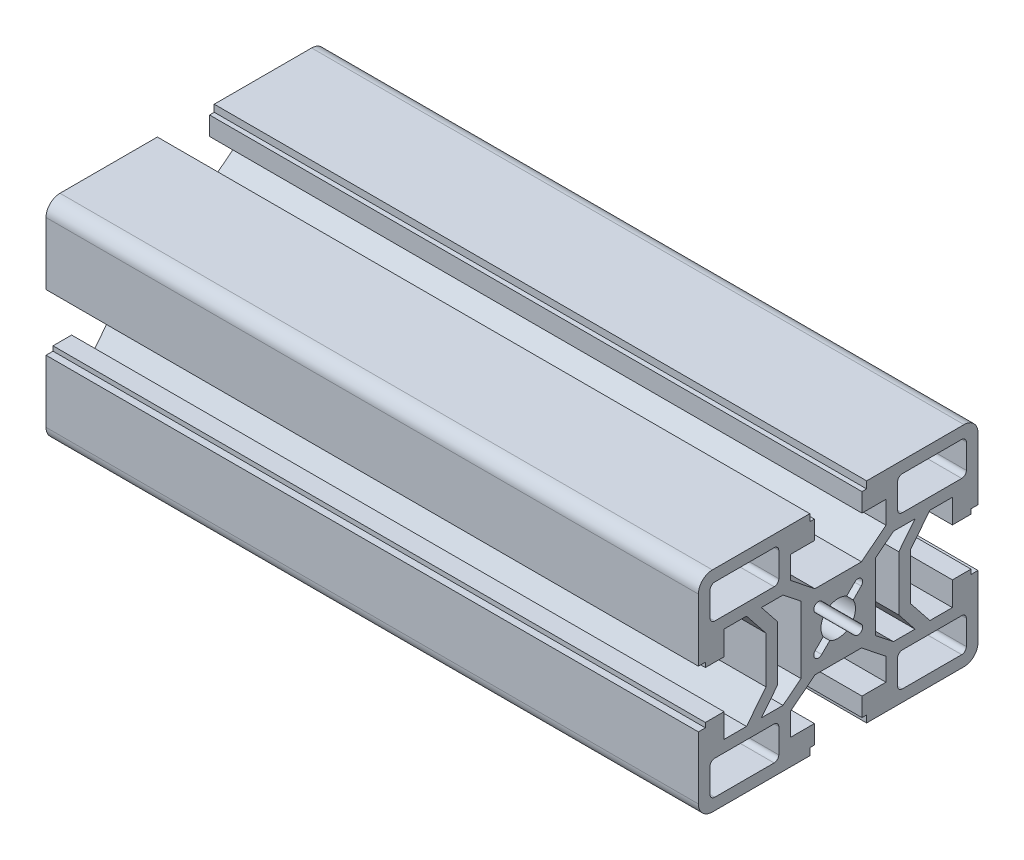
ISO-10303-21;
HEADER;
FILE_DESCRIPTION(('STEP AP214'),'2;1');
FILE_NAME('part.step','',(''),(''),'','','');
FILE_SCHEMA(('AUTOMOTIVE_DESIGN { 1 0 10303 214 1 1 1 1 }'));
ENDSEC;
DATA;
#1=APPLICATION_CONTEXT('core data for automotive mechanical design processes');
#2=APPLICATION_PROTOCOL_DEFINITION('international standard','automotive_design',2000,#1);
#3=PRODUCT_CONTEXT('',#1,'mechanical');
#4=PRODUCT('Part','Part','',(#3));
#5=PRODUCT_RELATED_PRODUCT_CATEGORY('part','',(#4));
#6=PRODUCT_DEFINITION_FORMATION('','',#4);
#7=PRODUCT_DEFINITION_CONTEXT('part definition',#1,'design');
#8=PRODUCT_DEFINITION('design','',#6,#7);
#9=PRODUCT_DEFINITION_SHAPE('','',#8);
#10=(LENGTH_UNIT() NAMED_UNIT(*) SI_UNIT(.MILLI.,.METRE.));
#11=(NAMED_UNIT(*) PLANE_ANGLE_UNIT() SI_UNIT($,.RADIAN.));
#12=(NAMED_UNIT(*) SI_UNIT($,.STERADIAN.) SOLID_ANGLE_UNIT());
#13=UNCERTAINTY_MEASURE_WITH_UNIT(LENGTH_MEASURE(1.E-05),#10,'distance_accuracy_value','');
#14=(GEOMETRIC_REPRESENTATION_CONTEXT(3) GLOBAL_UNCERTAINTY_ASSIGNED_CONTEXT((#13)) GLOBAL_UNIT_ASSIGNED_CONTEXT((#10,
#11,#12)) REPRESENTATION_CONTEXT('',''));
#15=CARTESIAN_POINT('',(0.,0.,0.));
#16=DIRECTION('',(0.,0.,1.));
#17=DIRECTION('',(1.,0.,0.));
#18=AXIS2_PLACEMENT_3D('',#15,#16,#17);
#19=CARTESIAN_POINT('',(140.,-19.5,-27.));
#20=DIRECTION('',(-1.,0.,0.));
#21=DIRECTION('',(0.,0.,1.));
#22=AXIS2_PLACEMENT_3D('',#19,#20,#21);
#23=PLANE('',#22);
#24=DIRECTION('',(0.,0.782608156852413,0.622514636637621));
#25=VECTOR('',#24,1.);
#26=CARTESIAN_POINT('',(140.,-5.87303908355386,-13.));
#27=LINE('',#26,#25);
#28=CARTESIAN_POINT('',(140.,-10.25,-16.4815919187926));
#29=VERTEX_POINT('',#28);
#30=CARTESIAN_POINT('',(140.,-5.87303908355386,-13.));
#31=VERTEX_POINT('',#30);
#32=EDGE_CURVE('E939',#29,#31,#27,.T.);
#33=ORIENTED_EDGE('',*,*,#32,.F.);
#34=DIRECTION('',(0.,0.,-1.));
#35=VECTOR('',#34,1.);
#36=CARTESIAN_POINT('',(140.,-10.25,-16.4815919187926));
#37=LINE('',#36,#35);
#38=CARTESIAN_POINT('',(140.,-10.25,-11.8446075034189));
#39=VERTEX_POINT('',#38);
#40=EDGE_CURVE('E955',#39,#29,#37,.T.);
#41=ORIENTED_EDGE('',*,*,#40,.F.);
#42=DIRECTION('',(0.,-0.62251463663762,-0.782608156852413));
#43=VECTOR('',#42,1.);
#44=CARTESIAN_POINT('',(140.,-10.25,-11.8446075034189));
#45=LINE('',#44,#43);
#46=CARTESIAN_POINT('',(140.,-7.19186110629,-8.00000000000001));
#47=VERTEX_POINT('',#46);
#48=EDGE_CURVE('E952',#47,#39,#45,.T.);
#49=ORIENTED_EDGE('',*,*,#48,.F.);
#50=DIRECTION('',(0.,-1.,0.));
#51=VECTOR('',#50,1.);
#52=CARTESIAN_POINT('',(140.,7.19186110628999,-8.00000000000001));
#53=LINE('',#52,#51);
#54=CARTESIAN_POINT('',(140.,7.19186110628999,-8.00000000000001));
#55=VERTEX_POINT('',#54);
#56=EDGE_CURVE('E950',#55,#47,#53,.T.);
#57=ORIENTED_EDGE('',*,*,#56,.F.);
#58=DIRECTION('',(0.,-0.62251463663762,0.782608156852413));
#59=VECTOR('',#58,1.);
#60=CARTESIAN_POINT('',(140.,10.25,-11.8446075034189));
#61=LINE('',#60,#59);
#62=CARTESIAN_POINT('',(140.,10.25,-11.8446075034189));
#63=VERTEX_POINT('',#62);
#64=EDGE_CURVE('E948',#63,#55,#61,.T.);
#65=ORIENTED_EDGE('',*,*,#64,.F.);
#66=DIRECTION('',(0.,0.,1.));
#67=VECTOR('',#66,1.);
#68=CARTESIAN_POINT('',(140.,10.25,-16.4815919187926));
#69=LINE('',#68,#67);
#70=CARTESIAN_POINT('',(140.,10.25,-16.4815919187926));
#71=VERTEX_POINT('',#70);
#72=EDGE_CURVE('E946',#71,#63,#69,.T.);
#73=ORIENTED_EDGE('',*,*,#72,.F.);
#74=DIRECTION('',(0.,0.782608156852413,-0.622514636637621));
#75=VECTOR('',#74,1.);
#76=CARTESIAN_POINT('',(140.,5.87303908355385,-13.));
#77=LINE('',#76,#75);
#78=CARTESIAN_POINT('',(140.,5.87303908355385,-13.));
#79=VERTEX_POINT('',#78);
#80=EDGE_CURVE('E944',#79,#71,#77,.T.);
#81=ORIENTED_EDGE('',*,*,#80,.F.);
#82=DIRECTION('',(0.,1.,0.));
#83=VECTOR('',#82,1.);
#84=CARTESIAN_POINT('',(140.,-5.87303908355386,-13.));
#85=LINE('',#84,#83);
#86=EDGE_CURVE('E941',#31,#79,#85,.T.);
#87=ORIENTED_EDGE('',*,*,#86,.F.);
#88=EDGE_LOOP('',(#33,#41,#49,#57,#65,#73,#81,#87));
#89=FACE_BOUND('',#88,.T.);
#90=CARTESIAN_POINT('',(140.,-13.75,-26.5));
#91=DIRECTION('',(1.,0.,0.));
#92=DIRECTION('',(0.,0.,-1.));
#93=AXIS2_PLACEMENT_3D('',#90,#91,#92);
#94=CIRCLE('',#93,1.);
#95=CARTESIAN_POINT('',(140.,-13.75,-27.5));
#96=VERTEX_POINT('',#95);
#97=CARTESIAN_POINT('',(140.,-12.75,-26.5));
#98=VERTEX_POINT('',#97);
#99=EDGE_CURVE('E1057',#96,#98,#94,.T.);
#100=ORIENTED_EDGE('',*,*,#99,.F.);
#101=DIRECTION('',(0.,1.,0.));
#102=VECTOR('',#101,1.);
#103=CARTESIAN_POINT('',(140.,-19.,-27.5));
#104=LINE('',#103,#102);
#105=CARTESIAN_POINT('',(140.,-19.,-27.5));
#106=VERTEX_POINT('',#105);
#107=EDGE_CURVE('E1073',#106,#96,#104,.T.);
#108=ORIENTED_EDGE('',*,*,#107,.F.);
#109=CARTESIAN_POINT('',(140.,-19.,-26.5));
#110=DIRECTION('',(1.,0.,0.));
#111=DIRECTION('',(0.,0.,-1.));
#112=AXIS2_PLACEMENT_3D('',#109,#110,#111);
#113=CIRCLE('',#112,0.999999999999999);
#114=CARTESIAN_POINT('',(140.,-20.,-26.5));
#115=VERTEX_POINT('',#114);
#116=EDGE_CURVE('E1070',#115,#106,#113,.T.);
#117=ORIENTED_EDGE('',*,*,#116,.F.);
#118=DIRECTION('',(0.,0.,-1.));
#119=VECTOR('',#118,1.);
#120=CARTESIAN_POINT('',(140.,-20.,-26.5));
#121=LINE('',#120,#119);
#122=CARTESIAN_POINT('',(140.,-20.,-13.75));
#123=VERTEX_POINT('',#122);
#124=EDGE_CURVE('E1068',#123,#115,#121,.T.);
#125=ORIENTED_EDGE('',*,*,#124,.F.);
#126=CARTESIAN_POINT('',(140.,-19.,-13.75));
#127=DIRECTION('',(1.,0.,0.));
#128=DIRECTION('',(0.,0.,1.));
#129=AXIS2_PLACEMENT_3D('',#126,#127,#128);
#130=CIRCLE('',#129,1.);
#131=CARTESIAN_POINT('',(140.,-19.,-12.75));
#132=VERTEX_POINT('',#131);
#133=EDGE_CURVE('E1066',#132,#123,#130,.T.);
#134=ORIENTED_EDGE('',*,*,#133,.F.);
#135=DIRECTION('',(0.,-1.,0.));
#136=VECTOR('',#135,1.);
#137=CARTESIAN_POINT('',(140.,-19.,-12.75));
#138=LINE('',#137,#136);
#139=CARTESIAN_POINT('',(140.,-13.75,-12.75));
#140=VERTEX_POINT('',#139);
#141=EDGE_CURVE('E1064',#140,#132,#138,.T.);
#142=ORIENTED_EDGE('',*,*,#141,.F.);
#143=CARTESIAN_POINT('',(140.,-13.75,-13.75));
#144=DIRECTION('',(1.,0.,0.));
#145=DIRECTION('',(0.,0.,-1.));
#146=AXIS2_PLACEMENT_3D('',#143,#144,#145);
#147=CIRCLE('',#146,1.);
#148=CARTESIAN_POINT('',(140.,-12.75,-13.75));
#149=VERTEX_POINT('',#148);
#150=EDGE_CURVE('E1062',#149,#140,#147,.T.);
#151=ORIENTED_EDGE('',*,*,#150,.F.);
#152=DIRECTION('',(0.,0.,1.));
#153=VECTOR('',#152,1.);
#154=CARTESIAN_POINT('',(140.,-12.75,-26.5));
#155=LINE('',#154,#153);
#156=EDGE_CURVE('E1059',#98,#149,#155,.T.);
#157=ORIENTED_EDGE('',*,*,#156,.F.);
#158=EDGE_LOOP('',(#100,#108,#117,#125,#134,#142,#151,#157));
#159=FACE_BOUND('',#158,.T.);
#160=CARTESIAN_POINT('',(140.,19.,13.75));
#161=DIRECTION('',(1.,0.,0.));
#162=DIRECTION('',(0.,0.,1.));
#163=AXIS2_PLACEMENT_3D('',#160,#161,#162);
#164=CIRCLE('',#163,1.);
#165=CARTESIAN_POINT('',(140.,19.,12.75));
#166=VERTEX_POINT('',#165);
#167=CARTESIAN_POINT('',(140.,20.,13.75));
#168=VERTEX_POINT('',#167);
#169=EDGE_CURVE('E1175',#166,#168,#164,.T.);
#170=ORIENTED_EDGE('',*,*,#169,.F.);
#171=DIRECTION('',(0.,1.,0.));
#172=VECTOR('',#171,1.);
#173=CARTESIAN_POINT('',(140.,19.,12.75));
#174=LINE('',#173,#172);
#175=CARTESIAN_POINT('',(140.,13.75,12.75));
#176=VERTEX_POINT('',#175);
#177=EDGE_CURVE('E1191',#176,#166,#174,.T.);
#178=ORIENTED_EDGE('',*,*,#177,.F.);
#179=CARTESIAN_POINT('',(140.,13.75,13.75));
#180=DIRECTION('',(1.,0.,0.));
#181=DIRECTION('',(0.,0.,-1.));
#182=AXIS2_PLACEMENT_3D('',#179,#180,#181);
#183=CIRCLE('',#182,1.);
#184=CARTESIAN_POINT('',(140.,12.75,13.75));
#185=VERTEX_POINT('',#184);
#186=EDGE_CURVE('E1188',#185,#176,#183,.T.);
#187=ORIENTED_EDGE('',*,*,#186,.F.);
#188=DIRECTION('',(0.,0.,-1.));
#189=VECTOR('',#188,1.);
#190=CARTESIAN_POINT('',(140.,12.75,26.5));
#191=LINE('',#190,#189);
#192=CARTESIAN_POINT('',(140.,12.75,26.5));
#193=VERTEX_POINT('',#192);
#194=EDGE_CURVE('E1186',#193,#185,#191,.T.);
#195=ORIENTED_EDGE('',*,*,#194,.F.);
#196=CARTESIAN_POINT('',(140.,13.75,26.5));
#197=DIRECTION('',(1.,0.,0.));
#198=DIRECTION('',(0.,0.,-1.));
#199=AXIS2_PLACEMENT_3D('',#196,#197,#198);
#200=CIRCLE('',#199,1.);
#201=CARTESIAN_POINT('',(140.,13.75,27.5));
#202=VERTEX_POINT('',#201);
#203=EDGE_CURVE('E1184',#202,#193,#200,.T.);
#204=ORIENTED_EDGE('',*,*,#203,.F.);
#205=DIRECTION('',(0.,-1.,0.));
#206=VECTOR('',#205,1.);
#207=CARTESIAN_POINT('',(140.,19.,27.5));
#208=LINE('',#207,#206);
#209=CARTESIAN_POINT('',(140.,19.,27.5));
#210=VERTEX_POINT('',#209);
#211=EDGE_CURVE('E1182',#210,#202,#208,.T.);
#212=ORIENTED_EDGE('',*,*,#211,.F.);
#213=CARTESIAN_POINT('',(140.,19.,26.5));
#214=DIRECTION('',(1.,0.,0.));
#215=DIRECTION('',(0.,0.,-1.));
#216=AXIS2_PLACEMENT_3D('',#213,#214,#215);
#217=CIRCLE('',#216,0.999999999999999);
#218=CARTESIAN_POINT('',(140.,20.,26.5));
#219=VERTEX_POINT('',#218);
#220=EDGE_CURVE('E1180',#219,#210,#217,.T.);
#221=ORIENTED_EDGE('',*,*,#220,.F.);
#222=DIRECTION('',(0.,0.,1.));
#223=VECTOR('',#222,1.);
#224=CARTESIAN_POINT('',(140.,20.,26.5));
#225=LINE('',#224,#223);
#226=EDGE_CURVE('E1177',#168,#219,#225,.T.);
#227=ORIENTED_EDGE('',*,*,#226,.F.);
#228=EDGE_LOOP('',(#170,#178,#187,#195,#204,#212,#221,#227));
#229=FACE_BOUND('',#228,.T.);
#230=DIRECTION('',(0.,0.62251463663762,-0.782608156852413));
#231=VECTOR('',#230,1.);
#232=CARTESIAN_POINT('',(140.,-12.1760385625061,10.25));
#233=LINE('',#232,#231);
#234=CARTESIAN_POINT('',(140.,-12.1760385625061,10.25));
#235=VERTEX_POINT('',#234);
#236=CARTESIAN_POINT('',(140.,-8.00000000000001,5.));
#237=VERTEX_POINT('',#236);
#238=EDGE_CURVE('E1293',#235,#237,#233,.T.);
#239=ORIENTED_EDGE('',*,*,#238,.T.);
#240=DIRECTION('',(0.,0.,-1.));
#241=VECTOR('',#240,1.);
#242=CARTESIAN_POINT('',(140.,-8.00000000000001,5.));
#243=LINE('',#242,#241);
#244=CARTESIAN_POINT('',(140.,-8.00000000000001,-5.00000000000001));
#245=VERTEX_POINT('',#244);
#246=EDGE_CURVE('E1296',#237,#245,#243,.T.);
#247=ORIENTED_EDGE('',*,*,#246,.T.);
#248=DIRECTION('',(0.,-0.62251463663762,-0.782608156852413));
#249=VECTOR('',#248,1.);
#250=CARTESIAN_POINT('',(140.,-12.1760385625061,-10.25));
#251=LINE('',#250,#249);
#252=CARTESIAN_POINT('',(140.,-12.1760385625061,-10.25));
#253=VERTEX_POINT('',#252);
#254=EDGE_CURVE('E1299',#245,#253,#251,.T.);
#255=ORIENTED_EDGE('',*,*,#254,.T.);
#256=DIRECTION('',(0.,-1.,0.));
#257=VECTOR('',#256,1.);
#258=CARTESIAN_POINT('',(140.,-17.,-10.25));
#259=LINE('',#258,#257);
#260=CARTESIAN_POINT('',(140.,-17.,-10.25));
#261=VERTEX_POINT('',#260);
#262=EDGE_CURVE('E1301',#253,#261,#259,.T.);
#263=ORIENTED_EDGE('',*,*,#262,.T.);
#264=DIRECTION('',(0.,0.,1.));
#265=VECTOR('',#264,1.);
#266=CARTESIAN_POINT('',(140.,-17.,-5.10000000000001));
#267=LINE('',#266,#265);
#268=CARTESIAN_POINT('',(140.,-17.,-5.10000000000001));
#269=VERTEX_POINT('',#268);
#270=EDGE_CURVE('E1303',#261,#269,#267,.T.);
#271=ORIENTED_EDGE('',*,*,#270,.T.);
#272=DIRECTION('',(0.,-1.,0.));
#273=VECTOR('',#272,1.);
#274=CARTESIAN_POINT('',(140.,-21.,-5.10000000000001));
#275=LINE('',#274,#273);
#276=CARTESIAN_POINT('',(140.,-21.,-5.10000000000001));
#277=VERTEX_POINT('',#276);
#278=EDGE_CURVE('E1305',#269,#277,#275,.T.);
#279=ORIENTED_EDGE('',*,*,#278,.T.);
#280=DIRECTION('',(0.,0.,-1.));
#281=VECTOR('',#280,1.);
#282=CARTESIAN_POINT('',(140.,-21.,-6.1));
#283=LINE('',#282,#281);
#284=CARTESIAN_POINT('',(140.,-21.,-6.1));
#285=VERTEX_POINT('',#284);
#286=EDGE_CURVE('E1307',#277,#285,#283,.T.);
#287=ORIENTED_EDGE('',*,*,#286,.T.);
#288=DIRECTION('',(0.,-1.,0.));
#289=VECTOR('',#288,1.);
#290=CARTESIAN_POINT('',(140.,-22.5,-6.1));
#291=LINE('',#290,#289);
#292=CARTESIAN_POINT('',(140.,-22.5,-6.1));
#293=VERTEX_POINT('',#292);
#294=EDGE_CURVE('E1309',#285,#293,#291,.T.);
#295=ORIENTED_EDGE('',*,*,#294,.T.);
#296=DIRECTION('',(0.,0.,-1.));
#297=VECTOR('',#296,1.);
#298=CARTESIAN_POINT('',(140.,-22.5,-27.));
#299=LINE('',#298,#297);
#300=CARTESIAN_POINT('',(140.,-22.5,-27.));
#301=VERTEX_POINT('',#300);
#302=EDGE_CURVE('E1311',#293,#301,#299,.T.);
#303=ORIENTED_EDGE('',*,*,#302,.T.);
#304=CARTESIAN_POINT('',(140.,-19.5,-27.));
#305=DIRECTION('',(1.,0.,0.));
#306=DIRECTION('',(0.,0.,1.));
#307=AXIS2_PLACEMENT_3D('',#304,#305,#306);
#308=CIRCLE('',#307,3.);
#309=CARTESIAN_POINT('',(140.,-19.5,-30.));
#310=VERTEX_POINT('',#309);
#311=EDGE_CURVE('E1313',#301,#310,#308,.T.);
#312=ORIENTED_EDGE('',*,*,#311,.T.);
#313=DIRECTION('',(0.,1.,0.));
#314=VECTOR('',#313,1.);
#315=CARTESIAN_POINT('',(140.,-6.10000000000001,-30.));
#316=LINE('',#315,#314);
#317=CARTESIAN_POINT('',(140.,-6.10000000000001,-30.));
#318=VERTEX_POINT('',#317);
#319=EDGE_CURVE('E1315',#310,#318,#316,.T.);
#320=ORIENTED_EDGE('',*,*,#319,.T.);
#321=DIRECTION('',(0.,0.,1.));
#322=VECTOR('',#321,1.);
#323=CARTESIAN_POINT('',(140.,-6.10000000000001,-30.));
#324=LINE('',#323,#322);
#325=CARTESIAN_POINT('',(140.,-6.10000000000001,-28.5));
#326=VERTEX_POINT('',#325);
#327=EDGE_CURVE('E1317',#318,#326,#324,.T.);
#328=ORIENTED_EDGE('',*,*,#327,.T.);
#329=DIRECTION('',(0.,1.,0.));
#330=VECTOR('',#329,1.);
#331=CARTESIAN_POINT('',(140.,-6.10000000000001,-28.5));
#332=LINE('',#331,#330);
#333=CARTESIAN_POINT('',(140.,-5.10000000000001,-28.5));
#334=VERTEX_POINT('',#333);
#335=EDGE_CURVE('E1319',#326,#334,#332,.T.);
#336=ORIENTED_EDGE('',*,*,#335,.T.);
#337=DIRECTION('',(0.,0.,1.));
#338=VECTOR('',#337,1.);
#339=CARTESIAN_POINT('',(140.,-5.10000000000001,-28.5));
#340=LINE('',#339,#338);
#341=CARTESIAN_POINT('',(140.,-5.10000000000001,-24.5));
#342=VERTEX_POINT('',#341);
#343=EDGE_CURVE('E1321',#334,#342,#340,.T.);
#344=ORIENTED_EDGE('',*,*,#343,.T.);
#345=DIRECTION('',(0.,-1.,0.));
#346=VECTOR('',#345,1.);
#347=CARTESIAN_POINT('',(140.,-5.10000000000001,-24.5));
#348=LINE('',#347,#346);
#349=CARTESIAN_POINT('',(140.,-10.25,-24.5));
#350=VERTEX_POINT('',#349);
#351=EDGE_CURVE('E1323',#342,#350,#348,.T.);
#352=ORIENTED_EDGE('',*,*,#351,.T.);
#353=DIRECTION('',(0.,0.,1.));
#354=VECTOR('',#353,1.);
#355=CARTESIAN_POINT('',(140.,-10.25,-24.5));
#356=LINE('',#355,#354);
#357=CARTESIAN_POINT('',(140.,-10.25,-19.6760385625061));
#358=VERTEX_POINT('',#357);
#359=EDGE_CURVE('E1325',#350,#358,#356,.T.);
#360=ORIENTED_EDGE('',*,*,#359,.T.);
#361=DIRECTION('',(0.,0.782608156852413,0.622514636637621));
#362=VECTOR('',#361,1.);
#363=CARTESIAN_POINT('',(140.,-10.25,-19.6760385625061));
#364=LINE('',#363,#362);
#365=CARTESIAN_POINT('',(140.,-5.00000000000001,-15.5));
#366=VERTEX_POINT('',#365);
#367=EDGE_CURVE('E1327',#358,#366,#364,.T.);
#368=ORIENTED_EDGE('',*,*,#367,.T.);
#369=DIRECTION('',(0.,1.,0.));
#370=VECTOR('',#369,1.);
#371=CARTESIAN_POINT('',(140.,5.,-15.5));
#372=LINE('',#371,#370);
#373=CARTESIAN_POINT('',(140.,5.,-15.5));
#374=VERTEX_POINT('',#373);
#375=EDGE_CURVE('E1329',#366,#374,#372,.T.);
#376=ORIENTED_EDGE('',*,*,#375,.T.);
#377=DIRECTION('',(0.,0.782608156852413,-0.622514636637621));
#378=VECTOR('',#377,1.);
#379=CARTESIAN_POINT('',(140.,10.25,-19.6760385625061));
#380=LINE('',#379,#378);
#381=CARTESIAN_POINT('',(140.,10.25,-19.6760385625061));
#382=VERTEX_POINT('',#381);
#383=EDGE_CURVE('E1331',#374,#382,#380,.T.);
#384=ORIENTED_EDGE('',*,*,#383,.T.);
#385=DIRECTION('',(0.,0.,-1.));
#386=VECTOR('',#385,1.);
#387=CARTESIAN_POINT('',(140.,10.25,-24.5));
#388=LINE('',#387,#386);
#389=CARTESIAN_POINT('',(140.,10.25,-24.5));
#390=VERTEX_POINT('',#389);
#391=EDGE_CURVE('E1333',#382,#390,#388,.T.);
#392=ORIENTED_EDGE('',*,*,#391,.T.);
#393=DIRECTION('',(0.,-1.,0.));
#394=VECTOR('',#393,1.);
#395=CARTESIAN_POINT('',(140.,5.1,-24.5));
#396=LINE('',#395,#394);
#397=CARTESIAN_POINT('',(140.,5.1,-24.5));
#398=VERTEX_POINT('',#397);
#399=EDGE_CURVE('E1335',#390,#398,#396,.T.);
#400=ORIENTED_EDGE('',*,*,#399,.T.);
#401=DIRECTION('',(0.,0.,-1.));
#402=VECTOR('',#401,1.);
#403=CARTESIAN_POINT('',(140.,5.1,-28.5));
#404=LINE('',#403,#402);
#405=CARTESIAN_POINT('',(140.,5.1,-28.5));
#406=VERTEX_POINT('',#405);
#407=EDGE_CURVE('E1337',#398,#406,#404,.T.);
#408=ORIENTED_EDGE('',*,*,#407,.T.);
#409=DIRECTION('',(0.,1.,0.));
#410=VECTOR('',#409,1.);
#411=CARTESIAN_POINT('',(140.,6.1,-28.5));
#412=LINE('',#411,#410);
#413=CARTESIAN_POINT('',(140.,6.1,-28.5));
#414=VERTEX_POINT('',#413);
#415=EDGE_CURVE('E1339',#406,#414,#412,.T.);
#416=ORIENTED_EDGE('',*,*,#415,.T.);
#417=DIRECTION('',(0.,0.,-1.));
#418=VECTOR('',#417,1.);
#419=CARTESIAN_POINT('',(140.,6.1,-30.));
#420=LINE('',#419,#418);
#421=CARTESIAN_POINT('',(140.,6.1,-30.));
#422=VERTEX_POINT('',#421);
#423=EDGE_CURVE('E1341',#414,#422,#420,.T.);
#424=ORIENTED_EDGE('',*,*,#423,.T.);
#425=DIRECTION('',(0.,1.,0.));
#426=VECTOR('',#425,1.);
#427=CARTESIAN_POINT('',(140.,6.1,-30.));
#428=LINE('',#427,#426);
#429=CARTESIAN_POINT('',(140.,19.5,-30.));
#430=VERTEX_POINT('',#429);
#431=EDGE_CURVE('E1343',#422,#430,#428,.T.);
#432=ORIENTED_EDGE('',*,*,#431,.T.);
#433=CARTESIAN_POINT('',(140.,19.5,-27.));
#434=DIRECTION('',(1.,0.,0.));
#435=DIRECTION('',(0.,0.,1.));
#436=AXIS2_PLACEMENT_3D('',#433,#434,#435);
#437=CIRCLE('',#436,3.);
#438=CARTESIAN_POINT('',(140.,22.5,-27.));
#439=VERTEX_POINT('',#438);
#440=EDGE_CURVE('E1345',#430,#439,#437,.T.);
#441=ORIENTED_EDGE('',*,*,#440,.T.);
#442=DIRECTION('',(0.,0.,1.));
#443=VECTOR('',#442,1.);
#444=CARTESIAN_POINT('',(140.,22.5,-27.));
#445=LINE('',#444,#443);
#446=CARTESIAN_POINT('',(140.,22.5,-6.1));
#447=VERTEX_POINT('',#446);
#448=EDGE_CURVE('E1347',#439,#447,#445,.T.);
#449=ORIENTED_EDGE('',*,*,#448,.T.);
#450=DIRECTION('',(0.,-1.,0.));
#451=VECTOR('',#450,1.);
#452=CARTESIAN_POINT('',(140.,22.5,-6.1));
#453=LINE('',#452,#451);
#454=CARTESIAN_POINT('',(140.,21.,-6.1));
#455=VERTEX_POINT('',#454);
#456=EDGE_CURVE('E1349',#447,#455,#453,.T.);
#457=ORIENTED_EDGE('',*,*,#456,.T.);
#458=DIRECTION('',(0.,0.,1.));
#459=VECTOR('',#458,1.);
#460=CARTESIAN_POINT('',(140.,21.,-6.1));
#461=LINE('',#460,#459);
#462=CARTESIAN_POINT('',(140.,21.,-5.10000000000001));
#463=VERTEX_POINT('',#462);
#464=EDGE_CURVE('E1351',#455,#463,#461,.T.);
#465=ORIENTED_EDGE('',*,*,#464,.T.);
#466=DIRECTION('',(0.,-1.,0.));
#467=VECTOR('',#466,1.);
#468=CARTESIAN_POINT('',(140.,21.,-5.10000000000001));
#469=LINE('',#468,#467);
#470=CARTESIAN_POINT('',(140.,17.,-5.10000000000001));
#471=VERTEX_POINT('',#470);
#472=EDGE_CURVE('E1353',#463,#471,#469,.T.);
#473=ORIENTED_EDGE('',*,*,#472,.T.);
#474=DIRECTION('',(0.,0.,-1.));
#475=VECTOR('',#474,1.);
#476=CARTESIAN_POINT('',(140.,17.,-5.10000000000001));
#477=LINE('',#476,#475);
#478=CARTESIAN_POINT('',(140.,17.,-10.25));
#479=VERTEX_POINT('',#478);
#480=EDGE_CURVE('E1355',#471,#479,#477,.T.);
#481=ORIENTED_EDGE('',*,*,#480,.T.);
#482=DIRECTION('',(0.,-1.,0.));
#483=VECTOR('',#482,1.);
#484=CARTESIAN_POINT('',(140.,17.,-10.25));
#485=LINE('',#484,#483);
#486=CARTESIAN_POINT('',(140.,12.1760385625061,-10.25));
#487=VERTEX_POINT('',#486);
#488=EDGE_CURVE('E1357',#479,#487,#485,.T.);
#489=ORIENTED_EDGE('',*,*,#488,.T.);
#490=DIRECTION('',(0.,-0.622514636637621,0.782608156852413));
#491=VECTOR('',#490,1.);
#492=CARTESIAN_POINT('',(140.,12.1760385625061,-10.25));
#493=LINE('',#492,#491);
#494=CARTESIAN_POINT('',(140.,7.99999999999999,-5.00000000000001));
#495=VERTEX_POINT('',#494);
#496=EDGE_CURVE('E1359',#487,#495,#493,.T.);
#497=ORIENTED_EDGE('',*,*,#496,.T.);
#498=DIRECTION('',(0.,0.,1.));
#499=VECTOR('',#498,1.);
#500=CARTESIAN_POINT('',(140.,7.99999999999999,5.));
#501=LINE('',#500,#499);
#502=CARTESIAN_POINT('',(140.,7.99999999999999,5.));
#503=VERTEX_POINT('',#502);
#504=EDGE_CURVE('E1361',#495,#503,#501,.T.);
#505=ORIENTED_EDGE('',*,*,#504,.T.);
#506=DIRECTION('',(0.,0.622514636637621,0.782608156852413));
#507=VECTOR('',#506,1.);
#508=CARTESIAN_POINT('',(140.,12.1760385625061,10.25));
#509=LINE('',#508,#507);
#510=CARTESIAN_POINT('',(140.,12.1760385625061,10.25));
#511=VERTEX_POINT('',#510);
#512=EDGE_CURVE('E1363',#503,#511,#509,.T.);
#513=ORIENTED_EDGE('',*,*,#512,.T.);
#514=DIRECTION('',(0.,1.,0.));
#515=VECTOR('',#514,1.);
#516=CARTESIAN_POINT('',(140.,17.,10.25));
#517=LINE('',#516,#515);
#518=CARTESIAN_POINT('',(140.,17.,10.25));
#519=VERTEX_POINT('',#518);
#520=EDGE_CURVE('E1365',#511,#519,#517,.T.);
#521=ORIENTED_EDGE('',*,*,#520,.T.);
#522=DIRECTION('',(0.,0.,-1.));
#523=VECTOR('',#522,1.);
#524=CARTESIAN_POINT('',(140.,17.,5.1));
#525=LINE('',#524,#523);
#526=CARTESIAN_POINT('',(140.,17.,5.1));
#527=VERTEX_POINT('',#526);
#528=EDGE_CURVE('E1367',#519,#527,#525,.T.);
#529=ORIENTED_EDGE('',*,*,#528,.T.);
#530=DIRECTION('',(0.,1.,0.));
#531=VECTOR('',#530,1.);
#532=CARTESIAN_POINT('',(140.,21.,5.1));
#533=LINE('',#532,#531);
#534=CARTESIAN_POINT('',(140.,21.,5.1));
#535=VERTEX_POINT('',#534);
#536=EDGE_CURVE('E1369',#527,#535,#533,.T.);
#537=ORIENTED_EDGE('',*,*,#536,.T.);
#538=DIRECTION('',(0.,0.,1.));
#539=VECTOR('',#538,1.);
#540=CARTESIAN_POINT('',(140.,21.,6.1));
#541=LINE('',#540,#539);
#542=CARTESIAN_POINT('',(140.,21.,6.1));
#543=VERTEX_POINT('',#542);
#544=EDGE_CURVE('E1371',#535,#543,#541,.T.);
#545=ORIENTED_EDGE('',*,*,#544,.T.);
#546=DIRECTION('',(0.,1.,0.));
#547=VECTOR('',#546,1.);
#548=CARTESIAN_POINT('',(140.,22.5,6.1));
#549=LINE('',#548,#547);
#550=CARTESIAN_POINT('',(140.,22.5,6.1));
#551=VERTEX_POINT('',#550);
#552=EDGE_CURVE('E1373',#543,#551,#549,.T.);
#553=ORIENTED_EDGE('',*,*,#552,.T.);
#554=DIRECTION('',(0.,0.,1.));
#555=VECTOR('',#554,1.);
#556=CARTESIAN_POINT('',(140.,22.5,27.));
#557=LINE('',#556,#555);
#558=CARTESIAN_POINT('',(140.,22.5,27.));
#559=VERTEX_POINT('',#558);
#560=EDGE_CURVE('E1375',#551,#559,#557,.T.);
#561=ORIENTED_EDGE('',*,*,#560,.T.);
#562=CARTESIAN_POINT('',(140.,19.5,27.));
#563=DIRECTION('',(1.,0.,0.));
#564=DIRECTION('',(0.,0.,-1.));
#565=AXIS2_PLACEMENT_3D('',#562,#563,#564);
#566=CIRCLE('',#565,3.);
#567=CARTESIAN_POINT('',(140.,19.5,30.));
#568=VERTEX_POINT('',#567);
#569=EDGE_CURVE('E1377',#559,#568,#566,.T.);
#570=ORIENTED_EDGE('',*,*,#569,.T.);
#571=DIRECTION('',(0.,-1.,0.));
#572=VECTOR('',#571,1.);
#573=CARTESIAN_POINT('',(140.,6.1,30.));
#574=LINE('',#573,#572);
#575=CARTESIAN_POINT('',(140.,6.1,30.));
#576=VERTEX_POINT('',#575);
#577=EDGE_CURVE('E1379',#568,#576,#574,.T.);
#578=ORIENTED_EDGE('',*,*,#577,.T.);
#579=DIRECTION('',(0.,0.,-1.));
#580=VECTOR('',#579,1.);
#581=CARTESIAN_POINT('',(140.,6.1,30.));
#582=LINE('',#581,#580);
#583=CARTESIAN_POINT('',(140.,6.1,28.5));
#584=VERTEX_POINT('',#583);
#585=EDGE_CURVE('E1381',#576,#584,#582,.T.);
#586=ORIENTED_EDGE('',*,*,#585,.T.);
#587=DIRECTION('',(0.,-1.,0.));
#588=VECTOR('',#587,1.);
#589=CARTESIAN_POINT('',(140.,6.1,28.5));
#590=LINE('',#589,#588);
#591=CARTESIAN_POINT('',(140.,5.1,28.5));
#592=VERTEX_POINT('',#591);
#593=EDGE_CURVE('E1383',#584,#592,#590,.T.);
#594=ORIENTED_EDGE('',*,*,#593,.T.);
#595=DIRECTION('',(0.,0.,-1.));
#596=VECTOR('',#595,1.);
#597=CARTESIAN_POINT('',(140.,5.1,28.5));
#598=LINE('',#597,#596);
#599=CARTESIAN_POINT('',(140.,5.1,24.5));
#600=VERTEX_POINT('',#599);
#601=EDGE_CURVE('E1385',#592,#600,#598,.T.);
#602=ORIENTED_EDGE('',*,*,#601,.T.);
#603=DIRECTION('',(0.,1.,0.));
#604=VECTOR('',#603,1.);
#605=CARTESIAN_POINT('',(140.,5.1,24.5));
#606=LINE('',#605,#604);
#607=CARTESIAN_POINT('',(140.,10.25,24.5));
#608=VERTEX_POINT('',#607);
#609=EDGE_CURVE('E1387',#600,#608,#606,.T.);
#610=ORIENTED_EDGE('',*,*,#609,.T.);
#611=DIRECTION('',(0.,0.,-1.));
#612=VECTOR('',#611,1.);
#613=CARTESIAN_POINT('',(140.,10.25,24.5));
#614=LINE('',#613,#612);
#615=CARTESIAN_POINT('',(140.,10.25,19.6760385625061));
#616=VERTEX_POINT('',#615);
#617=EDGE_CURVE('E1389',#608,#616,#614,.T.);
#618=ORIENTED_EDGE('',*,*,#617,.T.);
#619=DIRECTION('',(0.,-0.782608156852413,-0.622514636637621));
#620=VECTOR('',#619,1.);
#621=CARTESIAN_POINT('',(140.,10.25,19.6760385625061));
#622=LINE('',#621,#620);
#623=CARTESIAN_POINT('',(140.,5.,15.5));
#624=VERTEX_POINT('',#623);
#625=EDGE_CURVE('E1391',#616,#624,#622,.T.);
#626=ORIENTED_EDGE('',*,*,#625,.T.);
#627=DIRECTION('',(0.,-1.,0.));
#628=VECTOR('',#627,1.);
#629=CARTESIAN_POINT('',(140.,5.,15.5));
#630=LINE('',#629,#628);
#631=CARTESIAN_POINT('',(140.,-5.00000000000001,15.5));
#632=VERTEX_POINT('',#631);
#633=EDGE_CURVE('E1393',#624,#632,#630,.T.);
#634=ORIENTED_EDGE('',*,*,#633,.T.);
#635=DIRECTION('',(0.,-0.782608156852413,0.622514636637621));
#636=VECTOR('',#635,1.);
#637=CARTESIAN_POINT('',(140.,-10.25,19.6760385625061));
#638=LINE('',#637,#636);
#639=CARTESIAN_POINT('',(140.,-10.25,19.6760385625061));
#640=VERTEX_POINT('',#639);
#641=EDGE_CURVE('E1395',#632,#640,#638,.T.);
#642=ORIENTED_EDGE('',*,*,#641,.T.);
#643=DIRECTION('',(0.,0.,1.));
#644=VECTOR('',#643,1.);
#645=CARTESIAN_POINT('',(140.,-10.25,24.5));
#646=LINE('',#645,#644);
#647=CARTESIAN_POINT('',(140.,-10.25,24.5));
#648=VERTEX_POINT('',#647);
#649=EDGE_CURVE('E1397',#640,#648,#646,.T.);
#650=ORIENTED_EDGE('',*,*,#649,.T.);
#651=DIRECTION('',(0.,1.,0.));
#652=VECTOR('',#651,1.);
#653=CARTESIAN_POINT('',(140.,-5.10000000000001,24.5));
#654=LINE('',#653,#652);
#655=CARTESIAN_POINT('',(140.,-5.10000000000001,24.5));
#656=VERTEX_POINT('',#655);
#657=EDGE_CURVE('E1399',#648,#656,#654,.T.);
#658=ORIENTED_EDGE('',*,*,#657,.T.);
#659=DIRECTION('',(0.,0.,1.));
#660=VECTOR('',#659,1.);
#661=CARTESIAN_POINT('',(140.,-5.10000000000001,28.5));
#662=LINE('',#661,#660);
#663=CARTESIAN_POINT('',(140.,-5.10000000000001,28.5));
#664=VERTEX_POINT('',#663);
#665=EDGE_CURVE('E1401',#656,#664,#662,.T.);
#666=ORIENTED_EDGE('',*,*,#665,.T.);
#667=DIRECTION('',(0.,-1.,0.));
#668=VECTOR('',#667,1.);
#669=CARTESIAN_POINT('',(140.,-6.10000000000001,28.5));
#670=LINE('',#669,#668);
#671=CARTESIAN_POINT('',(140.,-6.10000000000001,28.5));
#672=VERTEX_POINT('',#671);
#673=EDGE_CURVE('E1403',#664,#672,#670,.T.);
#674=ORIENTED_EDGE('',*,*,#673,.T.);
#675=DIRECTION('',(0.,0.,1.));
#676=VECTOR('',#675,1.);
#677=CARTESIAN_POINT('',(140.,-6.10000000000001,30.));
#678=LINE('',#677,#676);
#679=CARTESIAN_POINT('',(140.,-6.10000000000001,30.));
#680=VERTEX_POINT('',#679);
#681=EDGE_CURVE('E1405',#672,#680,#678,.T.);
#682=ORIENTED_EDGE('',*,*,#681,.T.);
#683=DIRECTION('',(0.,-1.,0.));
#684=VECTOR('',#683,1.);
#685=CARTESIAN_POINT('',(140.,-6.10000000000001,30.));
#686=LINE('',#685,#684);
#687=CARTESIAN_POINT('',(140.,-19.5,30.));
#688=VERTEX_POINT('',#687);
#689=EDGE_CURVE('E1407',#680,#688,#686,.T.);
#690=ORIENTED_EDGE('',*,*,#689,.T.);
#691=CARTESIAN_POINT('',(140.,-19.5,27.));
#692=DIRECTION('',(1.,0.,0.));
#693=DIRECTION('',(0.,0.,1.));
#694=AXIS2_PLACEMENT_3D('',#691,#692,#693);
#695=CIRCLE('',#694,3.);
#696=CARTESIAN_POINT('',(140.,-22.5,27.));
#697=VERTEX_POINT('',#696);
#698=EDGE_CURVE('E1409',#688,#697,#695,.T.);
#699=ORIENTED_EDGE('',*,*,#698,.T.);
#700=DIRECTION('',(0.,0.,-1.));
#701=VECTOR('',#700,1.);
#702=CARTESIAN_POINT('',(140.,-22.5,27.));
#703=LINE('',#702,#701);
#704=CARTESIAN_POINT('',(140.,-22.5,6.1));
#705=VERTEX_POINT('',#704);
#706=EDGE_CURVE('E1411',#697,#705,#703,.T.);
#707=ORIENTED_EDGE('',*,*,#706,.T.);
#708=DIRECTION('',(0.,1.,0.));
#709=VECTOR('',#708,1.);
#710=CARTESIAN_POINT('',(140.,-22.5,6.1));
#711=LINE('',#710,#709);
#712=CARTESIAN_POINT('',(140.,-21.,6.1));
#713=VERTEX_POINT('',#712);
#714=EDGE_CURVE('E1413',#705,#713,#711,.T.);
#715=ORIENTED_EDGE('',*,*,#714,.T.);
#716=DIRECTION('',(0.,0.,-1.));
#717=VECTOR('',#716,1.);
#718=CARTESIAN_POINT('',(140.,-21.,6.1));
#719=LINE('',#718,#717);
#720=CARTESIAN_POINT('',(140.,-21.,5.1));
#721=VERTEX_POINT('',#720);
#722=EDGE_CURVE('E1415',#713,#721,#719,.T.);
#723=ORIENTED_EDGE('',*,*,#722,.T.);
#724=DIRECTION('',(0.,1.,0.));
#725=VECTOR('',#724,1.);
#726=CARTESIAN_POINT('',(140.,-21.,5.1));
#727=LINE('',#726,#725);
#728=CARTESIAN_POINT('',(140.,-17.,5.1));
#729=VERTEX_POINT('',#728);
#730=EDGE_CURVE('E1417',#721,#729,#727,.T.);
#731=ORIENTED_EDGE('',*,*,#730,.T.);
#732=DIRECTION('',(0.,0.,1.));
#733=VECTOR('',#732,1.);
#734=CARTESIAN_POINT('',(140.,-17.,5.1));
#735=LINE('',#734,#733);
#736=CARTESIAN_POINT('',(140.,-17.,10.25));
#737=VERTEX_POINT('',#736);
#738=EDGE_CURVE('E1419',#729,#737,#735,.T.);
#739=ORIENTED_EDGE('',*,*,#738,.T.);
#740=DIRECTION('',(0.,1.,0.));
#741=VECTOR('',#740,1.);
#742=CARTESIAN_POINT('',(140.,-17.,10.25));
#743=LINE('',#742,#741);
#744=EDGE_CURVE('E1421',#737,#235,#743,.T.);
#745=ORIENTED_EDGE('',*,*,#744,.T.);
#746=EDGE_LOOP('',(#239,#247,#255,#263,#271,#279,#287,#295,#303,#312,#320,#328,#336,#344,#352,
#360,#368,#376,#384,#392,#400,#408,#416,#424,#432,#441,#449,#457,#465,#473,#481,#489,#497,#505,
#513,#521,#529,#537,#545,#553,#561,#570,#578,#586,#594,#602,#610,#618,#626,#634,#642,#650,#658,
#666,#674,#682,#690,#699,#707,#715,#723,#731,#739,#745));
#747=FACE_BOUND('',#746,.T.);
#748=DIRECTION('',(0.,-0.782608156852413,-0.62251463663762));
#749=VECTOR('',#748,1.);
#750=CARTESIAN_POINT('',(140.,5.87303908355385,13.));
#751=LINE('',#750,#749);
#752=CARTESIAN_POINT('',(140.,10.25,16.4815919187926));
#753=VERTEX_POINT('',#752);
#754=CARTESIAN_POINT('',(140.,5.87303908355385,13.));
#755=VERTEX_POINT('',#754);
#756=EDGE_CURVE('E1234',#753,#755,#751,.T.);
#757=ORIENTED_EDGE('',*,*,#756,.F.);
#758=DIRECTION('',(0.,0.,1.));
#759=VECTOR('',#758,1.);
#760=CARTESIAN_POINT('',(140.,10.25,16.4815919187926));
#761=LINE('',#760,#759);
#762=CARTESIAN_POINT('',(140.,10.25,11.8446075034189));
#763=VERTEX_POINT('',#762);
#764=EDGE_CURVE('E1250',#763,#753,#761,.T.);
#765=ORIENTED_EDGE('',*,*,#764,.F.);
#766=DIRECTION('',(0.,0.62251463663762,0.782608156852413));
#767=VECTOR('',#766,1.);
#768=CARTESIAN_POINT('',(140.,10.25,11.8446075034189));
#769=LINE('',#768,#767);
#770=CARTESIAN_POINT('',(140.,7.19186110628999,8.));
#771=VERTEX_POINT('',#770);
#772=EDGE_CURVE('E1247',#771,#763,#769,.T.);
#773=ORIENTED_EDGE('',*,*,#772,.F.);
#774=DIRECTION('',(0.,1.,0.));
#775=VECTOR('',#774,1.);
#776=CARTESIAN_POINT('',(140.,7.19186110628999,8.));
#777=LINE('',#776,#775);
#778=CARTESIAN_POINT('',(140.,-7.19186110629,8.));
#779=VERTEX_POINT('',#778);
#780=EDGE_CURVE('E1245',#779,#771,#777,.T.);
#781=ORIENTED_EDGE('',*,*,#780,.F.);
#782=DIRECTION('',(0.,0.62251463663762,-0.782608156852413));
#783=VECTOR('',#782,1.);
#784=CARTESIAN_POINT('',(140.,-10.25,11.8446075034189));
#785=LINE('',#784,#783);
#786=CARTESIAN_POINT('',(140.,-10.25,11.8446075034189));
#787=VERTEX_POINT('',#786);
#788=EDGE_CURVE('E1243',#787,#779,#785,.T.);
#789=ORIENTED_EDGE('',*,*,#788,.F.);
#790=DIRECTION('',(0.,0.,-1.));
#791=VECTOR('',#790,1.);
#792=CARTESIAN_POINT('',(140.,-10.25,16.4815919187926));
#793=LINE('',#792,#791);
#794=CARTESIAN_POINT('',(140.,-10.25,16.4815919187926));
#795=VERTEX_POINT('',#794);
#796=EDGE_CURVE('E1241',#795,#787,#793,.T.);
#797=ORIENTED_EDGE('',*,*,#796,.F.);
#798=DIRECTION('',(0.,-0.782608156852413,0.622514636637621));
#799=VECTOR('',#798,1.);
#800=CARTESIAN_POINT('',(140.,-5.87303908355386,13.));
#801=LINE('',#800,#799);
#802=CARTESIAN_POINT('',(140.,-5.87303908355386,13.));
#803=VERTEX_POINT('',#802);
#804=EDGE_CURVE('E1239',#803,#795,#801,.T.);
#805=ORIENTED_EDGE('',*,*,#804,.F.);
#806=DIRECTION('',(0.,-1.,0.));
#807=VECTOR('',#806,1.);
#808=CARTESIAN_POINT('',(140.,-5.87303908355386,13.));
#809=LINE('',#808,#807);
#810=EDGE_CURVE('E1236',#755,#803,#809,.T.);
#811=ORIENTED_EDGE('',*,*,#810,.F.);
#812=EDGE_LOOP('',(#757,#765,#773,#781,#789,#797,#805,#811));
#813=FACE_BOUND('',#812,.T.);
#814=CARTESIAN_POINT('',(140.,-13.75,26.5));
#815=DIRECTION('',(1.,0.,0.));
#816=DIRECTION('',(0.,0.,1.));
#817=AXIS2_PLACEMENT_3D('',#814,#815,#816);
#818=CIRCLE('',#817,1.);
#819=CARTESIAN_POINT('',(140.,-12.75,26.5));
#820=VERTEX_POINT('',#819);
#821=CARTESIAN_POINT('',(140.,-13.75,27.5));
#822=VERTEX_POINT('',#821);
#823=EDGE_CURVE('E1116',#820,#822,#818,.T.);
#824=ORIENTED_EDGE('',*,*,#823,.F.);
#825=DIRECTION('',(0.,0.,1.));
#826=VECTOR('',#825,1.);
#827=CARTESIAN_POINT('',(140.,-12.75,26.5));
#828=LINE('',#827,#826);
#829=CARTESIAN_POINT('',(140.,-12.75,13.75));
#830=VERTEX_POINT('',#829);
#831=EDGE_CURVE('E1132',#830,#820,#828,.T.);
#832=ORIENTED_EDGE('',*,*,#831,.F.);
#833=CARTESIAN_POINT('',(140.,-13.75,13.75));
#834=DIRECTION('',(1.,0.,0.));
#835=DIRECTION('',(0.,0.,1.));
#836=AXIS2_PLACEMENT_3D('',#833,#834,#835);
#837=CIRCLE('',#836,1.);
#838=CARTESIAN_POINT('',(140.,-13.75,12.75));
#839=VERTEX_POINT('',#838);
#840=EDGE_CURVE('E1129',#839,#830,#837,.T.);
#841=ORIENTED_EDGE('',*,*,#840,.F.);
#842=DIRECTION('',(0.,1.,0.));
#843=VECTOR('',#842,1.);
#844=CARTESIAN_POINT('',(140.,-19.,12.75));
#845=LINE('',#844,#843);
#846=CARTESIAN_POINT('',(140.,-19.,12.75));
#847=VERTEX_POINT('',#846);
#848=EDGE_CURVE('E1127',#847,#839,#845,.T.);
#849=ORIENTED_EDGE('',*,*,#848,.F.);
#850=CARTESIAN_POINT('',(140.,-19.,13.75));
#851=DIRECTION('',(1.,0.,0.));
#852=DIRECTION('',(0.,0.,-1.));
#853=AXIS2_PLACEMENT_3D('',#850,#851,#852);
#854=CIRCLE('',#853,1.);
#855=CARTESIAN_POINT('',(140.,-20.,13.75));
#856=VERTEX_POINT('',#855);
#857=EDGE_CURVE('E1125',#856,#847,#854,.T.);
#858=ORIENTED_EDGE('',*,*,#857,.F.);
#859=DIRECTION('',(0.,0.,-1.));
#860=VECTOR('',#859,1.);
#861=CARTESIAN_POINT('',(140.,-20.,26.5));
#862=LINE('',#861,#860);
#863=CARTESIAN_POINT('',(140.,-20.,26.5));
#864=VERTEX_POINT('',#863);
#865=EDGE_CURVE('E1123',#864,#856,#862,.T.);
#866=ORIENTED_EDGE('',*,*,#865,.F.);
#867=CARTESIAN_POINT('',(140.,-19.,26.5));
#868=DIRECTION('',(1.,0.,0.));
#869=DIRECTION('',(0.,0.,1.));
#870=AXIS2_PLACEMENT_3D('',#867,#868,#869);
#871=CIRCLE('',#870,0.999999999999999);
#872=CARTESIAN_POINT('',(140.,-19.,27.5));
#873=VERTEX_POINT('',#872);
#874=EDGE_CURVE('E1121',#873,#864,#871,.T.);
#875=ORIENTED_EDGE('',*,*,#874,.F.);
#876=DIRECTION('',(0.,-1.,0.));
#877=VECTOR('',#876,1.);
#878=CARTESIAN_POINT('',(140.,-19.,27.5));
#879=LINE('',#878,#877);
#880=EDGE_CURVE('E1118',#822,#873,#879,.T.);
#881=ORIENTED_EDGE('',*,*,#880,.F.);
#882=EDGE_LOOP('',(#824,#832,#841,#849,#858,#866,#875,#881));
#883=FACE_BOUND('',#882,.T.);
#884=CARTESIAN_POINT('',(140.,13.75,-26.5));
#885=DIRECTION('',(1.,0.,0.));
#886=DIRECTION('',(0.,0.,1.));
#887=AXIS2_PLACEMENT_3D('',#884,#885,#886);
#888=CIRCLE('',#887,1.);
#889=CARTESIAN_POINT('',(140.,12.75,-26.5));
#890=VERTEX_POINT('',#889);
#891=CARTESIAN_POINT('',(140.,13.75,-27.5));
#892=VERTEX_POINT('',#891);
#893=EDGE_CURVE('E998',#890,#892,#888,.T.);
#894=ORIENTED_EDGE('',*,*,#893,.F.);
#895=DIRECTION('',(0.,0.,-1.));
#896=VECTOR('',#895,1.);
#897=CARTESIAN_POINT('',(140.,12.75,-26.5));
#898=LINE('',#897,#896);
#899=CARTESIAN_POINT('',(140.,12.75,-13.75));
#900=VERTEX_POINT('',#899);
#901=EDGE_CURVE('E1014',#900,#890,#898,.T.);
#902=ORIENTED_EDGE('',*,*,#901,.F.);
#903=CARTESIAN_POINT('',(140.,13.75,-13.75));
#904=DIRECTION('',(1.,0.,0.));
#905=DIRECTION('',(0.,0.,1.));
#906=AXIS2_PLACEMENT_3D('',#903,#904,#905);
#907=CIRCLE('',#906,1.);
#908=CARTESIAN_POINT('',(140.,13.75,-12.75));
#909=VERTEX_POINT('',#908);
#910=EDGE_CURVE('E1011',#909,#900,#907,.T.);
#911=ORIENTED_EDGE('',*,*,#910,.F.);
#912=DIRECTION('',(0.,-1.,0.));
#913=VECTOR('',#912,1.);
#914=CARTESIAN_POINT('',(140.,19.,-12.75));
#915=LINE('',#914,#913);
#916=CARTESIAN_POINT('',(140.,19.,-12.75));
#917=VERTEX_POINT('',#916);
#918=EDGE_CURVE('E1009',#917,#909,#915,.T.);
#919=ORIENTED_EDGE('',*,*,#918,.F.);
#920=CARTESIAN_POINT('',(140.,19.,-13.75));
#921=DIRECTION('',(1.,0.,0.));
#922=DIRECTION('',(0.,0.,-1.));
#923=AXIS2_PLACEMENT_3D('',#920,#921,#922);
#924=CIRCLE('',#923,1.);
#925=CARTESIAN_POINT('',(140.,20.,-13.75));
#926=VERTEX_POINT('',#925);
#927=EDGE_CURVE('E1007',#926,#917,#924,.T.);
#928=ORIENTED_EDGE('',*,*,#927,.F.);
#929=DIRECTION('',(0.,0.,1.));
#930=VECTOR('',#929,1.);
#931=CARTESIAN_POINT('',(140.,20.,-26.5));
#932=LINE('',#931,#930);
#933=CARTESIAN_POINT('',(140.,20.,-26.5));
#934=VERTEX_POINT('',#933);
#935=EDGE_CURVE('E1005',#934,#926,#932,.T.);
#936=ORIENTED_EDGE('',*,*,#935,.F.);
#937=CARTESIAN_POINT('',(140.,19.,-26.5));
#938=DIRECTION('',(1.,0.,0.));
#939=DIRECTION('',(0.,0.,1.));
#940=AXIS2_PLACEMENT_3D('',#937,#938,#939);
#941=CIRCLE('',#940,0.999999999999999);
#942=CARTESIAN_POINT('',(140.,19.,-27.5));
#943=VERTEX_POINT('',#942);
#944=EDGE_CURVE('E1003',#943,#934,#941,.T.);
#945=ORIENTED_EDGE('',*,*,#944,.F.);
#946=DIRECTION('',(0.,1.,0.));
#947=VECTOR('',#946,1.);
#948=CARTESIAN_POINT('',(140.,19.,-27.5));
#949=LINE('',#948,#947);
#950=EDGE_CURVE('E1000',#892,#943,#949,.T.);
#951=ORIENTED_EDGE('',*,*,#950,.F.);
#952=EDGE_LOOP('',(#894,#902,#911,#919,#928,#936,#945,#951));
#953=FACE_BOUND('',#952,.T.);
#954=CARTESIAN_POINT('',(140.,0.,0.));
#955=DIRECTION('',(1.,0.,0.));
#956=DIRECTION('',(0.,0.,-1.));
#957=AXIS2_PLACEMENT_3D('',#954,#955,#956);
#958=CIRCLE('',#957,3.70000000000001);
#959=CARTESIAN_POINT('',(140.,3.22603512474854,-1.81182156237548));
#960=VERTEX_POINT('',#959);
#961=CARTESIAN_POINT('',(140.,3.22603512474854,1.81182156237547));
#962=VERTEX_POINT('',#961);
#963=EDGE_CURVE('E818',#960,#962,#958,.T.);
#964=ORIENTED_EDGE('',*,*,#963,.F.);
#965=DIRECTION('',(0.,-0.707106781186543,0.707106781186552));
#966=VECTOR('',#965,1.);
#967=CARTESIAN_POINT('',(140.,4.94974746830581,-3.53553390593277));
#968=LINE('',#967,#966);
#969=CARTESIAN_POINT('',(140.,4.94974746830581,-3.53553390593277));
#970=VERTEX_POINT('',#969);
#971=EDGE_CURVE('E867',#970,#960,#968,.T.);
#972=ORIENTED_EDGE('',*,*,#971,.F.);
#973=CARTESIAN_POINT('',(140.,4.24264068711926,-4.24264068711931));
#974=DIRECTION('',(1.,0.,0.));
#975=DIRECTION('',(0.,0.,1.));
#976=AXIS2_PLACEMENT_3D('',#973,#974,#975);
#977=CIRCLE('',#976,1.);
#978=CARTESIAN_POINT('',(140.,3.53553390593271,-4.94974746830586));
#979=VERTEX_POINT('',#978);
#980=EDGE_CURVE('E865',#979,#970,#977,.T.);
#981=ORIENTED_EDGE('',*,*,#980,.F.);
#982=DIRECTION('',(0.,0.707106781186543,-0.707106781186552));
#983=VECTOR('',#982,1.);
#984=CARTESIAN_POINT('',(140.,3.53553390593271,-4.94974746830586));
#985=LINE('',#984,#983);
#986=CARTESIAN_POINT('',(140.,1.81182156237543,-3.22603512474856));
#987=VERTEX_POINT('',#986);
#988=EDGE_CURVE('E863',#987,#979,#985,.T.);
#989=ORIENTED_EDGE('',*,*,#988,.F.);
#990=CARTESIAN_POINT('',(140.,0.,0.));
#991=DIRECTION('',(1.,0.,0.));
#992=DIRECTION('',(0.,0.,-1.));
#993=AXIS2_PLACEMENT_3D('',#990,#991,#992);
#994=CIRCLE('',#993,3.70000000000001);
#995=CARTESIAN_POINT('',(140.,-1.81182156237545,-3.22603512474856));
#996=VERTEX_POINT('',#995);
#997=EDGE_CURVE('E861',#996,#987,#994,.T.);
#998=ORIENTED_EDGE('',*,*,#997,.F.);
#999=DIRECTION('',(0.,0.707106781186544,0.707106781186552));
#1000=VECTOR('',#999,1.);
#1001=CARTESIAN_POINT('',(140.,-3.53553390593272,-4.94974746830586));
#1002=LINE('',#1001,#1000);
#1003=CARTESIAN_POINT('',(140.,-3.53553390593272,-4.94974746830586));
#1004=VERTEX_POINT('',#1003);
#1005=EDGE_CURVE('E859',#1004,#996,#1002,.T.);
#1006=ORIENTED_EDGE('',*,*,#1005,.F.);
#1007=CARTESIAN_POINT('',(140.,-4.24264068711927,-4.24264068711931));
#1008=DIRECTION('',(1.,0.,0.));
#1009=DIRECTION('',(0.,0.,-1.));
#1010=AXIS2_PLACEMENT_3D('',#1007,#1008,#1009);
#1011=CIRCLE('',#1010,1.);
#1012=CARTESIAN_POINT('',(140.,-4.94974746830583,-3.53553390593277));
#1013=VERTEX_POINT('',#1012);
#1014=EDGE_CURVE('E857',#1013,#1004,#1011,.T.);
#1015=ORIENTED_EDGE('',*,*,#1014,.F.);
#1016=DIRECTION('',(0.,-0.707106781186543,-0.707106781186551));
#1017=VECTOR('',#1016,1.);
#1018=CARTESIAN_POINT('',(140.,-4.94974746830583,-3.53553390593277));
#1019=LINE('',#1018,#1017);
#1020=CARTESIAN_POINT('',(140.,-3.22603512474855,-1.81182156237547));
#1021=VERTEX_POINT('',#1020);
#1022=EDGE_CURVE('E855',#1021,#1013,#1019,.T.);
#1023=ORIENTED_EDGE('',*,*,#1022,.F.);
#1024=CARTESIAN_POINT('',(140.,0.,0.));
#1025=DIRECTION('',(1.,0.,0.));
#1026=DIRECTION('',(0.,0.,-1.));
#1027=AXIS2_PLACEMENT_3D('',#1024,#1025,#1026);
#1028=CIRCLE('',#1027,3.7);
#1029=CARTESIAN_POINT('',(140.,-3.22603512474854,1.81182156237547));
#1030=VERTEX_POINT('',#1029);
#1031=EDGE_CURVE('E853',#1030,#1021,#1028,.T.);
#1032=ORIENTED_EDGE('',*,*,#1031,.F.);
#1033=DIRECTION('',(0.,0.707106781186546,-0.707106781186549));
#1034=VECTOR('',#1033,1.);
#1035=CARTESIAN_POINT('',(140.,-4.94974746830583,3.53553390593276));
#1036=LINE('',#1035,#1034);
#1037=CARTESIAN_POINT('',(140.,-4.94974746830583,3.53553390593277));
#1038=VERTEX_POINT('',#1037);
#1039=EDGE_CURVE('E851',#1038,#1030,#1036,.T.);
#1040=ORIENTED_EDGE('',*,*,#1039,.F.);
#1041=CARTESIAN_POINT('',(140.,-4.24264068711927,4.24264068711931));
#1042=DIRECTION('',(1.,0.,0.));
#1043=DIRECTION('',(0.,0.,1.));
#1044=AXIS2_PLACEMENT_3D('',#1041,#1042,#1043);
#1045=CIRCLE('',#1044,1.);
#1046=CARTESIAN_POINT('',(140.,-3.53553390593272,4.94974746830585));
#1047=VERTEX_POINT('',#1046);
#1048=EDGE_CURVE('E849',#1047,#1038,#1045,.T.);
#1049=ORIENTED_EDGE('',*,*,#1048,.F.);
#1050=DIRECTION('',(0.,-0.707106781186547,0.707106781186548));
#1051=VECTOR('',#1050,1.);
#1052=CARTESIAN_POINT('',(140.,-3.53553390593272,4.94974746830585));
#1053=LINE('',#1052,#1051);
#1054=CARTESIAN_POINT('',(140.,-1.81182156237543,3.22603512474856));
#1055=VERTEX_POINT('',#1054);
#1056=EDGE_CURVE('E847',#1055,#1047,#1053,.T.);
#1057=ORIENTED_EDGE('',*,*,#1056,.F.);
#1058=CARTESIAN_POINT('',(140.,0.,0.));
#1059=DIRECTION('',(1.,0.,0.));
#1060=DIRECTION('',(0.,0.,-1.));
#1061=AXIS2_PLACEMENT_3D('',#1058,#1059,#1060);
#1062=CIRCLE('',#1061,3.7);
#1063=CARTESIAN_POINT('',(140.,1.81182156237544,3.22603512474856));
#1064=VERTEX_POINT('',#1063);
#1065=EDGE_CURVE('E845',#1064,#1055,#1062,.T.);
#1066=ORIENTED_EDGE('',*,*,#1065,.F.);
#1067=DIRECTION('',(0.,-0.707106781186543,-0.707106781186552));
#1068=VECTOR('',#1067,1.);
#1069=CARTESIAN_POINT('',(140.,3.53553390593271,4.94974746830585));
#1070=LINE('',#1069,#1068);
#1071=CARTESIAN_POINT('',(140.,3.53553390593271,4.94974746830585));
#1072=VERTEX_POINT('',#1071);
#1073=EDGE_CURVE('E841',#1072,#1064,#1070,.T.);
#1074=ORIENTED_EDGE('',*,*,#1073,.F.);
#1075=CARTESIAN_POINT('',(140.,4.24264068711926,4.24264068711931));
#1076=DIRECTION('',(1.,0.,0.));
#1077=DIRECTION('',(0.,0.,-1.));
#1078=AXIS2_PLACEMENT_3D('',#1075,#1076,#1077);
#1079=CIRCLE('',#1078,1.);
#1080=CARTESIAN_POINT('',(140.,4.94974746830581,3.53553390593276));
#1081=VERTEX_POINT('',#1080);
#1082=EDGE_CURVE('E839',#1081,#1072,#1079,.T.);
#1083=ORIENTED_EDGE('',*,*,#1082,.F.);
#1084=DIRECTION('',(0.,0.707106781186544,0.707106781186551));
#1085=VECTOR('',#1084,1.);
#1086=CARTESIAN_POINT('',(140.,4.94974746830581,3.53553390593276));
#1087=LINE('',#1086,#1085);
#1088=EDGE_CURVE('E826',#962,#1081,#1087,.T.);
#1089=ORIENTED_EDGE('',*,*,#1088,.F.);
#1090=EDGE_LOOP('',(#964,#972,#981,#989,#998,#1006,#1015,#1023,#1032,#1040,#1049,#1057,#1066,
#1074,#1083,#1089));
#1091=FACE_BOUND('',#1090,.T.);
#1092=ADVANCED_FACE('F33',(#89,#159,#229,#747,#813,#883,#953,#1091),#23,.F.);
#1093=CARTESIAN_POINT('',(0.,-19.5,-27.));
#1094=DIRECTION('',(-1.,0.,0.));
#1095=DIRECTION('',(0.,0.,1.));
#1096=AXIS2_PLACEMENT_3D('',#1093,#1094,#1095);
#1097=PLANE('',#1096);
#1098=DIRECTION('',(0.,0.62251463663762,-0.782608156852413));
#1099=VECTOR('',#1098,1.);
#1100=CARTESIAN_POINT('',(0.,-12.1760385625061,10.25));
#1101=LINE('',#1100,#1099);
#1102=CARTESIAN_POINT('',(0.,-12.1760385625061,10.25));
#1103=VERTEX_POINT('',#1102);
#1104=CARTESIAN_POINT('',(0.,-8.00000000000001,5.));
#1105=VERTEX_POINT('',#1104);
#1106=EDGE_CURVE('E1292',#1103,#1105,#1101,.T.);
#1107=ORIENTED_EDGE('',*,*,#1106,.F.);
#1108=DIRECTION('',(0.,1.,0.));
#1109=VECTOR('',#1108,1.);
#1110=CARTESIAN_POINT('',(0.,-17.,10.25));
#1111=LINE('',#1110,#1109);
#1112=CARTESIAN_POINT('',(0.,-17.,10.25));
#1113=VERTEX_POINT('',#1112);
#1114=EDGE_CURVE('E1297',#1113,#1103,#1111,.T.);
#1115=ORIENTED_EDGE('',*,*,#1114,.F.);
#1116=DIRECTION('',(0.,0.,1.));
#1117=VECTOR('',#1116,1.);
#1118=CARTESIAN_POINT('',(0.,-17.,5.1));
#1119=LINE('',#1118,#1117);
#1120=CARTESIAN_POINT('',(0.,-17.,5.1));
#1121=VERTEX_POINT('',#1120);
#1122=EDGE_CURVE('E1548',#1121,#1113,#1119,.T.);
#1123=ORIENTED_EDGE('',*,*,#1122,.F.);
#1124=DIRECTION('',(0.,1.,0.));
#1125=VECTOR('',#1124,1.);
#1126=CARTESIAN_POINT('',(0.,-21.,5.1));
#1127=LINE('',#1126,#1125);
#1128=CARTESIAN_POINT('',(0.,-21.,5.1));
#1129=VERTEX_POINT('',#1128);
#1130=EDGE_CURVE('E1546',#1129,#1121,#1127,.T.);
#1131=ORIENTED_EDGE('',*,*,#1130,.F.);
#1132=DIRECTION('',(0.,0.,-1.));
#1133=VECTOR('',#1132,1.);
#1134=CARTESIAN_POINT('',(0.,-21.,6.1));
#1135=LINE('',#1134,#1133);
#1136=CARTESIAN_POINT('',(0.,-21.,6.1));
#1137=VERTEX_POINT('',#1136);
#1138=EDGE_CURVE('E1544',#1137,#1129,#1135,.T.);
#1139=ORIENTED_EDGE('',*,*,#1138,.F.);
#1140=DIRECTION('',(0.,1.,0.));
#1141=VECTOR('',#1140,1.);
#1142=CARTESIAN_POINT('',(0.,-22.5,6.1));
#1143=LINE('',#1142,#1141);
#1144=CARTESIAN_POINT('',(0.,-22.5,6.1));
#1145=VERTEX_POINT('',#1144);
#1146=EDGE_CURVE('E1542',#1145,#1137,#1143,.T.);
#1147=ORIENTED_EDGE('',*,*,#1146,.F.);
#1148=DIRECTION('',(0.,0.,-1.));
#1149=VECTOR('',#1148,1.);
#1150=CARTESIAN_POINT('',(0.,-22.5,27.));
#1151=LINE('',#1150,#1149);
#1152=CARTESIAN_POINT('',(0.,-22.5,27.));
#1153=VERTEX_POINT('',#1152);
#1154=EDGE_CURVE('E1540',#1153,#1145,#1151,.T.);
#1155=ORIENTED_EDGE('',*,*,#1154,.F.);
#1156=CARTESIAN_POINT('',(0.,-19.5,27.));
#1157=DIRECTION('',(1.,0.,0.));
#1158=DIRECTION('',(0.,0.,1.));
#1159=AXIS2_PLACEMENT_3D('',#1156,#1157,#1158);
#1160=CIRCLE('',#1159,3.);
#1161=CARTESIAN_POINT('',(0.,-19.5,30.));
#1162=VERTEX_POINT('',#1161);
#1163=EDGE_CURVE('E1538',#1162,#1153,#1160,.T.);
#1164=ORIENTED_EDGE('',*,*,#1163,.F.);
#1165=DIRECTION('',(0.,-1.,0.));
#1166=VECTOR('',#1165,1.);
#1167=CARTESIAN_POINT('',(0.,-6.10000000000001,30.));
#1168=LINE('',#1167,#1166);
#1169=CARTESIAN_POINT('',(0.,-6.10000000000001,30.));
#1170=VERTEX_POINT('',#1169);
#1171=EDGE_CURVE('E1536',#1170,#1162,#1168,.T.);
#1172=ORIENTED_EDGE('',*,*,#1171,.F.);
#1173=DIRECTION('',(0.,0.,1.));
#1174=VECTOR('',#1173,1.);
#1175=CARTESIAN_POINT('',(0.,-6.10000000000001,30.));
#1176=LINE('',#1175,#1174);
#1177=CARTESIAN_POINT('',(0.,-6.10000000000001,28.5));
#1178=VERTEX_POINT('',#1177);
#1179=EDGE_CURVE('E1534',#1178,#1170,#1176,.T.);
#1180=ORIENTED_EDGE('',*,*,#1179,.F.);
#1181=DIRECTION('',(0.,-1.,0.));
#1182=VECTOR('',#1181,1.);
#1183=CARTESIAN_POINT('',(0.,-6.10000000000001,28.5));
#1184=LINE('',#1183,#1182);
#1185=CARTESIAN_POINT('',(0.,-5.10000000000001,28.5));
#1186=VERTEX_POINT('',#1185);
#1187=EDGE_CURVE('E1532',#1186,#1178,#1184,.T.);
#1188=ORIENTED_EDGE('',*,*,#1187,.F.);
#1189=DIRECTION('',(0.,0.,1.));
#1190=VECTOR('',#1189,1.);
#1191=CARTESIAN_POINT('',(0.,-5.10000000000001,28.5));
#1192=LINE('',#1191,#1190);
#1193=CARTESIAN_POINT('',(0.,-5.10000000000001,24.5));
#1194=VERTEX_POINT('',#1193);
#1195=EDGE_CURVE('E1530',#1194,#1186,#1192,.T.);
#1196=ORIENTED_EDGE('',*,*,#1195,.F.);
#1197=DIRECTION('',(0.,1.,0.));
#1198=VECTOR('',#1197,1.);
#1199=CARTESIAN_POINT('',(0.,-5.10000000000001,24.5));
#1200=LINE('',#1199,#1198);
#1201=CARTESIAN_POINT('',(0.,-10.25,24.5));
#1202=VERTEX_POINT('',#1201);
#1203=EDGE_CURVE('E1528',#1202,#1194,#1200,.T.);
#1204=ORIENTED_EDGE('',*,*,#1203,.F.);
#1205=DIRECTION('',(0.,0.,1.));
#1206=VECTOR('',#1205,1.);
#1207=CARTESIAN_POINT('',(0.,-10.25,24.5));
#1208=LINE('',#1207,#1206);
#1209=CARTESIAN_POINT('',(0.,-10.25,19.6760385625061));
#1210=VERTEX_POINT('',#1209);
#1211=EDGE_CURVE('E1526',#1210,#1202,#1208,.T.);
#1212=ORIENTED_EDGE('',*,*,#1211,.F.);
#1213=DIRECTION('',(0.,-0.782608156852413,0.622514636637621));
#1214=VECTOR('',#1213,1.);
#1215=CARTESIAN_POINT('',(0.,-10.25,19.6760385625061));
#1216=LINE('',#1215,#1214);
#1217=CARTESIAN_POINT('',(0.,-5.00000000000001,15.5));
#1218=VERTEX_POINT('',#1217);
#1219=EDGE_CURVE('E1524',#1218,#1210,#1216,.T.);
#1220=ORIENTED_EDGE('',*,*,#1219,.F.);
#1221=DIRECTION('',(0.,-1.,0.));
#1222=VECTOR('',#1221,1.);
#1223=CARTESIAN_POINT('',(0.,5.,15.5));
#1224=LINE('',#1223,#1222);
#1225=CARTESIAN_POINT('',(0.,5.,15.5));
#1226=VERTEX_POINT('',#1225);
#1227=EDGE_CURVE('E1522',#1226,#1218,#1224,.T.);
#1228=ORIENTED_EDGE('',*,*,#1227,.F.);
#1229=DIRECTION('',(0.,-0.782608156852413,-0.622514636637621));
#1230=VECTOR('',#1229,1.);
#1231=CARTESIAN_POINT('',(0.,10.25,19.6760385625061));
#1232=LINE('',#1231,#1230);
#1233=CARTESIAN_POINT('',(0.,10.25,19.6760385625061));
#1234=VERTEX_POINT('',#1233);
#1235=EDGE_CURVE('E1520',#1234,#1226,#1232,.T.);
#1236=ORIENTED_EDGE('',*,*,#1235,.F.);
#1237=DIRECTION('',(0.,0.,-1.));
#1238=VECTOR('',#1237,1.);
#1239=CARTESIAN_POINT('',(0.,10.25,24.5));
#1240=LINE('',#1239,#1238);
#1241=CARTESIAN_POINT('',(0.,10.25,24.5));
#1242=VERTEX_POINT('',#1241);
#1243=EDGE_CURVE('E1518',#1242,#1234,#1240,.T.);
#1244=ORIENTED_EDGE('',*,*,#1243,.F.);
#1245=DIRECTION('',(0.,1.,0.));
#1246=VECTOR('',#1245,1.);
#1247=CARTESIAN_POINT('',(0.,5.1,24.5));
#1248=LINE('',#1247,#1246);
#1249=CARTESIAN_POINT('',(0.,5.1,24.5));
#1250=VERTEX_POINT('',#1249);
#1251=EDGE_CURVE('E1516',#1250,#1242,#1248,.T.);
#1252=ORIENTED_EDGE('',*,*,#1251,.F.);
#1253=DIRECTION('',(0.,0.,-1.));
#1254=VECTOR('',#1253,1.);
#1255=CARTESIAN_POINT('',(0.,5.1,28.5));
#1256=LINE('',#1255,#1254);
#1257=CARTESIAN_POINT('',(0.,5.1,28.5));
#1258=VERTEX_POINT('',#1257);
#1259=EDGE_CURVE('E1514',#1258,#1250,#1256,.T.);
#1260=ORIENTED_EDGE('',*,*,#1259,.F.);
#1261=DIRECTION('',(0.,-1.,0.));
#1262=VECTOR('',#1261,1.);
#1263=CARTESIAN_POINT('',(0.,6.1,28.5));
#1264=LINE('',#1263,#1262);
#1265=CARTESIAN_POINT('',(0.,6.1,28.5));
#1266=VERTEX_POINT('',#1265);
#1267=EDGE_CURVE('E1512',#1266,#1258,#1264,.T.);
#1268=ORIENTED_EDGE('',*,*,#1267,.F.);
#1269=DIRECTION('',(0.,0.,-1.));
#1270=VECTOR('',#1269,1.);
#1271=CARTESIAN_POINT('',(0.,6.1,30.));
#1272=LINE('',#1271,#1270);
#1273=CARTESIAN_POINT('',(0.,6.1,30.));
#1274=VERTEX_POINT('',#1273);
#1275=EDGE_CURVE('E1510',#1274,#1266,#1272,.T.);
#1276=ORIENTED_EDGE('',*,*,#1275,.F.);
#1277=DIRECTION('',(0.,-1.,0.));
#1278=VECTOR('',#1277,1.);
#1279=CARTESIAN_POINT('',(0.,6.1,30.));
#1280=LINE('',#1279,#1278);
#1281=CARTESIAN_POINT('',(0.,19.5,30.));
#1282=VERTEX_POINT('',#1281);
#1283=EDGE_CURVE('E1508',#1282,#1274,#1280,.T.);
#1284=ORIENTED_EDGE('',*,*,#1283,.F.);
#1285=CARTESIAN_POINT('',(0.,19.5,27.));
#1286=DIRECTION('',(1.,0.,0.));
#1287=DIRECTION('',(0.,0.,-1.));
#1288=AXIS2_PLACEMENT_3D('',#1285,#1286,#1287);
#1289=CIRCLE('',#1288,3.);
#1290=CARTESIAN_POINT('',(0.,22.5,27.));
#1291=VERTEX_POINT('',#1290);
#1292=EDGE_CURVE('E1506',#1291,#1282,#1289,.T.);
#1293=ORIENTED_EDGE('',*,*,#1292,.F.);
#1294=DIRECTION('',(0.,0.,1.));
#1295=VECTOR('',#1294,1.);
#1296=CARTESIAN_POINT('',(0.,22.5,27.));
#1297=LINE('',#1296,#1295);
#1298=CARTESIAN_POINT('',(0.,22.5,6.1));
#1299=VERTEX_POINT('',#1298);
#1300=EDGE_CURVE('E1504',#1299,#1291,#1297,.T.);
#1301=ORIENTED_EDGE('',*,*,#1300,.F.);
#1302=DIRECTION('',(0.,1.,0.));
#1303=VECTOR('',#1302,1.);
#1304=CARTESIAN_POINT('',(0.,22.5,6.1));
#1305=LINE('',#1304,#1303);
#1306=CARTESIAN_POINT('',(0.,21.,6.1));
#1307=VERTEX_POINT('',#1306);
#1308=EDGE_CURVE('E1502',#1307,#1299,#1305,.T.);
#1309=ORIENTED_EDGE('',*,*,#1308,.F.);
#1310=DIRECTION('',(0.,0.,1.));
#1311=VECTOR('',#1310,1.);
#1312=CARTESIAN_POINT('',(0.,21.,6.1));
#1313=LINE('',#1312,#1311);
#1314=CARTESIAN_POINT('',(0.,21.,5.1));
#1315=VERTEX_POINT('',#1314);
#1316=EDGE_CURVE('E1500',#1315,#1307,#1313,.T.);
#1317=ORIENTED_EDGE('',*,*,#1316,.F.);
#1318=DIRECTION('',(0.,1.,0.));
#1319=VECTOR('',#1318,1.);
#1320=CARTESIAN_POINT('',(0.,21.,5.1));
#1321=LINE('',#1320,#1319);
#1322=CARTESIAN_POINT('',(0.,17.,5.1));
#1323=VERTEX_POINT('',#1322);
#1324=EDGE_CURVE('E1498',#1323,#1315,#1321,.T.);
#1325=ORIENTED_EDGE('',*,*,#1324,.F.);
#1326=DIRECTION('',(0.,0.,-1.));
#1327=VECTOR('',#1326,1.);
#1328=CARTESIAN_POINT('',(0.,17.,5.1));
#1329=LINE('',#1328,#1327);
#1330=CARTESIAN_POINT('',(0.,17.,10.25));
#1331=VERTEX_POINT('',#1330);
#1332=EDGE_CURVE('E1496',#1331,#1323,#1329,.T.);
#1333=ORIENTED_EDGE('',*,*,#1332,.F.);
#1334=DIRECTION('',(0.,1.,0.));
#1335=VECTOR('',#1334,1.);
#1336=CARTESIAN_POINT('',(0.,17.,10.25));
#1337=LINE('',#1336,#1335);
#1338=CARTESIAN_POINT('',(0.,12.1760385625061,10.25));
#1339=VERTEX_POINT('',#1338);
#1340=EDGE_CURVE('E1494',#1339,#1331,#1337,.T.);
#1341=ORIENTED_EDGE('',*,*,#1340,.F.);
#1342=DIRECTION('',(0.,0.622514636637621,0.782608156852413));
#1343=VECTOR('',#1342,1.);
#1344=CARTESIAN_POINT('',(0.,12.1760385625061,10.25));
#1345=LINE('',#1344,#1343);
#1346=CARTESIAN_POINT('',(0.,7.99999999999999,5.));
#1347=VERTEX_POINT('',#1346);
#1348=EDGE_CURVE('E1492',#1347,#1339,#1345,.T.);
#1349=ORIENTED_EDGE('',*,*,#1348,.F.);
#1350=DIRECTION('',(0.,0.,1.));
#1351=VECTOR('',#1350,1.);
#1352=CARTESIAN_POINT('',(0.,7.99999999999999,5.));
#1353=LINE('',#1352,#1351);
#1354=CARTESIAN_POINT('',(0.,7.99999999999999,-5.00000000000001));
#1355=VERTEX_POINT('',#1354);
#1356=EDGE_CURVE('E1490',#1355,#1347,#1353,.T.);
#1357=ORIENTED_EDGE('',*,*,#1356,.F.);
#1358=DIRECTION('',(0.,-0.622514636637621,0.782608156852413));
#1359=VECTOR('',#1358,1.);
#1360=CARTESIAN_POINT('',(0.,12.1760385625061,-10.25));
#1361=LINE('',#1360,#1359);
#1362=CARTESIAN_POINT('',(0.,12.1760385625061,-10.25));
#1363=VERTEX_POINT('',#1362);
#1364=EDGE_CURVE('E1488',#1363,#1355,#1361,.T.);
#1365=ORIENTED_EDGE('',*,*,#1364,.F.);
#1366=DIRECTION('',(0.,-1.,0.));
#1367=VECTOR('',#1366,1.);
#1368=CARTESIAN_POINT('',(0.,17.,-10.25));
#1369=LINE('',#1368,#1367);
#1370=CARTESIAN_POINT('',(0.,17.,-10.25));
#1371=VERTEX_POINT('',#1370);
#1372=EDGE_CURVE('E1486',#1371,#1363,#1369,.T.);
#1373=ORIENTED_EDGE('',*,*,#1372,.F.);
#1374=DIRECTION('',(0.,0.,-1.));
#1375=VECTOR('',#1374,1.);
#1376=CARTESIAN_POINT('',(0.,17.,-5.10000000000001));
#1377=LINE('',#1376,#1375);
#1378=CARTESIAN_POINT('',(0.,17.,-5.10000000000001));
#1379=VERTEX_POINT('',#1378);
#1380=EDGE_CURVE('E1484',#1379,#1371,#1377,.T.);
#1381=ORIENTED_EDGE('',*,*,#1380,.F.);
#1382=DIRECTION('',(0.,-1.,0.));
#1383=VECTOR('',#1382,1.);
#1384=CARTESIAN_POINT('',(0.,21.,-5.10000000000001));
#1385=LINE('',#1384,#1383);
#1386=CARTESIAN_POINT('',(0.,21.,-5.10000000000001));
#1387=VERTEX_POINT('',#1386);
#1388=EDGE_CURVE('E1482',#1387,#1379,#1385,.T.);
#1389=ORIENTED_EDGE('',*,*,#1388,.F.);
#1390=DIRECTION('',(0.,0.,1.));
#1391=VECTOR('',#1390,1.);
#1392=CARTESIAN_POINT('',(0.,21.,-6.1));
#1393=LINE('',#1392,#1391);
#1394=CARTESIAN_POINT('',(0.,21.,-6.1));
#1395=VERTEX_POINT('',#1394);
#1396=EDGE_CURVE('E1480',#1395,#1387,#1393,.T.);
#1397=ORIENTED_EDGE('',*,*,#1396,.F.);
#1398=DIRECTION('',(0.,-1.,0.));
#1399=VECTOR('',#1398,1.);
#1400=CARTESIAN_POINT('',(0.,22.5,-6.1));
#1401=LINE('',#1400,#1399);
#1402=CARTESIAN_POINT('',(0.,22.5,-6.1));
#1403=VERTEX_POINT('',#1402);
#1404=EDGE_CURVE('E1478',#1403,#1395,#1401,.T.);
#1405=ORIENTED_EDGE('',*,*,#1404,.F.);
#1406=DIRECTION('',(0.,0.,1.));
#1407=VECTOR('',#1406,1.);
#1408=CARTESIAN_POINT('',(0.,22.5,-27.));
#1409=LINE('',#1408,#1407);
#1410=CARTESIAN_POINT('',(0.,22.5,-27.));
#1411=VERTEX_POINT('',#1410);
#1412=EDGE_CURVE('E1476',#1411,#1403,#1409,.T.);
#1413=ORIENTED_EDGE('',*,*,#1412,.F.);
#1414=CARTESIAN_POINT('',(0.,19.5,-27.));
#1415=DIRECTION('',(1.,0.,0.));
#1416=DIRECTION('',(0.,0.,1.));
#1417=AXIS2_PLACEMENT_3D('',#1414,#1415,#1416);
#1418=CIRCLE('',#1417,3.);
#1419=CARTESIAN_POINT('',(0.,19.5,-30.));
#1420=VERTEX_POINT('',#1419);
#1421=EDGE_CURVE('E1474',#1420,#1411,#1418,.T.);
#1422=ORIENTED_EDGE('',*,*,#1421,.F.);
#1423=DIRECTION('',(0.,1.,0.));
#1424=VECTOR('',#1423,1.);
#1425=CARTESIAN_POINT('',(0.,6.1,-30.));
#1426=LINE('',#1425,#1424);
#1427=CARTESIAN_POINT('',(0.,6.1,-30.));
#1428=VERTEX_POINT('',#1427);
#1429=EDGE_CURVE('E1472',#1428,#1420,#1426,.T.);
#1430=ORIENTED_EDGE('',*,*,#1429,.F.);
#1431=DIRECTION('',(0.,0.,-1.));
#1432=VECTOR('',#1431,1.);
#1433=CARTESIAN_POINT('',(0.,6.1,-30.));
#1434=LINE('',#1433,#1432);
#1435=CARTESIAN_POINT('',(0.,6.1,-28.5));
#1436=VERTEX_POINT('',#1435);
#1437=EDGE_CURVE('E1470',#1436,#1428,#1434,.T.);
#1438=ORIENTED_EDGE('',*,*,#1437,.F.);
#1439=DIRECTION('',(0.,1.,0.));
#1440=VECTOR('',#1439,1.);
#1441=CARTESIAN_POINT('',(0.,6.1,-28.5));
#1442=LINE('',#1441,#1440);
#1443=CARTESIAN_POINT('',(0.,5.1,-28.5));
#1444=VERTEX_POINT('',#1443);
#1445=EDGE_CURVE('E1468',#1444,#1436,#1442,.T.);
#1446=ORIENTED_EDGE('',*,*,#1445,.F.);
#1447=DIRECTION('',(0.,0.,-1.));
#1448=VECTOR('',#1447,1.);
#1449=CARTESIAN_POINT('',(0.,5.1,-28.5));
#1450=LINE('',#1449,#1448);
#1451=CARTESIAN_POINT('',(0.,5.1,-24.5));
#1452=VERTEX_POINT('',#1451);
#1453=EDGE_CURVE('E1466',#1452,#1444,#1450,.T.);
#1454=ORIENTED_EDGE('',*,*,#1453,.F.);
#1455=DIRECTION('',(0.,-1.,0.));
#1456=VECTOR('',#1455,1.);
#1457=CARTESIAN_POINT('',(0.,5.1,-24.5));
#1458=LINE('',#1457,#1456);
#1459=CARTESIAN_POINT('',(0.,10.25,-24.5));
#1460=VERTEX_POINT('',#1459);
#1461=EDGE_CURVE('E1464',#1460,#1452,#1458,.T.);
#1462=ORIENTED_EDGE('',*,*,#1461,.F.);
#1463=DIRECTION('',(0.,0.,-1.));
#1464=VECTOR('',#1463,1.);
#1465=CARTESIAN_POINT('',(0.,10.25,-24.5));
#1466=LINE('',#1465,#1464);
#1467=CARTESIAN_POINT('',(0.,10.25,-19.6760385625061));
#1468=VERTEX_POINT('',#1467);
#1469=EDGE_CURVE('E1462',#1468,#1460,#1466,.T.);
#1470=ORIENTED_EDGE('',*,*,#1469,.F.);
#1471=DIRECTION('',(0.,0.782608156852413,-0.622514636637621));
#1472=VECTOR('',#1471,1.);
#1473=CARTESIAN_POINT('',(0.,10.25,-19.6760385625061));
#1474=LINE('',#1473,#1472);
#1475=CARTESIAN_POINT('',(0.,5.,-15.5));
#1476=VERTEX_POINT('',#1475);
#1477=EDGE_CURVE('E1460',#1476,#1468,#1474,.T.);
#1478=ORIENTED_EDGE('',*,*,#1477,.F.);
#1479=DIRECTION('',(0.,1.,0.));
#1480=VECTOR('',#1479,1.);
#1481=CARTESIAN_POINT('',(0.,5.,-15.5));
#1482=LINE('',#1481,#1480);
#1483=CARTESIAN_POINT('',(0.,-5.00000000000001,-15.5));
#1484=VERTEX_POINT('',#1483);
#1485=EDGE_CURVE('E1458',#1484,#1476,#1482,.T.);
#1486=ORIENTED_EDGE('',*,*,#1485,.F.);
#1487=DIRECTION('',(0.,0.782608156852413,0.622514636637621));
#1488=VECTOR('',#1487,1.);
#1489=CARTESIAN_POINT('',(0.,-10.25,-19.6760385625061));
#1490=LINE('',#1489,#1488);
#1491=CARTESIAN_POINT('',(0.,-10.25,-19.6760385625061));
#1492=VERTEX_POINT('',#1491);
#1493=EDGE_CURVE('E1456',#1492,#1484,#1490,.T.);
#1494=ORIENTED_EDGE('',*,*,#1493,.F.);
#1495=DIRECTION('',(0.,0.,1.));
#1496=VECTOR('',#1495,1.);
#1497=CARTESIAN_POINT('',(0.,-10.25,-24.5));
#1498=LINE('',#1497,#1496);
#1499=CARTESIAN_POINT('',(0.,-10.25,-24.5));
#1500=VERTEX_POINT('',#1499);
#1501=EDGE_CURVE('E1454',#1500,#1492,#1498,.T.);
#1502=ORIENTED_EDGE('',*,*,#1501,.F.);
#1503=DIRECTION('',(0.,-1.,0.));
#1504=VECTOR('',#1503,1.);
#1505=CARTESIAN_POINT('',(0.,-5.10000000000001,-24.5));
#1506=LINE('',#1505,#1504);
#1507=CARTESIAN_POINT('',(0.,-5.10000000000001,-24.5));
#1508=VERTEX_POINT('',#1507);
#1509=EDGE_CURVE('E1452',#1508,#1500,#1506,.T.);
#1510=ORIENTED_EDGE('',*,*,#1509,.F.);
#1511=DIRECTION('',(0.,0.,1.));
#1512=VECTOR('',#1511,1.);
#1513=CARTESIAN_POINT('',(0.,-5.10000000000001,-28.5));
#1514=LINE('',#1513,#1512);
#1515=CARTESIAN_POINT('',(0.,-5.10000000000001,-28.5));
#1516=VERTEX_POINT('',#1515);
#1517=EDGE_CURVE('E1450',#1516,#1508,#1514,.T.);
#1518=ORIENTED_EDGE('',*,*,#1517,.F.);
#1519=DIRECTION('',(0.,1.,0.));
#1520=VECTOR('',#1519,1.);
#1521=CARTESIAN_POINT('',(0.,-6.10000000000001,-28.5));
#1522=LINE('',#1521,#1520);
#1523=CARTESIAN_POINT('',(0.,-6.10000000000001,-28.5));
#1524=VERTEX_POINT('',#1523);
#1525=EDGE_CURVE('E1448',#1524,#1516,#1522,.T.);
#1526=ORIENTED_EDGE('',*,*,#1525,.F.);
#1527=DIRECTION('',(0.,0.,1.));
#1528=VECTOR('',#1527,1.);
#1529=CARTESIAN_POINT('',(0.,-6.10000000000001,-30.));
#1530=LINE('',#1529,#1528);
#1531=CARTESIAN_POINT('',(0.,-6.10000000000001,-30.));
#1532=VERTEX_POINT('',#1531);
#1533=EDGE_CURVE('E1446',#1532,#1524,#1530,.T.);
#1534=ORIENTED_EDGE('',*,*,#1533,.F.);
#1535=DIRECTION('',(0.,1.,0.));
#1536=VECTOR('',#1535,1.);
#1537=CARTESIAN_POINT('',(0.,-6.10000000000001,-30.));
#1538=LINE('',#1537,#1536);
#1539=CARTESIAN_POINT('',(0.,-19.5,-30.));
#1540=VERTEX_POINT('',#1539);
#1541=EDGE_CURVE('E1444',#1540,#1532,#1538,.T.);
#1542=ORIENTED_EDGE('',*,*,#1541,.F.);
#1543=CARTESIAN_POINT('',(0.,-19.5,-27.));
#1544=DIRECTION('',(1.,0.,0.));
#1545=DIRECTION('',(0.,0.,1.));
#1546=AXIS2_PLACEMENT_3D('',#1543,#1544,#1545);
#1547=CIRCLE('',#1546,3.);
#1548=CARTESIAN_POINT('',(0.,-22.5,-27.));
#1549=VERTEX_POINT('',#1548);
#1550=EDGE_CURVE('E1442',#1549,#1540,#1547,.T.);
#1551=ORIENTED_EDGE('',*,*,#1550,.F.);
#1552=DIRECTION('',(0.,0.,-1.));
#1553=VECTOR('',#1552,1.);
#1554=CARTESIAN_POINT('',(0.,-22.5,-27.));
#1555=LINE('',#1554,#1553);
#1556=CARTESIAN_POINT('',(0.,-22.5,-6.1));
#1557=VERTEX_POINT('',#1556);
#1558=EDGE_CURVE('E1440',#1557,#1549,#1555,.T.);
#1559=ORIENTED_EDGE('',*,*,#1558,.F.);
#1560=DIRECTION('',(0.,-1.,0.));
#1561=VECTOR('',#1560,1.);
#1562=CARTESIAN_POINT('',(0.,-22.5,-6.1));
#1563=LINE('',#1562,#1561);
#1564=CARTESIAN_POINT('',(0.,-21.,-6.1));
#1565=VERTEX_POINT('',#1564);
#1566=EDGE_CURVE('E1438',#1565,#1557,#1563,.T.);
#1567=ORIENTED_EDGE('',*,*,#1566,.F.);
#1568=DIRECTION('',(0.,0.,-1.));
#1569=VECTOR('',#1568,1.);
#1570=CARTESIAN_POINT('',(0.,-21.,-6.1));
#1571=LINE('',#1570,#1569);
#1572=CARTESIAN_POINT('',(0.,-21.,-5.10000000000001));
#1573=VERTEX_POINT('',#1572);
#1574=EDGE_CURVE('E1436',#1573,#1565,#1571,.T.);
#1575=ORIENTED_EDGE('',*,*,#1574,.F.);
#1576=DIRECTION('',(0.,-1.,0.));
#1577=VECTOR('',#1576,1.);
#1578=CARTESIAN_POINT('',(0.,-21.,-5.10000000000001));
#1579=LINE('',#1578,#1577);
#1580=CARTESIAN_POINT('',(0.,-17.,-5.10000000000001));
#1581=VERTEX_POINT('',#1580);
#1582=EDGE_CURVE('E1434',#1581,#1573,#1579,.T.);
#1583=ORIENTED_EDGE('',*,*,#1582,.F.);
#1584=DIRECTION('',(0.,0.,1.));
#1585=VECTOR('',#1584,1.);
#1586=CARTESIAN_POINT('',(0.,-17.,-5.10000000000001));
#1587=LINE('',#1586,#1585);
#1588=CARTESIAN_POINT('',(0.,-17.,-10.25));
#1589=VERTEX_POINT('',#1588);
#1590=EDGE_CURVE('E1432',#1589,#1581,#1587,.T.);
#1591=ORIENTED_EDGE('',*,*,#1590,.F.);
#1592=DIRECTION('',(0.,-1.,0.));
#1593=VECTOR('',#1592,1.);
#1594=CARTESIAN_POINT('',(0.,-17.,-10.25));
#1595=LINE('',#1594,#1593);
#1596=CARTESIAN_POINT('',(0.,-12.1760385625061,-10.25));
#1597=VERTEX_POINT('',#1596);
#1598=EDGE_CURVE('E1430',#1597,#1589,#1595,.T.);
#1599=ORIENTED_EDGE('',*,*,#1598,.F.);
#1600=DIRECTION('',(0.,-0.62251463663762,-0.782608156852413));
#1601=VECTOR('',#1600,1.);
#1602=CARTESIAN_POINT('',(0.,-12.1760385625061,-10.25));
#1603=LINE('',#1602,#1601);
#1604=CARTESIAN_POINT('',(0.,-8.00000000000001,-5.00000000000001));
#1605=VERTEX_POINT('',#1604);
#1606=EDGE_CURVE('E1428',#1605,#1597,#1603,.T.);
#1607=ORIENTED_EDGE('',*,*,#1606,.F.);
#1608=DIRECTION('',(0.,0.,-1.));
#1609=VECTOR('',#1608,1.);
#1610=CARTESIAN_POINT('',(0.,-8.00000000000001,5.));
#1611=LINE('',#1610,#1609);
#1612=EDGE_CURVE('E1426',#1105,#1605,#1611,.T.);
#1613=ORIENTED_EDGE('',*,*,#1612,.F.);
#1614=EDGE_LOOP('',(#1107,#1115,#1123,#1131,#1139,#1147,#1155,#1164,#1172,#1180,#1188,#1196,
#1204,#1212,#1220,#1228,#1236,#1244,#1252,#1260,#1268,#1276,#1284,#1293,#1301,#1309,#1317,#1325,
#1333,#1341,#1349,#1357,#1365,#1373,#1381,#1389,#1397,#1405,#1413,#1422,#1430,#1438,#1446,#1454,
#1462,#1470,#1478,#1486,#1494,#1502,#1510,#1518,#1526,#1534,#1542,#1551,#1559,#1567,#1575,#1583,
#1591,#1599,#1607,#1613));
#1615=FACE_BOUND('',#1614,.T.);
#1616=DIRECTION('',(0.,0.,1.));
#1617=VECTOR('',#1616,1.);
#1618=CARTESIAN_POINT('',(0.,10.25,16.4815919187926));
#1619=LINE('',#1618,#1617);
#1620=CARTESIAN_POINT('',(0.,10.25,11.8446075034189));
#1621=VERTEX_POINT('',#1620);
#1622=CARTESIAN_POINT('',(0.,10.25,16.4815919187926));
#1623=VERTEX_POINT('',#1622);
#1624=EDGE_CURVE('E1237',#1621,#1623,#1619,.T.);
#1625=ORIENTED_EDGE('',*,*,#1624,.T.);
#1626=DIRECTION('',(0.,-0.782608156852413,-0.62251463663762));
#1627=VECTOR('',#1626,1.);
#1628=CARTESIAN_POINT('',(0.,5.87303908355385,13.));
#1629=LINE('',#1628,#1627);
#1630=CARTESIAN_POINT('',(0.,5.87303908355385,13.));
#1631=VERTEX_POINT('',#1630);
#1632=EDGE_CURVE('E1233',#1623,#1631,#1629,.T.);
#1633=ORIENTED_EDGE('',*,*,#1632,.T.);
#1634=DIRECTION('',(0.,-1.,0.));
#1635=VECTOR('',#1634,1.);
#1636=CARTESIAN_POINT('',(0.,-5.87303908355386,13.));
#1637=LINE('',#1636,#1635);
#1638=CARTESIAN_POINT('',(0.,-5.87303908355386,13.));
#1639=VERTEX_POINT('',#1638);
#1640=EDGE_CURVE('E1255',#1631,#1639,#1637,.T.);
#1641=ORIENTED_EDGE('',*,*,#1640,.T.);
#1642=DIRECTION('',(0.,-0.782608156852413,0.622514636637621));
#1643=VECTOR('',#1642,1.);
#1644=CARTESIAN_POINT('',(0.,-5.87303908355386,13.));
#1645=LINE('',#1644,#1643);
#1646=CARTESIAN_POINT('',(0.,-10.25,16.4815919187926));
#1647=VERTEX_POINT('',#1646);
#1648=EDGE_CURVE('E1258',#1639,#1647,#1645,.T.);
#1649=ORIENTED_EDGE('',*,*,#1648,.T.);
#1650=DIRECTION('',(0.,0.,-1.));
#1651=VECTOR('',#1650,1.);
#1652=CARTESIAN_POINT('',(0.,-10.25,16.4815919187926));
#1653=LINE('',#1652,#1651);
#1654=CARTESIAN_POINT('',(0.,-10.25,11.8446075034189));
#1655=VERTEX_POINT('',#1654);
#1656=EDGE_CURVE('E1261',#1647,#1655,#1653,.T.);
#1657=ORIENTED_EDGE('',*,*,#1656,.T.);
#1658=DIRECTION('',(0.,0.62251463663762,-0.782608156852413));
#1659=VECTOR('',#1658,1.);
#1660=CARTESIAN_POINT('',(0.,-10.25,11.8446075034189));
#1661=LINE('',#1660,#1659);
#1662=CARTESIAN_POINT('',(0.,-7.19186110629,8.));
#1663=VERTEX_POINT('',#1662);
#1664=EDGE_CURVE('E1264',#1655,#1663,#1661,.T.);
#1665=ORIENTED_EDGE('',*,*,#1664,.T.);
#1666=DIRECTION('',(0.,1.,0.));
#1667=VECTOR('',#1666,1.);
#1668=CARTESIAN_POINT('',(0.,7.19186110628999,8.));
#1669=LINE('',#1668,#1667);
#1670=CARTESIAN_POINT('',(0.,7.19186110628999,8.));
#1671=VERTEX_POINT('',#1670);
#1672=EDGE_CURVE('E1267',#1663,#1671,#1669,.T.);
#1673=ORIENTED_EDGE('',*,*,#1672,.T.);
#1674=DIRECTION('',(0.,0.62251463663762,0.782608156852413));
#1675=VECTOR('',#1674,1.);
#1676=CARTESIAN_POINT('',(0.,10.25,11.8446075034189));
#1677=LINE('',#1676,#1675);
#1678=EDGE_CURVE('E1270',#1671,#1621,#1677,.T.);
#1679=ORIENTED_EDGE('',*,*,#1678,.T.);
#1680=EDGE_LOOP('',(#1625,#1633,#1641,#1649,#1657,#1665,#1673,#1679));
#1681=FACE_BOUND('',#1680,.T.);
#1682=DIRECTION('',(0.,1.,0.));
#1683=VECTOR('',#1682,1.);
#1684=CARTESIAN_POINT('',(0.,19.,12.75));
#1685=LINE('',#1684,#1683);
#1686=CARTESIAN_POINT('',(0.,13.75,12.75));
#1687=VERTEX_POINT('',#1686);
#1688=CARTESIAN_POINT('',(0.,19.,12.75));
#1689=VERTEX_POINT('',#1688);
#1690=EDGE_CURVE('E1178',#1687,#1689,#1685,.T.);
#1691=ORIENTED_EDGE('',*,*,#1690,.T.);
#1692=CARTESIAN_POINT('',(0.,19.,13.75));
#1693=DIRECTION('',(1.,0.,0.));
#1694=DIRECTION('',(0.,0.,1.));
#1695=AXIS2_PLACEMENT_3D('',#1692,#1693,#1694);
#1696=CIRCLE('',#1695,1.);
#1697=CARTESIAN_POINT('',(0.,20.,13.75));
#1698=VERTEX_POINT('',#1697);
#1699=EDGE_CURVE('E1174',#1689,#1698,#1696,.T.);
#1700=ORIENTED_EDGE('',*,*,#1699,.T.);
#1701=DIRECTION('',(0.,0.,1.));
#1702=VECTOR('',#1701,1.);
#1703=CARTESIAN_POINT('',(0.,20.,26.5));
#1704=LINE('',#1703,#1702);
#1705=CARTESIAN_POINT('',(0.,20.,26.5));
#1706=VERTEX_POINT('',#1705);
#1707=EDGE_CURVE('E1196',#1698,#1706,#1704,.T.);
#1708=ORIENTED_EDGE('',*,*,#1707,.T.);
#1709=CARTESIAN_POINT('',(0.,19.,26.5));
#1710=DIRECTION('',(1.,0.,0.));
#1711=DIRECTION('',(0.,0.,-1.));
#1712=AXIS2_PLACEMENT_3D('',#1709,#1710,#1711);
#1713=CIRCLE('',#1712,0.999999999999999);
#1714=CARTESIAN_POINT('',(0.,19.,27.5));
#1715=VERTEX_POINT('',#1714);
#1716=EDGE_CURVE('E1199',#1706,#1715,#1713,.T.);
#1717=ORIENTED_EDGE('',*,*,#1716,.T.);
#1718=DIRECTION('',(0.,-1.,0.));
#1719=VECTOR('',#1718,1.);
#1720=CARTESIAN_POINT('',(0.,19.,27.5));
#1721=LINE('',#1720,#1719);
#1722=CARTESIAN_POINT('',(0.,13.75,27.5));
#1723=VERTEX_POINT('',#1722);
#1724=EDGE_CURVE('E1202',#1715,#1723,#1721,.T.);
#1725=ORIENTED_EDGE('',*,*,#1724,.T.);
#1726=CARTESIAN_POINT('',(0.,13.75,26.5));
#1727=DIRECTION('',(1.,0.,0.));
#1728=DIRECTION('',(0.,0.,-1.));
#1729=AXIS2_PLACEMENT_3D('',#1726,#1727,#1728);
#1730=CIRCLE('',#1729,1.);
#1731=CARTESIAN_POINT('',(0.,12.75,26.5));
#1732=VERTEX_POINT('',#1731);
#1733=EDGE_CURVE('E1205',#1723,#1732,#1730,.T.);
#1734=ORIENTED_EDGE('',*,*,#1733,.T.);
#1735=DIRECTION('',(0.,0.,-1.));
#1736=VECTOR('',#1735,1.);
#1737=CARTESIAN_POINT('',(0.,12.75,26.5));
#1738=LINE('',#1737,#1736);
#1739=CARTESIAN_POINT('',(0.,12.75,13.75));
#1740=VERTEX_POINT('',#1739);
#1741=EDGE_CURVE('E1208',#1732,#1740,#1738,.T.);
#1742=ORIENTED_EDGE('',*,*,#1741,.T.);
#1743=CARTESIAN_POINT('',(0.,13.75,13.75));
#1744=DIRECTION('',(1.,0.,0.));
#1745=DIRECTION('',(0.,0.,-1.));
#1746=AXIS2_PLACEMENT_3D('',#1743,#1744,#1745);
#1747=CIRCLE('',#1746,1.);
#1748=EDGE_CURVE('E1211',#1740,#1687,#1747,.T.);
#1749=ORIENTED_EDGE('',*,*,#1748,.T.);
#1750=EDGE_LOOP('',(#1691,#1700,#1708,#1717,#1725,#1734,#1742,#1749));
#1751=FACE_BOUND('',#1750,.T.);
#1752=DIRECTION('',(0.,0.,1.));
#1753=VECTOR('',#1752,1.);
#1754=CARTESIAN_POINT('',(0.,-12.75,26.5));
#1755=LINE('',#1754,#1753);
#1756=CARTESIAN_POINT('',(0.,-12.75,13.75));
#1757=VERTEX_POINT('',#1756);
#1758=CARTESIAN_POINT('',(0.,-12.75,26.5));
#1759=VERTEX_POINT('',#1758);
#1760=EDGE_CURVE('E1119',#1757,#1759,#1755,.T.);
#1761=ORIENTED_EDGE('',*,*,#1760,.T.);
#1762=CARTESIAN_POINT('',(0.,-13.75,26.5));
#1763=DIRECTION('',(1.,0.,0.));
#1764=DIRECTION('',(0.,0.,1.));
#1765=AXIS2_PLACEMENT_3D('',#1762,#1763,#1764);
#1766=CIRCLE('',#1765,1.);
#1767=CARTESIAN_POINT('',(0.,-13.75,27.5));
#1768=VERTEX_POINT('',#1767);
#1769=EDGE_CURVE('E1115',#1759,#1768,#1766,.T.);
#1770=ORIENTED_EDGE('',*,*,#1769,.T.);
#1771=DIRECTION('',(0.,-1.,0.));
#1772=VECTOR('',#1771,1.);
#1773=CARTESIAN_POINT('',(0.,-19.,27.5));
#1774=LINE('',#1773,#1772);
#1775=CARTESIAN_POINT('',(0.,-19.,27.5));
#1776=VERTEX_POINT('',#1775);
#1777=EDGE_CURVE('E1137',#1768,#1776,#1774,.T.);
#1778=ORIENTED_EDGE('',*,*,#1777,.T.);
#1779=CARTESIAN_POINT('',(0.,-19.,26.5));
#1780=DIRECTION('',(1.,0.,0.));
#1781=DIRECTION('',(0.,0.,1.));
#1782=AXIS2_PLACEMENT_3D('',#1779,#1780,#1781);
#1783=CIRCLE('',#1782,0.999999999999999);
#1784=CARTESIAN_POINT('',(0.,-20.,26.5));
#1785=VERTEX_POINT('',#1784);
#1786=EDGE_CURVE('E1140',#1776,#1785,#1783,.T.);
#1787=ORIENTED_EDGE('',*,*,#1786,.T.);
#1788=DIRECTION('',(0.,0.,-1.));
#1789=VECTOR('',#1788,1.);
#1790=CARTESIAN_POINT('',(0.,-20.,26.5));
#1791=LINE('',#1790,#1789);
#1792=CARTESIAN_POINT('',(0.,-20.,13.75));
#1793=VERTEX_POINT('',#1792);
#1794=EDGE_CURVE('E1143',#1785,#1793,#1791,.T.);
#1795=ORIENTED_EDGE('',*,*,#1794,.T.);
#1796=CARTESIAN_POINT('',(0.,-19.,13.75));
#1797=DIRECTION('',(1.,0.,0.));
#1798=DIRECTION('',(0.,0.,-1.));
#1799=AXIS2_PLACEMENT_3D('',#1796,#1797,#1798);
#1800=CIRCLE('',#1799,1.);
#1801=CARTESIAN_POINT('',(0.,-19.,12.75));
#1802=VERTEX_POINT('',#1801);
#1803=EDGE_CURVE('E1146',#1793,#1802,#1800,.T.);
#1804=ORIENTED_EDGE('',*,*,#1803,.T.);
#1805=DIRECTION('',(0.,1.,0.));
#1806=VECTOR('',#1805,1.);
#1807=CARTESIAN_POINT('',(0.,-19.,12.75));
#1808=LINE('',#1807,#1806);
#1809=CARTESIAN_POINT('',(0.,-13.75,12.75));
#1810=VERTEX_POINT('',#1809);
#1811=EDGE_CURVE('E1149',#1802,#1810,#1808,.T.);
#1812=ORIENTED_EDGE('',*,*,#1811,.T.);
#1813=CARTESIAN_POINT('',(0.,-13.75,13.75));
#1814=DIRECTION('',(1.,0.,0.));
#1815=DIRECTION('',(0.,0.,1.));
#1816=AXIS2_PLACEMENT_3D('',#1813,#1814,#1815);
#1817=CIRCLE('',#1816,1.);
#1818=EDGE_CURVE('E1152',#1810,#1757,#1817,.T.);
#1819=ORIENTED_EDGE('',*,*,#1818,.T.);
#1820=EDGE_LOOP('',(#1761,#1770,#1778,#1787,#1795,#1804,#1812,#1819));
#1821=FACE_BOUND('',#1820,.T.);
#1822=DIRECTION('',(0.,1.,0.));
#1823=VECTOR('',#1822,1.);
#1824=CARTESIAN_POINT('',(0.,-19.,-27.5));
#1825=LINE('',#1824,#1823);
#1826=CARTESIAN_POINT('',(0.,-19.,-27.5));
#1827=VERTEX_POINT('',#1826);
#1828=CARTESIAN_POINT('',(0.,-13.75,-27.5));
#1829=VERTEX_POINT('',#1828);
#1830=EDGE_CURVE('E1060',#1827,#1829,#1825,.T.);
#1831=ORIENTED_EDGE('',*,*,#1830,.T.);
#1832=CARTESIAN_POINT('',(0.,-13.75,-26.5));
#1833=DIRECTION('',(1.,0.,0.));
#1834=DIRECTION('',(0.,0.,-1.));
#1835=AXIS2_PLACEMENT_3D('',#1832,#1833,#1834);
#1836=CIRCLE('',#1835,1.);
#1837=CARTESIAN_POINT('',(0.,-12.75,-26.5));
#1838=VERTEX_POINT('',#1837);
#1839=EDGE_CURVE('E1056',#1829,#1838,#1836,.T.);
#1840=ORIENTED_EDGE('',*,*,#1839,.T.);
#1841=DIRECTION('',(0.,0.,1.));
#1842=VECTOR('',#1841,1.);
#1843=CARTESIAN_POINT('',(0.,-12.75,-26.5));
#1844=LINE('',#1843,#1842);
#1845=CARTESIAN_POINT('',(0.,-12.75,-13.75));
#1846=VERTEX_POINT('',#1845);
#1847=EDGE_CURVE('E1078',#1838,#1846,#1844,.T.);
#1848=ORIENTED_EDGE('',*,*,#1847,.T.);
#1849=CARTESIAN_POINT('',(0.,-13.75,-13.75));
#1850=DIRECTION('',(1.,0.,0.));
#1851=DIRECTION('',(0.,0.,-1.));
#1852=AXIS2_PLACEMENT_3D('',#1849,#1850,#1851);
#1853=CIRCLE('',#1852,1.);
#1854=CARTESIAN_POINT('',(0.,-13.75,-12.75));
#1855=VERTEX_POINT('',#1854);
#1856=EDGE_CURVE('E1081',#1846,#1855,#1853,.T.);
#1857=ORIENTED_EDGE('',*,*,#1856,.T.);
#1858=DIRECTION('',(0.,-1.,0.));
#1859=VECTOR('',#1858,1.);
#1860=CARTESIAN_POINT('',(0.,-19.,-12.75));
#1861=LINE('',#1860,#1859);
#1862=CARTESIAN_POINT('',(0.,-19.,-12.75));
#1863=VERTEX_POINT('',#1862);
#1864=EDGE_CURVE('E1084',#1855,#1863,#1861,.T.);
#1865=ORIENTED_EDGE('',*,*,#1864,.T.);
#1866=CARTESIAN_POINT('',(0.,-19.,-13.75));
#1867=DIRECTION('',(1.,0.,0.));
#1868=DIRECTION('',(0.,0.,1.));
#1869=AXIS2_PLACEMENT_3D('',#1866,#1867,#1868);
#1870=CIRCLE('',#1869,1.);
#1871=CARTESIAN_POINT('',(0.,-20.,-13.75));
#1872=VERTEX_POINT('',#1871);
#1873=EDGE_CURVE('E1087',#1863,#1872,#1870,.T.);
#1874=ORIENTED_EDGE('',*,*,#1873,.T.);
#1875=DIRECTION('',(0.,0.,-1.));
#1876=VECTOR('',#1875,1.);
#1877=CARTESIAN_POINT('',(0.,-20.,-26.5));
#1878=LINE('',#1877,#1876);
#1879=CARTESIAN_POINT('',(0.,-20.,-26.5));
#1880=VERTEX_POINT('',#1879);
#1881=EDGE_CURVE('E1090',#1872,#1880,#1878,.T.);
#1882=ORIENTED_EDGE('',*,*,#1881,.T.);
#1883=CARTESIAN_POINT('',(0.,-19.,-26.5));
#1884=DIRECTION('',(1.,0.,0.));
#1885=DIRECTION('',(0.,0.,-1.));
#1886=AXIS2_PLACEMENT_3D('',#1883,#1884,#1885);
#1887=CIRCLE('',#1886,0.999999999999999);
#1888=EDGE_CURVE('E1093',#1880,#1827,#1887,.T.);
#1889=ORIENTED_EDGE('',*,*,#1888,.T.);
#1890=EDGE_LOOP('',(#1831,#1840,#1848,#1857,#1865,#1874,#1882,#1889));
#1891=FACE_BOUND('',#1890,.T.);
#1892=DIRECTION('',(0.,0.,-1.));
#1893=VECTOR('',#1892,1.);
#1894=CARTESIAN_POINT('',(0.,12.75,-26.5));
#1895=LINE('',#1894,#1893);
#1896=CARTESIAN_POINT('',(0.,12.75,-13.75));
#1897=VERTEX_POINT('',#1896);
#1898=CARTESIAN_POINT('',(0.,12.75,-26.5));
#1899=VERTEX_POINT('',#1898);
#1900=EDGE_CURVE('E1001',#1897,#1899,#1895,.T.);
#1901=ORIENTED_EDGE('',*,*,#1900,.T.);
#1902=CARTESIAN_POINT('',(0.,13.75,-26.5));
#1903=DIRECTION('',(1.,0.,0.));
#1904=DIRECTION('',(0.,0.,1.));
#1905=AXIS2_PLACEMENT_3D('',#1902,#1903,#1904);
#1906=CIRCLE('',#1905,1.);
#1907=CARTESIAN_POINT('',(0.,13.75,-27.5));
#1908=VERTEX_POINT('',#1907);
#1909=EDGE_CURVE('E997',#1899,#1908,#1906,.T.);
#1910=ORIENTED_EDGE('',*,*,#1909,.T.);
#1911=DIRECTION('',(0.,1.,0.));
#1912=VECTOR('',#1911,1.);
#1913=CARTESIAN_POINT('',(0.,19.,-27.5));
#1914=LINE('',#1913,#1912);
#1915=CARTESIAN_POINT('',(0.,19.,-27.5));
#1916=VERTEX_POINT('',#1915);
#1917=EDGE_CURVE('E1019',#1908,#1916,#1914,.T.);
#1918=ORIENTED_EDGE('',*,*,#1917,.T.);
#1919=CARTESIAN_POINT('',(0.,19.,-26.5));
#1920=DIRECTION('',(1.,0.,0.));
#1921=DIRECTION('',(0.,0.,1.));
#1922=AXIS2_PLACEMENT_3D('',#1919,#1920,#1921);
#1923=CIRCLE('',#1922,0.999999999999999);
#1924=CARTESIAN_POINT('',(0.,20.,-26.5));
#1925=VERTEX_POINT('',#1924);
#1926=EDGE_CURVE('E1022',#1916,#1925,#1923,.T.);
#1927=ORIENTED_EDGE('',*,*,#1926,.T.);
#1928=DIRECTION('',(0.,0.,1.));
#1929=VECTOR('',#1928,1.);
#1930=CARTESIAN_POINT('',(0.,20.,-26.5));
#1931=LINE('',#1930,#1929);
#1932=CARTESIAN_POINT('',(0.,20.,-13.75));
#1933=VERTEX_POINT('',#1932);
#1934=EDGE_CURVE('E1025',#1925,#1933,#1931,.T.);
#1935=ORIENTED_EDGE('',*,*,#1934,.T.);
#1936=CARTESIAN_POINT('',(0.,19.,-13.75));
#1937=DIRECTION('',(1.,0.,0.));
#1938=DIRECTION('',(0.,0.,-1.));
#1939=AXIS2_PLACEMENT_3D('',#1936,#1937,#1938);
#1940=CIRCLE('',#1939,1.);
#1941=CARTESIAN_POINT('',(0.,19.,-12.75));
#1942=VERTEX_POINT('',#1941);
#1943=EDGE_CURVE('E1028',#1933,#1942,#1940,.T.);
#1944=ORIENTED_EDGE('',*,*,#1943,.T.);
#1945=DIRECTION('',(0.,-1.,0.));
#1946=VECTOR('',#1945,1.);
#1947=CARTESIAN_POINT('',(0.,19.,-12.75));
#1948=LINE('',#1947,#1946);
#1949=CARTESIAN_POINT('',(0.,13.75,-12.75));
#1950=VERTEX_POINT('',#1949);
#1951=EDGE_CURVE('E1031',#1942,#1950,#1948,.T.);
#1952=ORIENTED_EDGE('',*,*,#1951,.T.);
#1953=CARTESIAN_POINT('',(0.,13.75,-13.75));
#1954=DIRECTION('',(1.,0.,0.));
#1955=DIRECTION('',(0.,0.,1.));
#1956=AXIS2_PLACEMENT_3D('',#1953,#1954,#1955);
#1957=CIRCLE('',#1956,1.);
#1958=EDGE_CURVE('E1034',#1950,#1897,#1957,.T.);
#1959=ORIENTED_EDGE('',*,*,#1958,.T.);
#1960=EDGE_LOOP('',(#1901,#1910,#1918,#1927,#1935,#1944,#1952,#1959));
#1961=FACE_BOUND('',#1960,.T.);
#1962=DIRECTION('',(0.,0.,-1.));
#1963=VECTOR('',#1962,1.);
#1964=CARTESIAN_POINT('',(0.,-10.25,-16.4815919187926));
#1965=LINE('',#1964,#1963);
#1966=CARTESIAN_POINT('',(0.,-10.25,-11.8446075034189));
#1967=VERTEX_POINT('',#1966);
#1968=CARTESIAN_POINT('',(0.,-10.25,-16.4815919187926));
#1969=VERTEX_POINT('',#1968);
#1970=EDGE_CURVE('E942',#1967,#1969,#1965,.T.);
#1971=ORIENTED_EDGE('',*,*,#1970,.T.);
#1972=DIRECTION('',(0.,0.782608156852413,0.622514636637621));
#1973=VECTOR('',#1972,1.);
#1974=CARTESIAN_POINT('',(0.,-5.87303908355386,-13.));
#1975=LINE('',#1974,#1973);
#1976=CARTESIAN_POINT('',(0.,-5.87303908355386,-13.));
#1977=VERTEX_POINT('',#1976);
#1978=EDGE_CURVE('E834',#1969,#1977,#1975,.T.);
#1979=ORIENTED_EDGE('',*,*,#1978,.T.);
#1980=DIRECTION('',(0.,1.,0.));
#1981=VECTOR('',#1980,1.);
#1982=CARTESIAN_POINT('',(0.,-5.87303908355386,-13.));
#1983=LINE('',#1982,#1981);
#1984=CARTESIAN_POINT('',(0.,5.87303908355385,-13.));
#1985=VERTEX_POINT('',#1984);
#1986=EDGE_CURVE('E960',#1977,#1985,#1983,.T.);
#1987=ORIENTED_EDGE('',*,*,#1986,.T.);
#1988=DIRECTION('',(0.,0.782608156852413,-0.622514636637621));
#1989=VECTOR('',#1988,1.);
#1990=CARTESIAN_POINT('',(0.,5.87303908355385,-13.));
#1991=LINE('',#1990,#1989);
#1992=CARTESIAN_POINT('',(0.,10.25,-16.4815919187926));
#1993=VERTEX_POINT('',#1992);
#1994=EDGE_CURVE('E963',#1985,#1993,#1991,.T.);
#1995=ORIENTED_EDGE('',*,*,#1994,.T.);
#1996=DIRECTION('',(0.,0.,1.));
#1997=VECTOR('',#1996,1.);
#1998=CARTESIAN_POINT('',(0.,10.25,-16.4815919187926));
#1999=LINE('',#1998,#1997);
#2000=CARTESIAN_POINT('',(0.,10.25,-11.8446075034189));
#2001=VERTEX_POINT('',#2000);
#2002=EDGE_CURVE('E966',#1993,#2001,#1999,.T.);
#2003=ORIENTED_EDGE('',*,*,#2002,.T.);
#2004=DIRECTION('',(0.,-0.62251463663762,0.782608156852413));
#2005=VECTOR('',#2004,1.);
#2006=CARTESIAN_POINT('',(0.,10.25,-11.8446075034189));
#2007=LINE('',#2006,#2005);
#2008=CARTESIAN_POINT('',(0.,7.19186110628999,-8.00000000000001));
#2009=VERTEX_POINT('',#2008);
#2010=EDGE_CURVE('E969',#2001,#2009,#2007,.T.);
#2011=ORIENTED_EDGE('',*,*,#2010,.T.);
#2012=DIRECTION('',(0.,-1.,0.));
#2013=VECTOR('',#2012,1.);
#2014=CARTESIAN_POINT('',(0.,7.19186110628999,-8.00000000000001));
#2015=LINE('',#2014,#2013);
#2016=CARTESIAN_POINT('',(0.,-7.19186110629,-8.00000000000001));
#2017=VERTEX_POINT('',#2016);
#2018=EDGE_CURVE('E972',#2009,#2017,#2015,.T.);
#2019=ORIENTED_EDGE('',*,*,#2018,.T.);
#2020=DIRECTION('',(0.,-0.62251463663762,-0.782608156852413));
#2021=VECTOR('',#2020,1.);
#2022=CARTESIAN_POINT('',(0.,-10.25,-11.8446075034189));
#2023=LINE('',#2022,#2021);
#2024=EDGE_CURVE('E975',#2017,#1967,#2023,.T.);
#2025=ORIENTED_EDGE('',*,*,#2024,.T.);
#2026=EDGE_LOOP('',(#1971,#1979,#1987,#1995,#2003,#2011,#2019,#2025));
#2027=FACE_BOUND('',#2026,.T.);
#2028=DIRECTION('',(0.,-0.707106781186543,0.707106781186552));
#2029=VECTOR('',#2028,1.);
#2030=CARTESIAN_POINT('',(0.,4.94974746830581,-3.53553390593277));
#2031=LINE('',#2030,#2029);
#2032=CARTESIAN_POINT('',(0.,4.94974746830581,-3.53553390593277));
#2033=VERTEX_POINT('',#2032);
#2034=CARTESIAN_POINT('',(0.,3.22603512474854,-1.81182156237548));
#2035=VERTEX_POINT('',#2034);
#2036=EDGE_CURVE('E827',#2033,#2035,#2031,.T.);
#2037=ORIENTED_EDGE('',*,*,#2036,.T.);
#2038=CARTESIAN_POINT('',(0.,0.,0.));
#2039=DIRECTION('',(1.,0.,0.));
#2040=DIRECTION('',(0.,0.,-1.));
#2041=AXIS2_PLACEMENT_3D('',#2038,#2039,#2040);
#2042=CIRCLE('',#2041,3.70000000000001);
#2043=CARTESIAN_POINT('',(0.,3.22603512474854,1.81182156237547));
#2044=VERTEX_POINT('',#2043);
#2045=EDGE_CURVE('E56',#2035,#2044,#2042,.T.);
#2046=ORIENTED_EDGE('',*,*,#2045,.T.);
#2047=DIRECTION('',(0.,0.707106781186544,0.707106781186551));
#2048=VECTOR('',#2047,1.);
#2049=CARTESIAN_POINT('',(0.,4.94974746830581,3.53553390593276));
#2050=LINE('',#2049,#2048);
#2051=CARTESIAN_POINT('',(0.,4.94974746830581,3.53553390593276));
#2052=VERTEX_POINT('',#2051);
#2053=EDGE_CURVE('E833',#2044,#2052,#2050,.T.);
#2054=ORIENTED_EDGE('',*,*,#2053,.T.);
#2055=CARTESIAN_POINT('',(0.,4.24264068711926,4.24264068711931));
#2056=DIRECTION('',(1.,0.,0.));
#2057=DIRECTION('',(0.,0.,-1.));
#2058=AXIS2_PLACEMENT_3D('',#2055,#2056,#2057);
#2059=CIRCLE('',#2058,1.);
#2060=CARTESIAN_POINT('',(0.,3.53553390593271,4.94974746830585));
#2061=VERTEX_POINT('',#2060);
#2062=EDGE_CURVE('E871',#2052,#2061,#2059,.T.);
#2063=ORIENTED_EDGE('',*,*,#2062,.T.);
#2064=DIRECTION('',(0.,-0.707106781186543,-0.707106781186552));
#2065=VECTOR('',#2064,1.);
#2066=CARTESIAN_POINT('',(0.,3.53553390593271,4.94974746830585));
#2067=LINE('',#2066,#2065);
#2068=CARTESIAN_POINT('',(0.,1.81182156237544,3.22603512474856));
#2069=VERTEX_POINT('',#2068);
#2070=EDGE_CURVE('E874',#2061,#2069,#2067,.T.);
#2071=ORIENTED_EDGE('',*,*,#2070,.T.);
#2072=CARTESIAN_POINT('',(0.,0.,0.));
#2073=DIRECTION('',(1.,0.,0.));
#2074=DIRECTION('',(0.,0.,-1.));
#2075=AXIS2_PLACEMENT_3D('',#2072,#2073,#2074);
#2076=CIRCLE('',#2075,3.7);
#2077=CARTESIAN_POINT('',(0.,-1.81182156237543,3.22603512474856));
#2078=VERTEX_POINT('',#2077);
#2079=EDGE_CURVE('E877',#2069,#2078,#2076,.T.);
#2080=ORIENTED_EDGE('',*,*,#2079,.T.);
#2081=DIRECTION('',(0.,-0.707106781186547,0.707106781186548));
#2082=VECTOR('',#2081,1.);
#2083=CARTESIAN_POINT('',(0.,-3.53553390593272,4.94974746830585));
#2084=LINE('',#2083,#2082);
#2085=CARTESIAN_POINT('',(0.,-3.53553390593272,4.94974746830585));
#2086=VERTEX_POINT('',#2085);
#2087=EDGE_CURVE('E880',#2078,#2086,#2084,.T.);
#2088=ORIENTED_EDGE('',*,*,#2087,.T.);
#2089=CARTESIAN_POINT('',(0.,-4.24264068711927,4.24264068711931));
#2090=DIRECTION('',(1.,0.,0.));
#2091=DIRECTION('',(0.,0.,1.));
#2092=AXIS2_PLACEMENT_3D('',#2089,#2090,#2091);
#2093=CIRCLE('',#2092,1.);
#2094=CARTESIAN_POINT('',(0.,-4.94974746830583,3.53553390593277));
#2095=VERTEX_POINT('',#2094);
#2096=EDGE_CURVE('E883',#2086,#2095,#2093,.T.);
#2097=ORIENTED_EDGE('',*,*,#2096,.T.);
#2098=DIRECTION('',(0.,0.707106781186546,-0.707106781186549));
#2099=VECTOR('',#2098,1.);
#2100=CARTESIAN_POINT('',(0.,-4.94974746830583,3.53553390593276));
#2101=LINE('',#2100,#2099);
#2102=CARTESIAN_POINT('',(0.,-3.22603512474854,1.81182156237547));
#2103=VERTEX_POINT('',#2102);
#2104=EDGE_CURVE('E886',#2095,#2103,#2101,.T.);
#2105=ORIENTED_EDGE('',*,*,#2104,.T.);
#2106=CARTESIAN_POINT('',(0.,0.,0.));
#2107=DIRECTION('',(1.,0.,0.));
#2108=DIRECTION('',(0.,0.,-1.));
#2109=AXIS2_PLACEMENT_3D('',#2106,#2107,#2108);
#2110=CIRCLE('',#2109,3.7);
#2111=CARTESIAN_POINT('',(0.,-3.22603512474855,-1.81182156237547));
#2112=VERTEX_POINT('',#2111);
#2113=EDGE_CURVE('E889',#2103,#2112,#2110,.T.);
#2114=ORIENTED_EDGE('',*,*,#2113,.T.);
#2115=DIRECTION('',(0.,-0.707106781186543,-0.707106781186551));
#2116=VECTOR('',#2115,1.);
#2117=CARTESIAN_POINT('',(0.,-4.94974746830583,-3.53553390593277));
#2118=LINE('',#2117,#2116);
#2119=CARTESIAN_POINT('',(0.,-4.94974746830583,-3.53553390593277));
#2120=VERTEX_POINT('',#2119);
#2121=EDGE_CURVE('E892',#2112,#2120,#2118,.T.);
#2122=ORIENTED_EDGE('',*,*,#2121,.T.);
#2123=CARTESIAN_POINT('',(0.,-4.24264068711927,-4.24264068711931));
#2124=DIRECTION('',(1.,0.,0.));
#2125=DIRECTION('',(0.,0.,-1.));
#2126=AXIS2_PLACEMENT_3D('',#2123,#2124,#2125);
#2127=CIRCLE('',#2126,1.);
#2128=CARTESIAN_POINT('',(0.,-3.53553390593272,-4.94974746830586));
#2129=VERTEX_POINT('',#2128);
#2130=EDGE_CURVE('E895',#2120,#2129,#2127,.T.);
#2131=ORIENTED_EDGE('',*,*,#2130,.T.);
#2132=DIRECTION('',(0.,0.707106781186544,0.707106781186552));
#2133=VECTOR('',#2132,1.);
#2134=CARTESIAN_POINT('',(0.,-3.53553390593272,-4.94974746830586));
#2135=LINE('',#2134,#2133);
#2136=CARTESIAN_POINT('',(0.,-1.81182156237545,-3.22603512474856));
#2137=VERTEX_POINT('',#2136);
#2138=EDGE_CURVE('E898',#2129,#2137,#2135,.T.);
#2139=ORIENTED_EDGE('',*,*,#2138,.T.);
#2140=CARTESIAN_POINT('',(0.,0.,0.));
#2141=DIRECTION('',(1.,0.,0.));
#2142=DIRECTION('',(0.,0.,-1.));
#2143=AXIS2_PLACEMENT_3D('',#2140,#2141,#2142);
#2144=CIRCLE('',#2143,3.70000000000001);
#2145=CARTESIAN_POINT('',(0.,1.81182156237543,-3.22603512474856));
#2146=VERTEX_POINT('',#2145);
#2147=EDGE_CURVE('E901',#2137,#2146,#2144,.T.);
#2148=ORIENTED_EDGE('',*,*,#2147,.T.);
#2149=DIRECTION('',(0.,0.707106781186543,-0.707106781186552));
#2150=VECTOR('',#2149,1.);
#2151=CARTESIAN_POINT('',(0.,3.53553390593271,-4.94974746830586));
#2152=LINE('',#2151,#2150);
#2153=CARTESIAN_POINT('',(0.,3.53553390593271,-4.94974746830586));
#2154=VERTEX_POINT('',#2153);
#2155=EDGE_CURVE('E904',#2146,#2154,#2152,.T.);
#2156=ORIENTED_EDGE('',*,*,#2155,.T.);
#2157=CARTESIAN_POINT('',(0.,4.24264068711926,-4.24264068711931));
#2158=DIRECTION('',(1.,0.,0.));
#2159=DIRECTION('',(0.,0.,1.));
#2160=AXIS2_PLACEMENT_3D('',#2157,#2158,#2159);
#2161=CIRCLE('',#2160,1.);
#2162=EDGE_CURVE('E907',#2154,#2033,#2161,.T.);
#2163=ORIENTED_EDGE('',*,*,#2162,.T.);
#2164=EDGE_LOOP('',(#2037,#2046,#2054,#2063,#2071,#2080,#2088,#2097,#2105,#2114,#2122,#2131,
#2139,#2148,#2156,#2163));
#2165=FACE_BOUND('',#2164,.T.);
#2166=ADVANCED_FACE('F1746',(#1615,#1681,#1751,#1821,#1891,#1961,#2027,#2165),#1097,.T.);
#2167=CARTESIAN_POINT('',(140.,-12.1760385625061,10.25));
#2168=DIRECTION('',(0.,0.782608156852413,0.62251463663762));
#2169=DIRECTION('',(0.,-0.62251463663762,0.782608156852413));
#2170=AXIS2_PLACEMENT_3D('',#2167,#2168,#2169);
#2171=PLANE('',#2170);
#2172=ORIENTED_EDGE('',*,*,#1106,.T.);
#2173=DIRECTION('',(-1.,0.,0.));
#2174=VECTOR('',#2173,1.);
#2175=CARTESIAN_POINT('',(140.,-8.00000000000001,5.));
#2176=LINE('',#2175,#2174);
#2177=EDGE_CURVE('E11',#237,#1105,#2176,.T.);
#2178=ORIENTED_EDGE('',*,*,#2177,.F.);
#2179=ORIENTED_EDGE('',*,*,#238,.F.);
#2180=DIRECTION('',(-1.,0.,0.));
#2181=VECTOR('',#2180,1.);
#2182=CARTESIAN_POINT('',(140.,-12.1760385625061,10.25));
#2183=LINE('',#2182,#2181);
#2184=EDGE_CURVE('E1423',#235,#1103,#2183,.T.);
#2185=ORIENTED_EDGE('',*,*,#2184,.T.);
#2186=EDGE_LOOP('',(#2172,#2178,#2179,#2185));
#2187=FACE_BOUND('',#2186,.T.);
#2188=ADVANCED_FACE('F35',(#2187),#2171,.F.);
#2189=CARTESIAN_POINT('',(140.,-8.00000000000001,5.));
#2190=DIRECTION('',(0.,1.,0.));
#2191=DIRECTION('',(0.,0.,1.));
#2192=AXIS2_PLACEMENT_3D('',#2189,#2190,#2191);
#2193=PLANE('',#2192);
#2194=ORIENTED_EDGE('',*,*,#1612,.T.);
#2195=DIRECTION('',(-1.,0.,0.));
#2196=VECTOR('',#2195,1.);
#2197=CARTESIAN_POINT('',(140.,-8.00000000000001,-5.00000000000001));
#2198=LINE('',#2197,#2196);
#2199=EDGE_CURVE('E41',#245,#1605,#2198,.T.);
#2200=ORIENTED_EDGE('',*,*,#2199,.F.);
#2201=ORIENTED_EDGE('',*,*,#246,.F.);
#2202=ORIENTED_EDGE('',*,*,#2177,.T.);
#2203=EDGE_LOOP('',(#2194,#2200,#2201,#2202));
#2204=FACE_BOUND('',#2203,.T.);
#2205=ADVANCED_FACE('F1764',(#2204),#2193,.F.);
#2206=CARTESIAN_POINT('',(140.,-12.1760385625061,-10.25));
#2207=DIRECTION('',(0.,0.782608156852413,-0.62251463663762));
#2208=DIRECTION('',(0.,0.62251463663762,0.782608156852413));
#2209=AXIS2_PLACEMENT_3D('',#2206,#2207,#2208);
#2210=PLANE('',#2209);
#2211=ORIENTED_EDGE('',*,*,#1606,.T.);
#2212=DIRECTION('',(-1.,0.,0.));
#2213=VECTOR('',#2212,1.);
#2214=CARTESIAN_POINT('',(140.,-12.1760385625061,-10.25));
#2215=LINE('',#2214,#2213);
#2216=EDGE_CURVE('E1733',#253,#1597,#2215,.T.);
#2217=ORIENTED_EDGE('',*,*,#2216,.F.);
#2218=ORIENTED_EDGE('',*,*,#254,.F.);
#2219=ORIENTED_EDGE('',*,*,#2199,.T.);
#2220=EDGE_LOOP('',(#2211,#2217,#2218,#2219));
#2221=FACE_BOUND('',#2220,.T.);
#2222=ADVANCED_FACE('F1740',(#2221),#2210,.F.);
#2223=CARTESIAN_POINT('',(140.,-17.,-10.25));
#2224=DIRECTION('',(0.,0.,-1.));
#2225=DIRECTION('',(-1.,0.,0.));
#2226=AXIS2_PLACEMENT_3D('',#2223,#2224,#2225);
#2227=PLANE('',#2226);
#2228=ORIENTED_EDGE('',*,*,#1598,.T.);
#2229=DIRECTION('',(-1.,0.,0.));
#2230=VECTOR('',#2229,1.);
#2231=CARTESIAN_POINT('',(140.,-17.,-10.25));
#2232=LINE('',#2231,#2230);
#2233=EDGE_CURVE('E1730',#261,#1589,#2232,.T.);
#2234=ORIENTED_EDGE('',*,*,#2233,.F.);
#2235=ORIENTED_EDGE('',*,*,#262,.F.);
#2236=ORIENTED_EDGE('',*,*,#2216,.T.);
#2237=EDGE_LOOP('',(#2228,#2234,#2235,#2236));
#2238=FACE_BOUND('',#2237,.T.);
#2239=ADVANCED_FACE('F1752',(#2238),#2227,.F.);
#2240=CARTESIAN_POINT('',(140.,-17.,-5.10000000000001));
#2241=DIRECTION('',(0.,-1.,0.));
#2242=DIRECTION('',(0.,0.,-1.));
#2243=AXIS2_PLACEMENT_3D('',#2240,#2241,#2242);
#2244=PLANE('',#2243);
#2245=ORIENTED_EDGE('',*,*,#1590,.T.);
#2246=DIRECTION('',(-1.,0.,0.));
#2247=VECTOR('',#2246,1.);
#2248=CARTESIAN_POINT('',(140.,-17.,-5.10000000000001));
#2249=LINE('',#2248,#2247);
#2250=EDGE_CURVE('E1727',#269,#1581,#2249,.T.);
#2251=ORIENTED_EDGE('',*,*,#2250,.F.);
#2252=ORIENTED_EDGE('',*,*,#270,.F.);
#2253=ORIENTED_EDGE('',*,*,#2233,.T.);
#2254=EDGE_LOOP('',(#2245,#2251,#2252,#2253));
#2255=FACE_BOUND('',#2254,.T.);
#2256=ADVANCED_FACE('F1756',(#2255),#2244,.F.);
#2257=CARTESIAN_POINT('',(140.,-21.,-5.10000000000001));
#2258=DIRECTION('',(0.,0.,-1.));
#2259=DIRECTION('',(-1.,0.,0.));
#2260=AXIS2_PLACEMENT_3D('',#2257,#2258,#2259);
#2261=PLANE('',#2260);
#2262=ORIENTED_EDGE('',*,*,#1582,.T.);
#2263=DIRECTION('',(-1.,0.,0.));
#2264=VECTOR('',#2263,1.);
#2265=CARTESIAN_POINT('',(140.,-21.,-5.10000000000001));
#2266=LINE('',#2265,#2264);
#2267=EDGE_CURVE('E1724',#277,#1573,#2266,.T.);
#2268=ORIENTED_EDGE('',*,*,#2267,.F.);
#2269=ORIENTED_EDGE('',*,*,#278,.F.);
#2270=ORIENTED_EDGE('',*,*,#2250,.T.);
#2271=EDGE_LOOP('',(#2262,#2268,#2269,#2270));
#2272=FACE_BOUND('',#2271,.T.);
#2273=ADVANCED_FACE('F2057',(#2272),#2261,.F.);
#2274=CARTESIAN_POINT('',(140.,-21.,-6.1));
#2275=DIRECTION('',(0.,1.,0.));
#2276=DIRECTION('',(0.,0.,1.));
#2277=AXIS2_PLACEMENT_3D('',#2274,#2275,#2276);
#2278=PLANE('',#2277);
#2279=ORIENTED_EDGE('',*,*,#1574,.T.);
#2280=DIRECTION('',(-1.,0.,0.));
#2281=VECTOR('',#2280,1.);
#2282=CARTESIAN_POINT('',(140.,-21.,-6.1));
#2283=LINE('',#2282,#2281);
#2284=EDGE_CURVE('E1721',#285,#1565,#2283,.T.);
#2285=ORIENTED_EDGE('',*,*,#2284,.F.);
#2286=ORIENTED_EDGE('',*,*,#286,.F.);
#2287=ORIENTED_EDGE('',*,*,#2267,.T.);
#2288=EDGE_LOOP('',(#2279,#2285,#2286,#2287));
#2289=FACE_BOUND('',#2288,.T.);
#2290=ADVANCED_FACE('F2054',(#2289),#2278,.F.);
#2291=CARTESIAN_POINT('',(140.,-22.5,-6.1));
#2292=DIRECTION('',(0.,0.,-1.));
#2293=DIRECTION('',(0.,1.,0.));
#2294=AXIS2_PLACEMENT_3D('',#2291,#2292,#2293);
#2295=PLANE('',#2294);
#2296=ORIENTED_EDGE('',*,*,#1566,.T.);
#2297=DIRECTION('',(-1.,0.,0.));
#2298=VECTOR('',#2297,1.);
#2299=CARTESIAN_POINT('',(140.,-22.5,-6.1));
#2300=LINE('',#2299,#2298);
#2301=EDGE_CURVE('E1718',#293,#1557,#2300,.T.);
#2302=ORIENTED_EDGE('',*,*,#2301,.F.);
#2303=ORIENTED_EDGE('',*,*,#294,.F.);
#2304=ORIENTED_EDGE('',*,*,#2284,.T.);
#2305=EDGE_LOOP('',(#2296,#2302,#2303,#2304));
#2306=FACE_BOUND('',#2305,.T.);
#2307=ADVANCED_FACE('F2050',(#2306),#2295,.F.);
#2308=CARTESIAN_POINT('',(140.,-22.5,-27.));
#2309=DIRECTION('',(0.,1.,0.));
#2310=DIRECTION('',(0.,0.,1.));
#2311=AXIS2_PLACEMENT_3D('',#2308,#2309,#2310);
#2312=PLANE('',#2311);
#2313=ORIENTED_EDGE('',*,*,#1558,.T.);
#2314=DIRECTION('',(-1.,0.,0.));
#2315=VECTOR('',#2314,1.);
#2316=CARTESIAN_POINT('',(140.,-22.5,-27.));
#2317=LINE('',#2316,#2315);
#2318=EDGE_CURVE('E1715',#301,#1549,#2317,.T.);
#2319=ORIENTED_EDGE('',*,*,#2318,.F.);
#2320=ORIENTED_EDGE('',*,*,#302,.F.);
#2321=ORIENTED_EDGE('',*,*,#2301,.T.);
#2322=EDGE_LOOP('',(#2313,#2319,#2320,#2321));
#2323=FACE_BOUND('',#2322,.T.);
#2324=ADVANCED_FACE('F2046',(#2323),#2312,.F.);
#2325=CARTESIAN_POINT('',(140.,-19.5,-27.));
#2326=DIRECTION('',(-1.,0.,0.));
#2327=DIRECTION('',(0.,0.,1.));
#2328=AXIS2_PLACEMENT_3D('',#2325,#2326,#2327);
#2329=CYLINDRICAL_SURFACE('',#2328,3.);
#2330=ORIENTED_EDGE('',*,*,#1550,.T.);
#2331=DIRECTION('',(-1.,0.,0.));
#2332=VECTOR('',#2331,1.);
#2333=CARTESIAN_POINT('',(140.,-19.5,-30.));
#2334=LINE('',#2333,#2332);
#2335=EDGE_CURVE('E1712',#310,#1540,#2334,.T.);
#2336=ORIENTED_EDGE('',*,*,#2335,.F.);
#2337=ORIENTED_EDGE('',*,*,#311,.F.);
#2338=ORIENTED_EDGE('',*,*,#2318,.T.);
#2339=EDGE_LOOP('',(#2330,#2336,#2337,#2338));
#2340=FACE_BOUND('',#2339,.T.);
#2341=ADVANCED_FACE('F2041',(#2340),#2329,.T.);
#2342=CARTESIAN_POINT('',(140.,-6.10000000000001,-30.));
#2343=DIRECTION('',(0.,0.,1.));
#2344=DIRECTION('',(0.,-1.,0.));
#2345=AXIS2_PLACEMENT_3D('',#2342,#2343,#2344);
#2346=PLANE('',#2345);
#2347=ORIENTED_EDGE('',*,*,#1541,.T.);
#2348=DIRECTION('',(-1.,0.,0.));
#2349=VECTOR('',#2348,1.);
#2350=CARTESIAN_POINT('',(140.,-6.10000000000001,-30.));
#2351=LINE('',#2350,#2349);
#2352=EDGE_CURVE('E1709',#318,#1532,#2351,.T.);
#2353=ORIENTED_EDGE('',*,*,#2352,.F.);
#2354=ORIENTED_EDGE('',*,*,#319,.F.);
#2355=ORIENTED_EDGE('',*,*,#2335,.T.);
#2356=EDGE_LOOP('',(#2347,#2353,#2354,#2355));
#2357=FACE_BOUND('',#2356,.T.);
#2358=ADVANCED_FACE('F2035',(#2357),#2346,.F.);
#2359=CARTESIAN_POINT('',(140.,-6.10000000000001,-30.));
#2360=DIRECTION('',(0.,-1.,0.));
#2361=DIRECTION('',(0.,0.,-1.));
#2362=AXIS2_PLACEMENT_3D('',#2359,#2360,#2361);
#2363=PLANE('',#2362);
#2364=ORIENTED_EDGE('',*,*,#1533,.T.);
#2365=DIRECTION('',(-1.,0.,0.));
#2366=VECTOR('',#2365,1.);
#2367=CARTESIAN_POINT('',(140.,-6.10000000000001,-28.5));
#2368=LINE('',#2367,#2366);
#2369=EDGE_CURVE('E1706',#326,#1524,#2368,.T.);
#2370=ORIENTED_EDGE('',*,*,#2369,.F.);
#2371=ORIENTED_EDGE('',*,*,#327,.F.);
#2372=ORIENTED_EDGE('',*,*,#2352,.T.);
#2373=EDGE_LOOP('',(#2364,#2370,#2371,#2372));
#2374=FACE_BOUND('',#2373,.T.);
#2375=ADVANCED_FACE('F2031',(#2374),#2363,.F.);
#2376=CARTESIAN_POINT('',(140.,-6.10000000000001,-28.5));
#2377=DIRECTION('',(0.,0.,1.));
#2378=DIRECTION('',(1.,0.,0.));
#2379=AXIS2_PLACEMENT_3D('',#2376,#2377,#2378);
#2380=PLANE('',#2379);
#2381=ORIENTED_EDGE('',*,*,#1525,.T.);
#2382=DIRECTION('',(-1.,0.,0.));
#2383=VECTOR('',#2382,1.);
#2384=CARTESIAN_POINT('',(140.,-5.10000000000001,-28.5));
#2385=LINE('',#2384,#2383);
#2386=EDGE_CURVE('E1703',#334,#1516,#2385,.T.);
#2387=ORIENTED_EDGE('',*,*,#2386,.F.);
#2388=ORIENTED_EDGE('',*,*,#335,.F.);
#2389=ORIENTED_EDGE('',*,*,#2369,.T.);
#2390=EDGE_LOOP('',(#2381,#2387,#2388,#2389));
#2391=FACE_BOUND('',#2390,.T.);
#2392=ADVANCED_FACE('F2026',(#2391),#2380,.F.);
#2393=CARTESIAN_POINT('',(140.,-5.10000000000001,-28.5));
#2394=DIRECTION('',(0.,-1.,0.));
#2395=DIRECTION('',(0.,0.,-1.));
#2396=AXIS2_PLACEMENT_3D('',#2393,#2394,#2395);
#2397=PLANE('',#2396);
#2398=ORIENTED_EDGE('',*,*,#1517,.T.);
#2399=DIRECTION('',(-1.,0.,0.));
#2400=VECTOR('',#2399,1.);
#2401=CARTESIAN_POINT('',(140.,-5.10000000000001,-24.5));
#2402=LINE('',#2401,#2400);
#2403=EDGE_CURVE('E1700',#342,#1508,#2402,.T.);
#2404=ORIENTED_EDGE('',*,*,#2403,.F.);
#2405=ORIENTED_EDGE('',*,*,#343,.F.);
#2406=ORIENTED_EDGE('',*,*,#2386,.T.);
#2407=EDGE_LOOP('',(#2398,#2404,#2405,#2406));
#2408=FACE_BOUND('',#2407,.T.);
#2409=ADVANCED_FACE('F2020',(#2408),#2397,.F.);
#2410=CARTESIAN_POINT('',(140.,-5.10000000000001,-24.5));
#2411=DIRECTION('',(0.,0.,-1.));
#2412=DIRECTION('',(-1.,0.,0.));
#2413=AXIS2_PLACEMENT_3D('',#2410,#2411,#2412);
#2414=PLANE('',#2413);
#2415=ORIENTED_EDGE('',*,*,#1509,.T.);
#2416=DIRECTION('',(-1.,0.,0.));
#2417=VECTOR('',#2416,1.);
#2418=CARTESIAN_POINT('',(140.,-10.25,-24.5));
#2419=LINE('',#2418,#2417);
#2420=EDGE_CURVE('E1697',#350,#1500,#2419,.T.);
#2421=ORIENTED_EDGE('',*,*,#2420,.F.);
#2422=ORIENTED_EDGE('',*,*,#351,.F.);
#2423=ORIENTED_EDGE('',*,*,#2403,.T.);
#2424=EDGE_LOOP('',(#2415,#2421,#2422,#2423));
#2425=FACE_BOUND('',#2424,.T.);
#2426=ADVANCED_FACE('F2016',(#2425),#2414,.F.);
#2427=CARTESIAN_POINT('',(140.,-10.25,-24.5));
#2428=DIRECTION('',(0.,-1.,0.));
#2429=DIRECTION('',(0.,0.,-1.));
#2430=AXIS2_PLACEMENT_3D('',#2427,#2428,#2429);
#2431=PLANE('',#2430);
#2432=ORIENTED_EDGE('',*,*,#1501,.T.);
#2433=DIRECTION('',(-1.,0.,0.));
#2434=VECTOR('',#2433,1.);
#2435=CARTESIAN_POINT('',(140.,-10.25,-19.6760385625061));
#2436=LINE('',#2435,#2434);
#2437=EDGE_CURVE('E1694',#358,#1492,#2436,.T.);
#2438=ORIENTED_EDGE('',*,*,#2437,.F.);
#2439=ORIENTED_EDGE('',*,*,#359,.F.);
#2440=ORIENTED_EDGE('',*,*,#2420,.T.);
#2441=EDGE_LOOP('',(#2432,#2438,#2439,#2440));
#2442=FACE_BOUND('',#2441,.T.);
#2443=ADVANCED_FACE('F2011',(#2442),#2431,.F.);
#2444=CARTESIAN_POINT('',(140.,-10.25,-19.6760385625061));
#2445=DIRECTION('',(0.,-0.622514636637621,0.782608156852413));
#2446=DIRECTION('',(0.,-0.782608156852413,-0.622514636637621));
#2447=AXIS2_PLACEMENT_3D('',#2444,#2445,#2446);
#2448=PLANE('',#2447);
#2449=ORIENTED_EDGE('',*,*,#1493,.T.);
#2450=DIRECTION('',(-1.,0.,0.));
#2451=VECTOR('',#2450,1.);
#2452=CARTESIAN_POINT('',(140.,-5.00000000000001,-15.5));
#2453=LINE('',#2452,#2451);
#2454=EDGE_CURVE('E1691',#366,#1484,#2453,.T.);
#2455=ORIENTED_EDGE('',*,*,#2454,.F.);
#2456=ORIENTED_EDGE('',*,*,#367,.F.);
#2457=ORIENTED_EDGE('',*,*,#2437,.T.);
#2458=EDGE_LOOP('',(#2449,#2455,#2456,#2457));
#2459=FACE_BOUND('',#2458,.T.);
#2460=ADVANCED_FACE('F2005',(#2459),#2448,.F.);
#2461=CARTESIAN_POINT('',(140.,5.,-15.5));
#2462=DIRECTION('',(0.,0.,1.));
#2463=DIRECTION('',(1.,0.,0.));
#2464=AXIS2_PLACEMENT_3D('',#2461,#2462,#2463);
#2465=PLANE('',#2464);
#2466=ORIENTED_EDGE('',*,*,#1485,.T.);
#2467=DIRECTION('',(-1.,0.,0.));
#2468=VECTOR('',#2467,1.);
#2469=CARTESIAN_POINT('',(140.,5.,-15.5));
#2470=LINE('',#2469,#2468);
#2471=EDGE_CURVE('E1688',#374,#1476,#2470,.T.);
#2472=ORIENTED_EDGE('',*,*,#2471,.F.);
#2473=ORIENTED_EDGE('',*,*,#375,.F.);
#2474=ORIENTED_EDGE('',*,*,#2454,.T.);
#2475=EDGE_LOOP('',(#2466,#2472,#2473,#2474));
#2476=FACE_BOUND('',#2475,.T.);
#2477=ADVANCED_FACE('F2001',(#2476),#2465,.F.);
#2478=CARTESIAN_POINT('',(140.,10.25,-19.6760385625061));
#2479=DIRECTION('',(0.,0.622514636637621,0.782608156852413));
#2480=DIRECTION('',(0.,-0.782608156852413,0.622514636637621));
#2481=AXIS2_PLACEMENT_3D('',#2478,#2479,#2480);
#2482=PLANE('',#2481);
#2483=ORIENTED_EDGE('',*,*,#1477,.T.);
#2484=DIRECTION('',(-1.,0.,0.));
#2485=VECTOR('',#2484,1.);
#2486=CARTESIAN_POINT('',(140.,10.25,-19.6760385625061));
#2487=LINE('',#2486,#2485);
#2488=EDGE_CURVE('E1685',#382,#1468,#2487,.T.);
#2489=ORIENTED_EDGE('',*,*,#2488,.F.);
#2490=ORIENTED_EDGE('',*,*,#383,.F.);
#2491=ORIENTED_EDGE('',*,*,#2471,.T.);
#2492=EDGE_LOOP('',(#2483,#2489,#2490,#2491));
#2493=FACE_BOUND('',#2492,.T.);
#2494=ADVANCED_FACE('F1996',(#2493),#2482,.F.);
#2495=CARTESIAN_POINT('',(140.,10.25,-24.5));
#2496=DIRECTION('',(0.,1.,0.));
#2497=DIRECTION('',(0.,0.,1.));
#2498=AXIS2_PLACEMENT_3D('',#2495,#2496,#2497);
#2499=PLANE('',#2498);
#2500=ORIENTED_EDGE('',*,*,#1469,.T.);
#2501=DIRECTION('',(-1.,0.,0.));
#2502=VECTOR('',#2501,1.);
#2503=CARTESIAN_POINT('',(140.,10.25,-24.5));
#2504=LINE('',#2503,#2502);
#2505=EDGE_CURVE('E1682',#390,#1460,#2504,.T.);
#2506=ORIENTED_EDGE('',*,*,#2505,.F.);
#2507=ORIENTED_EDGE('',*,*,#391,.F.);
#2508=ORIENTED_EDGE('',*,*,#2488,.T.);
#2509=EDGE_LOOP('',(#2500,#2506,#2507,#2508));
#2510=FACE_BOUND('',#2509,.T.);
#2511=ADVANCED_FACE('F1990',(#2510),#2499,.F.);
#2512=CARTESIAN_POINT('',(140.,5.1,-24.5));
#2513=DIRECTION('',(0.,0.,-1.));
#2514=DIRECTION('',(-1.,0.,0.));
#2515=AXIS2_PLACEMENT_3D('',#2512,#2513,#2514);
#2516=PLANE('',#2515);
#2517=ORIENTED_EDGE('',*,*,#1461,.T.);
#2518=DIRECTION('',(-1.,0.,0.));
#2519=VECTOR('',#2518,1.);
#2520=CARTESIAN_POINT('',(140.,5.1,-24.5));
#2521=LINE('',#2520,#2519);
#2522=EDGE_CURVE('E1679',#398,#1452,#2521,.T.);
#2523=ORIENTED_EDGE('',*,*,#2522,.F.);
#2524=ORIENTED_EDGE('',*,*,#399,.F.);
#2525=ORIENTED_EDGE('',*,*,#2505,.T.);
#2526=EDGE_LOOP('',(#2517,#2523,#2524,#2525));
#2527=FACE_BOUND('',#2526,.T.);
#2528=ADVANCED_FACE('F1986',(#2527),#2516,.F.);
#2529=CARTESIAN_POINT('',(140.,5.1,-28.5));
#2530=DIRECTION('',(0.,1.,0.));
#2531=DIRECTION('',(0.,0.,1.));
#2532=AXIS2_PLACEMENT_3D('',#2529,#2530,#2531);
#2533=PLANE('',#2532);
#2534=ORIENTED_EDGE('',*,*,#1453,.T.);
#2535=DIRECTION('',(-1.,0.,0.));
#2536=VECTOR('',#2535,1.);
#2537=CARTESIAN_POINT('',(140.,5.1,-28.5));
#2538=LINE('',#2537,#2536);
#2539=EDGE_CURVE('E1676',#406,#1444,#2538,.T.);
#2540=ORIENTED_EDGE('',*,*,#2539,.F.);
#2541=ORIENTED_EDGE('',*,*,#407,.F.);
#2542=ORIENTED_EDGE('',*,*,#2522,.T.);
#2543=EDGE_LOOP('',(#2534,#2540,#2541,#2542));
#2544=FACE_BOUND('',#2543,.T.);
#2545=ADVANCED_FACE('F1981',(#2544),#2533,.F.);
#2546=CARTESIAN_POINT('',(140.,6.1,-28.5));
#2547=DIRECTION('',(0.,0.,1.));
#2548=DIRECTION('',(1.,0.,0.));
#2549=AXIS2_PLACEMENT_3D('',#2546,#2547,#2548);
#2550=PLANE('',#2549);
#2551=ORIENTED_EDGE('',*,*,#1445,.T.);
#2552=DIRECTION('',(-1.,0.,0.));
#2553=VECTOR('',#2552,1.);
#2554=CARTESIAN_POINT('',(140.,6.1,-28.5));
#2555=LINE('',#2554,#2553);
#2556=EDGE_CURVE('E1673',#414,#1436,#2555,.T.);
#2557=ORIENTED_EDGE('',*,*,#2556,.F.);
#2558=ORIENTED_EDGE('',*,*,#415,.F.);
#2559=ORIENTED_EDGE('',*,*,#2539,.T.);
#2560=EDGE_LOOP('',(#2551,#2557,#2558,#2559));
#2561=FACE_BOUND('',#2560,.T.);
#2562=ADVANCED_FACE('F1975',(#2561),#2550,.F.);
#2563=CARTESIAN_POINT('',(140.,6.1,-30.));
#2564=DIRECTION('',(0.,1.,0.));
#2565=DIRECTION('',(0.,0.,1.));
#2566=AXIS2_PLACEMENT_3D('',#2563,#2564,#2565);
#2567=PLANE('',#2566);
#2568=ORIENTED_EDGE('',*,*,#1437,.T.);
#2569=DIRECTION('',(-1.,0.,0.));
#2570=VECTOR('',#2569,1.);
#2571=CARTESIAN_POINT('',(140.,6.1,-30.));
#2572=LINE('',#2571,#2570);
#2573=EDGE_CURVE('E1670',#422,#1428,#2572,.T.);
#2574=ORIENTED_EDGE('',*,*,#2573,.F.);
#2575=ORIENTED_EDGE('',*,*,#423,.F.);
#2576=ORIENTED_EDGE('',*,*,#2556,.T.);
#2577=EDGE_LOOP('',(#2568,#2574,#2575,#2576));
#2578=FACE_BOUND('',#2577,.T.);
#2579=ADVANCED_FACE('F1971',(#2578),#2567,.F.);
#2580=CARTESIAN_POINT('',(140.,6.1,-30.));
#2581=DIRECTION('',(0.,0.,1.));
#2582=DIRECTION('',(0.,-1.,0.));
#2583=AXIS2_PLACEMENT_3D('',#2580,#2581,#2582);
#2584=PLANE('',#2583);
#2585=ORIENTED_EDGE('',*,*,#1429,.T.);
#2586=DIRECTION('',(-1.,0.,0.));
#2587=VECTOR('',#2586,1.);
#2588=CARTESIAN_POINT('',(140.,19.5,-30.));
#2589=LINE('',#2588,#2587);
#2590=EDGE_CURVE('E1667',#430,#1420,#2589,.T.);
#2591=ORIENTED_EDGE('',*,*,#2590,.F.);
#2592=ORIENTED_EDGE('',*,*,#431,.F.);
#2593=ORIENTED_EDGE('',*,*,#2573,.T.);
#2594=EDGE_LOOP('',(#2585,#2591,#2592,#2593));
#2595=FACE_BOUND('',#2594,.T.);
#2596=ADVANCED_FACE('F1966',(#2595),#2584,.F.);
#2597=CARTESIAN_POINT('',(140.,19.5,-27.));
#2598=DIRECTION('',(-1.,0.,0.));
#2599=DIRECTION('',(0.,0.,1.));
#2600=AXIS2_PLACEMENT_3D('',#2597,#2598,#2599);
#2601=CYLINDRICAL_SURFACE('',#2600,3.);
#2602=ORIENTED_EDGE('',*,*,#1421,.T.);
#2603=DIRECTION('',(-1.,0.,0.));
#2604=VECTOR('',#2603,1.);
#2605=CARTESIAN_POINT('',(140.,22.5,-27.));
#2606=LINE('',#2605,#2604);
#2607=EDGE_CURVE('E1664',#439,#1411,#2606,.T.);
#2608=ORIENTED_EDGE('',*,*,#2607,.F.);
#2609=ORIENTED_EDGE('',*,*,#440,.F.);
#2610=ORIENTED_EDGE('',*,*,#2590,.T.);
#2611=EDGE_LOOP('',(#2602,#2608,#2609,#2610));
#2612=FACE_BOUND('',#2611,.T.);
#2613=ADVANCED_FACE('F1960',(#2612),#2601,.T.);
#2614=CARTESIAN_POINT('',(140.,22.5,-27.));
#2615=DIRECTION('',(0.,-1.,0.));
#2616=DIRECTION('',(0.,0.,-1.));
#2617=AXIS2_PLACEMENT_3D('',#2614,#2615,#2616);
#2618=PLANE('',#2617);
#2619=ORIENTED_EDGE('',*,*,#1412,.T.);
#2620=DIRECTION('',(-1.,0.,0.));
#2621=VECTOR('',#2620,1.);
#2622=CARTESIAN_POINT('',(140.,22.5,-6.1));
#2623=LINE('',#2622,#2621);
#2624=EDGE_CURVE('E1661',#447,#1403,#2623,.T.);
#2625=ORIENTED_EDGE('',*,*,#2624,.F.);
#2626=ORIENTED_EDGE('',*,*,#448,.F.);
#2627=ORIENTED_EDGE('',*,*,#2607,.T.);
#2628=EDGE_LOOP('',(#2619,#2625,#2626,#2627));
#2629=FACE_BOUND('',#2628,.T.);
#2630=ADVANCED_FACE('F1956',(#2629),#2618,.F.);
#2631=CARTESIAN_POINT('',(140.,22.5,-6.1));
#2632=DIRECTION('',(0.,0.,-1.));
#2633=DIRECTION('',(0.,1.,0.));
#2634=AXIS2_PLACEMENT_3D('',#2631,#2632,#2633);
#2635=PLANE('',#2634);
#2636=ORIENTED_EDGE('',*,*,#1404,.T.);
#2637=DIRECTION('',(-1.,0.,0.));
#2638=VECTOR('',#2637,1.);
#2639=CARTESIAN_POINT('',(140.,21.,-6.1));
#2640=LINE('',#2639,#2638);
#2641=EDGE_CURVE('E1658',#455,#1395,#2640,.T.);
#2642=ORIENTED_EDGE('',*,*,#2641,.F.);
#2643=ORIENTED_EDGE('',*,*,#456,.F.);
#2644=ORIENTED_EDGE('',*,*,#2624,.T.);
#2645=EDGE_LOOP('',(#2636,#2642,#2643,#2644));
#2646=FACE_BOUND('',#2645,.T.);
#2647=ADVANCED_FACE('F1951',(#2646),#2635,.F.);
#2648=CARTESIAN_POINT('',(140.,21.,-6.1));
#2649=DIRECTION('',(0.,-1.,0.));
#2650=DIRECTION('',(0.,0.,-1.));
#2651=AXIS2_PLACEMENT_3D('',#2648,#2649,#2650);
#2652=PLANE('',#2651);
#2653=ORIENTED_EDGE('',*,*,#1396,.T.);
#2654=DIRECTION('',(-1.,0.,0.));
#2655=VECTOR('',#2654,1.);
#2656=CARTESIAN_POINT('',(140.,21.,-5.10000000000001));
#2657=LINE('',#2656,#2655);
#2658=EDGE_CURVE('E1655',#463,#1387,#2657,.T.);
#2659=ORIENTED_EDGE('',*,*,#2658,.F.);
#2660=ORIENTED_EDGE('',*,*,#464,.F.);
#2661=ORIENTED_EDGE('',*,*,#2641,.T.);
#2662=EDGE_LOOP('',(#2653,#2659,#2660,#2661));
#2663=FACE_BOUND('',#2662,.T.);
#2664=ADVANCED_FACE('F1945',(#2663),#2652,.F.);
#2665=CARTESIAN_POINT('',(140.,21.,-5.10000000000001));
#2666=DIRECTION('',(0.,0.,-1.));
#2667=DIRECTION('',(-1.,0.,0.));
#2668=AXIS2_PLACEMENT_3D('',#2665,#2666,#2667);
#2669=PLANE('',#2668);
#2670=ORIENTED_EDGE('',*,*,#1388,.T.);
#2671=DIRECTION('',(-1.,0.,0.));
#2672=VECTOR('',#2671,1.);
#2673=CARTESIAN_POINT('',(140.,17.,-5.10000000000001));
#2674=LINE('',#2673,#2672);
#2675=EDGE_CURVE('E1652',#471,#1379,#2674,.T.);
#2676=ORIENTED_EDGE('',*,*,#2675,.F.);
#2677=ORIENTED_EDGE('',*,*,#472,.F.);
#2678=ORIENTED_EDGE('',*,*,#2658,.T.);
#2679=EDGE_LOOP('',(#2670,#2676,#2677,#2678));
#2680=FACE_BOUND('',#2679,.T.);
#2681=ADVANCED_FACE('F1941',(#2680),#2669,.F.);
#2682=CARTESIAN_POINT('',(140.,17.,-5.10000000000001));
#2683=DIRECTION('',(0.,1.,0.));
#2684=DIRECTION('',(0.,0.,1.));
#2685=AXIS2_PLACEMENT_3D('',#2682,#2683,#2684);
#2686=PLANE('',#2685);
#2687=ORIENTED_EDGE('',*,*,#1380,.T.);
#2688=DIRECTION('',(-1.,0.,0.));
#2689=VECTOR('',#2688,1.);
#2690=CARTESIAN_POINT('',(140.,17.,-10.25));
#2691=LINE('',#2690,#2689);
#2692=EDGE_CURVE('E1649',#479,#1371,#2691,.T.);
#2693=ORIENTED_EDGE('',*,*,#2692,.F.);
#2694=ORIENTED_EDGE('',*,*,#480,.F.);
#2695=ORIENTED_EDGE('',*,*,#2675,.T.);
#2696=EDGE_LOOP('',(#2687,#2693,#2694,#2695));
#2697=FACE_BOUND('',#2696,.T.);
#2698=ADVANCED_FACE('F1936',(#2697),#2686,.F.);
#2699=CARTESIAN_POINT('',(140.,17.,-10.25));
#2700=DIRECTION('',(0.,0.,-1.));
#2701=DIRECTION('',(-1.,0.,0.));
#2702=AXIS2_PLACEMENT_3D('',#2699,#2700,#2701);
#2703=PLANE('',#2702);
#2704=ORIENTED_EDGE('',*,*,#1372,.T.);
#2705=DIRECTION('',(-1.,0.,0.));
#2706=VECTOR('',#2705,1.);
#2707=CARTESIAN_POINT('',(140.,12.1760385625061,-10.25));
#2708=LINE('',#2707,#2706);
#2709=EDGE_CURVE('E1646',#487,#1363,#2708,.T.);
#2710=ORIENTED_EDGE('',*,*,#2709,.F.);
#2711=ORIENTED_EDGE('',*,*,#488,.F.);
#2712=ORIENTED_EDGE('',*,*,#2692,.T.);
#2713=EDGE_LOOP('',(#2704,#2710,#2711,#2712));
#2714=FACE_BOUND('',#2713,.T.);
#2715=ADVANCED_FACE('F1930',(#2714),#2703,.F.);
#2716=CARTESIAN_POINT('',(140.,12.1760385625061,-10.25));
#2717=DIRECTION('',(0.,-0.782608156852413,-0.622514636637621));
#2718=DIRECTION('',(0.,0.622514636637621,-0.782608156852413));
#2719=AXIS2_PLACEMENT_3D('',#2716,#2717,#2718);
#2720=PLANE('',#2719);
#2721=ORIENTED_EDGE('',*,*,#1364,.T.);
#2722=DIRECTION('',(-1.,0.,0.));
#2723=VECTOR('',#2722,1.);
#2724=CARTESIAN_POINT('',(140.,7.99999999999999,-5.00000000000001));
#2725=LINE('',#2724,#2723);
#2726=EDGE_CURVE('E1643',#495,#1355,#2725,.T.);
#2727=ORIENTED_EDGE('',*,*,#2726,.F.);
#2728=ORIENTED_EDGE('',*,*,#496,.F.);
#2729=ORIENTED_EDGE('',*,*,#2709,.T.);
#2730=EDGE_LOOP('',(#2721,#2727,#2728,#2729));
#2731=FACE_BOUND('',#2730,.T.);
#2732=ADVANCED_FACE('F1926',(#2731),#2720,.F.);
#2733=CARTESIAN_POINT('',(140.,7.99999999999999,5.));
#2734=DIRECTION('',(0.,-1.,0.));
#2735=DIRECTION('',(0.,0.,-1.));
#2736=AXIS2_PLACEMENT_3D('',#2733,#2734,#2735);
#2737=PLANE('',#2736);
#2738=ORIENTED_EDGE('',*,*,#1356,.T.);
#2739=DIRECTION('',(-1.,0.,0.));
#2740=VECTOR('',#2739,1.);
#2741=CARTESIAN_POINT('',(140.,7.99999999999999,5.));
#2742=LINE('',#2741,#2740);
#2743=EDGE_CURVE('E1640',#503,#1347,#2742,.T.);
#2744=ORIENTED_EDGE('',*,*,#2743,.F.);
#2745=ORIENTED_EDGE('',*,*,#504,.F.);
#2746=ORIENTED_EDGE('',*,*,#2726,.T.);
#2747=EDGE_LOOP('',(#2738,#2744,#2745,#2746));
#2748=FACE_BOUND('',#2747,.T.);
#2749=ADVANCED_FACE('F1921',(#2748),#2737,.F.);
#2750=CARTESIAN_POINT('',(140.,12.1760385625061,10.25));
#2751=DIRECTION('',(0.,-0.782608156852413,0.622514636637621));
#2752=DIRECTION('',(0.,-0.622514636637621,-0.782608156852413));
#2753=AXIS2_PLACEMENT_3D('',#2750,#2751,#2752);
#2754=PLANE('',#2753);
#2755=ORIENTED_EDGE('',*,*,#1348,.T.);
#2756=DIRECTION('',(-1.,0.,0.));
#2757=VECTOR('',#2756,1.);
#2758=CARTESIAN_POINT('',(140.,12.1760385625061,10.25));
#2759=LINE('',#2758,#2757);
#2760=EDGE_CURVE('E1637',#511,#1339,#2759,.T.);
#2761=ORIENTED_EDGE('',*,*,#2760,.F.);
#2762=ORIENTED_EDGE('',*,*,#512,.F.);
#2763=ORIENTED_EDGE('',*,*,#2743,.T.);
#2764=EDGE_LOOP('',(#2755,#2761,#2762,#2763));
#2765=FACE_BOUND('',#2764,.T.);
#2766=ADVANCED_FACE('F1915',(#2765),#2754,.F.);
#2767=CARTESIAN_POINT('',(140.,17.,10.25));
#2768=DIRECTION('',(0.,0.,1.));
#2769=DIRECTION('',(1.,0.,0.));
#2770=AXIS2_PLACEMENT_3D('',#2767,#2768,#2769);
#2771=PLANE('',#2770);
#2772=ORIENTED_EDGE('',*,*,#1340,.T.);
#2773=DIRECTION('',(-1.,0.,0.));
#2774=VECTOR('',#2773,1.);
#2775=CARTESIAN_POINT('',(140.,17.,10.25));
#2776=LINE('',#2775,#2774);
#2777=EDGE_CURVE('E1634',#519,#1331,#2776,.T.);
#2778=ORIENTED_EDGE('',*,*,#2777,.F.);
#2779=ORIENTED_EDGE('',*,*,#520,.F.);
#2780=ORIENTED_EDGE('',*,*,#2760,.T.);
#2781=EDGE_LOOP('',(#2772,#2778,#2779,#2780));
#2782=FACE_BOUND('',#2781,.T.);
#2783=ADVANCED_FACE('F1911',(#2782),#2771,.F.);
#2784=CARTESIAN_POINT('',(140.,17.,5.1));
#2785=DIRECTION('',(0.,1.,0.));
#2786=DIRECTION('',(0.,0.,1.));
#2787=AXIS2_PLACEMENT_3D('',#2784,#2785,#2786);
#2788=PLANE('',#2787);
#2789=ORIENTED_EDGE('',*,*,#1332,.T.);
#2790=DIRECTION('',(-1.,0.,0.));
#2791=VECTOR('',#2790,1.);
#2792=CARTESIAN_POINT('',(140.,17.,5.1));
#2793=LINE('',#2792,#2791);
#2794=EDGE_CURVE('E1631',#527,#1323,#2793,.T.);
#2795=ORIENTED_EDGE('',*,*,#2794,.F.);
#2796=ORIENTED_EDGE('',*,*,#528,.F.);
#2797=ORIENTED_EDGE('',*,*,#2777,.T.);
#2798=EDGE_LOOP('',(#2789,#2795,#2796,#2797));
#2799=FACE_BOUND('',#2798,.T.);
#2800=ADVANCED_FACE('F1906',(#2799),#2788,.F.);
#2801=CARTESIAN_POINT('',(140.,21.,5.1));
#2802=DIRECTION('',(0.,0.,1.));
#2803=DIRECTION('',(1.,0.,0.));
#2804=AXIS2_PLACEMENT_3D('',#2801,#2802,#2803);
#2805=PLANE('',#2804);
#2806=ORIENTED_EDGE('',*,*,#1324,.T.);
#2807=DIRECTION('',(-1.,0.,0.));
#2808=VECTOR('',#2807,1.);
#2809=CARTESIAN_POINT('',(140.,21.,5.1));
#2810=LINE('',#2809,#2808);
#2811=EDGE_CURVE('E1628',#535,#1315,#2810,.T.);
#2812=ORIENTED_EDGE('',*,*,#2811,.F.);
#2813=ORIENTED_EDGE('',*,*,#536,.F.);
#2814=ORIENTED_EDGE('',*,*,#2794,.T.);
#2815=EDGE_LOOP('',(#2806,#2812,#2813,#2814));
#2816=FACE_BOUND('',#2815,.T.);
#2817=ADVANCED_FACE('F1900',(#2816),#2805,.F.);
#2818=CARTESIAN_POINT('',(140.,21.,6.1));
#2819=DIRECTION('',(0.,-1.,0.));
#2820=DIRECTION('',(0.,0.,-1.));
#2821=AXIS2_PLACEMENT_3D('',#2818,#2819,#2820);
#2822=PLANE('',#2821);
#2823=ORIENTED_EDGE('',*,*,#1316,.T.);
#2824=DIRECTION('',(-1.,0.,0.));
#2825=VECTOR('',#2824,1.);
#2826=CARTESIAN_POINT('',(140.,21.,6.1));
#2827=LINE('',#2826,#2825);
#2828=EDGE_CURVE('E1625',#543,#1307,#2827,.T.);
#2829=ORIENTED_EDGE('',*,*,#2828,.F.);
#2830=ORIENTED_EDGE('',*,*,#544,.F.);
#2831=ORIENTED_EDGE('',*,*,#2811,.T.);
#2832=EDGE_LOOP('',(#2823,#2829,#2830,#2831));
#2833=FACE_BOUND('',#2832,.T.);
#2834=ADVANCED_FACE('F1896',(#2833),#2822,.F.);
#2835=CARTESIAN_POINT('',(140.,22.5,6.1));
#2836=DIRECTION('',(0.,0.,1.));
#2837=DIRECTION('',(0.,-1.,0.));
#2838=AXIS2_PLACEMENT_3D('',#2835,#2836,#2837);
#2839=PLANE('',#2838);
#2840=ORIENTED_EDGE('',*,*,#1308,.T.);
#2841=DIRECTION('',(-1.,0.,0.));
#2842=VECTOR('',#2841,1.);
#2843=CARTESIAN_POINT('',(140.,22.5,6.1));
#2844=LINE('',#2843,#2842);
#2845=EDGE_CURVE('E1622',#551,#1299,#2844,.T.);
#2846=ORIENTED_EDGE('',*,*,#2845,.F.);
#2847=ORIENTED_EDGE('',*,*,#552,.F.);
#2848=ORIENTED_EDGE('',*,*,#2828,.T.);
#2849=EDGE_LOOP('',(#2840,#2846,#2847,#2848));
#2850=FACE_BOUND('',#2849,.T.);
#2851=ADVANCED_FACE('F1891',(#2850),#2839,.F.);
#2852=CARTESIAN_POINT('',(140.,22.5,27.));
#2853=DIRECTION('',(0.,-1.,0.));
#2854=DIRECTION('',(0.,0.,-1.));
#2855=AXIS2_PLACEMENT_3D('',#2852,#2853,#2854);
#2856=PLANE('',#2855);
#2857=ORIENTED_EDGE('',*,*,#1300,.T.);
#2858=DIRECTION('',(-1.,0.,0.));
#2859=VECTOR('',#2858,1.);
#2860=CARTESIAN_POINT('',(140.,22.5,27.));
#2861=LINE('',#2860,#2859);
#2862=EDGE_CURVE('E1619',#559,#1291,#2861,.T.);
#2863=ORIENTED_EDGE('',*,*,#2862,.F.);
#2864=ORIENTED_EDGE('',*,*,#560,.F.);
#2865=ORIENTED_EDGE('',*,*,#2845,.T.);
#2866=EDGE_LOOP('',(#2857,#2863,#2864,#2865));
#2867=FACE_BOUND('',#2866,.T.);
#2868=ADVANCED_FACE('F1885',(#2867),#2856,.F.);
#2869=CARTESIAN_POINT('',(140.,19.5,27.));
#2870=DIRECTION('',(-1.,0.,0.));
#2871=DIRECTION('',(0.,0.,1.));
#2872=AXIS2_PLACEMENT_3D('',#2869,#2870,#2871);
#2873=CYLINDRICAL_SURFACE('',#2872,3.);
#2874=ORIENTED_EDGE('',*,*,#1292,.T.);
#2875=DIRECTION('',(-1.,0.,0.));
#2876=VECTOR('',#2875,1.);
#2877=CARTESIAN_POINT('',(140.,19.5,30.));
#2878=LINE('',#2877,#2876);
#2879=EDGE_CURVE('E1616',#568,#1282,#2878,.T.);
#2880=ORIENTED_EDGE('',*,*,#2879,.F.);
#2881=ORIENTED_EDGE('',*,*,#569,.F.);
#2882=ORIENTED_EDGE('',*,*,#2862,.T.);
#2883=EDGE_LOOP('',(#2874,#2880,#2881,#2882));
#2884=FACE_BOUND('',#2883,.T.);
#2885=ADVANCED_FACE('F1881',(#2884),#2873,.T.);
#2886=CARTESIAN_POINT('',(140.,6.1,30.));
#2887=DIRECTION('',(0.,0.,-1.));
#2888=DIRECTION('',(-1.,0.,0.));
#2889=AXIS2_PLACEMENT_3D('',#2886,#2887,#2888);
#2890=PLANE('',#2889);
#2891=ORIENTED_EDGE('',*,*,#1283,.T.);
#2892=DIRECTION('',(-1.,0.,0.));
#2893=VECTOR('',#2892,1.);
#2894=CARTESIAN_POINT('',(140.,6.1,30.));
#2895=LINE('',#2894,#2893);
#2896=EDGE_CURVE('E1613',#576,#1274,#2895,.T.);
#2897=ORIENTED_EDGE('',*,*,#2896,.F.);
#2898=ORIENTED_EDGE('',*,*,#577,.F.);
#2899=ORIENTED_EDGE('',*,*,#2879,.T.);
#2900=EDGE_LOOP('',(#2891,#2897,#2898,#2899));
#2901=FACE_BOUND('',#2900,.T.);
#2902=ADVANCED_FACE('F1876',(#2901),#2890,.F.);
#2903=CARTESIAN_POINT('',(140.,6.1,30.));
#2904=DIRECTION('',(0.,1.,0.));
#2905=DIRECTION('',(0.,0.,1.));
#2906=AXIS2_PLACEMENT_3D('',#2903,#2904,#2905);
#2907=PLANE('',#2906);
#2908=ORIENTED_EDGE('',*,*,#1275,.T.);
#2909=DIRECTION('',(-1.,0.,0.));
#2910=VECTOR('',#2909,1.);
#2911=CARTESIAN_POINT('',(140.,6.1,28.5));
#2912=LINE('',#2911,#2910);
#2913=EDGE_CURVE('E1610',#584,#1266,#2912,.T.);
#2914=ORIENTED_EDGE('',*,*,#2913,.F.);
#2915=ORIENTED_EDGE('',*,*,#585,.F.);
#2916=ORIENTED_EDGE('',*,*,#2896,.T.);
#2917=EDGE_LOOP('',(#2908,#2914,#2915,#2916));
#2918=FACE_BOUND('',#2917,.T.);
#2919=ADVANCED_FACE('F1870',(#2918),#2907,.F.);
#2920=CARTESIAN_POINT('',(140.,6.1,28.5));
#2921=DIRECTION('',(0.,0.,-1.));
#2922=DIRECTION('',(-1.,0.,0.));
#2923=AXIS2_PLACEMENT_3D('',#2920,#2921,#2922);
#2924=PLANE('',#2923);
#2925=ORIENTED_EDGE('',*,*,#1267,.T.);
#2926=DIRECTION('',(-1.,0.,0.));
#2927=VECTOR('',#2926,1.);
#2928=CARTESIAN_POINT('',(140.,5.1,28.5));
#2929=LINE('',#2928,#2927);
#2930=EDGE_CURVE('E1607',#592,#1258,#2929,.T.);
#2931=ORIENTED_EDGE('',*,*,#2930,.F.);
#2932=ORIENTED_EDGE('',*,*,#593,.F.);
#2933=ORIENTED_EDGE('',*,*,#2913,.T.);
#2934=EDGE_LOOP('',(#2925,#2931,#2932,#2933));
#2935=FACE_BOUND('',#2934,.T.);
#2936=ADVANCED_FACE('F1866',(#2935),#2924,.F.);
#2937=CARTESIAN_POINT('',(140.,5.1,28.5));
#2938=DIRECTION('',(0.,1.,0.));
#2939=DIRECTION('',(0.,0.,1.));
#2940=AXIS2_PLACEMENT_3D('',#2937,#2938,#2939);
#2941=PLANE('',#2940);
#2942=ORIENTED_EDGE('',*,*,#1259,.T.);
#2943=DIRECTION('',(-1.,0.,0.));
#2944=VECTOR('',#2943,1.);
#2945=CARTESIAN_POINT('',(140.,5.1,24.5));
#2946=LINE('',#2945,#2944);
#2947=EDGE_CURVE('E1604',#600,#1250,#2946,.T.);
#2948=ORIENTED_EDGE('',*,*,#2947,.F.);
#2949=ORIENTED_EDGE('',*,*,#601,.F.);
#2950=ORIENTED_EDGE('',*,*,#2930,.T.);
#2951=EDGE_LOOP('',(#2942,#2948,#2949,#2950));
#2952=FACE_BOUND('',#2951,.T.);
#2953=ADVANCED_FACE('F1861',(#2952),#2941,.F.);
#2954=CARTESIAN_POINT('',(140.,5.1,24.5));
#2955=DIRECTION('',(0.,0.,1.));
#2956=DIRECTION('',(1.,0.,0.));
#2957=AXIS2_PLACEMENT_3D('',#2954,#2955,#2956);
#2958=PLANE('',#2957);
#2959=ORIENTED_EDGE('',*,*,#1251,.T.);
#2960=DIRECTION('',(-1.,0.,0.));
#2961=VECTOR('',#2960,1.);
#2962=CARTESIAN_POINT('',(140.,10.25,24.5));
#2963=LINE('',#2962,#2961);
#2964=EDGE_CURVE('E1601',#608,#1242,#2963,.T.);
#2965=ORIENTED_EDGE('',*,*,#2964,.F.);
#2966=ORIENTED_EDGE('',*,*,#609,.F.);
#2967=ORIENTED_EDGE('',*,*,#2947,.T.);
#2968=EDGE_LOOP('',(#2959,#2965,#2966,#2967));
#2969=FACE_BOUND('',#2968,.T.);
#2970=ADVANCED_FACE('F1855',(#2969),#2958,.F.);
#2971=CARTESIAN_POINT('',(140.,10.25,24.5));
#2972=DIRECTION('',(0.,1.,0.));
#2973=DIRECTION('',(0.,0.,1.));
#2974=AXIS2_PLACEMENT_3D('',#2971,#2972,#2973);
#2975=PLANE('',#2974);
#2976=ORIENTED_EDGE('',*,*,#1243,.T.);
#2977=DIRECTION('',(-1.,0.,0.));
#2978=VECTOR('',#2977,1.);
#2979=CARTESIAN_POINT('',(140.,10.25,19.6760385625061));
#2980=LINE('',#2979,#2978);
#2981=EDGE_CURVE('E1598',#616,#1234,#2980,.T.);
#2982=ORIENTED_EDGE('',*,*,#2981,.F.);
#2983=ORIENTED_EDGE('',*,*,#617,.F.);
#2984=ORIENTED_EDGE('',*,*,#2964,.T.);
#2985=EDGE_LOOP('',(#2976,#2982,#2983,#2984));
#2986=FACE_BOUND('',#2985,.T.);
#2987=ADVANCED_FACE('F1851',(#2986),#2975,.F.);
#2988=CARTESIAN_POINT('',(140.,10.25,19.6760385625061));
#2989=DIRECTION('',(0.,0.622514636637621,-0.782608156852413));
#2990=DIRECTION('',(0.,0.782608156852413,0.622514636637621));
#2991=AXIS2_PLACEMENT_3D('',#2988,#2989,#2990);
#2992=PLANE('',#2991);
#2993=ORIENTED_EDGE('',*,*,#1235,.T.);
#2994=DIRECTION('',(-1.,0.,0.));
#2995=VECTOR('',#2994,1.);
#2996=CARTESIAN_POINT('',(140.,5.,15.5));
#2997=LINE('',#2996,#2995);
#2998=EDGE_CURVE('E1595',#624,#1226,#2997,.T.);
#2999=ORIENTED_EDGE('',*,*,#2998,.F.);
#3000=ORIENTED_EDGE('',*,*,#625,.F.);
#3001=ORIENTED_EDGE('',*,*,#2981,.T.);
#3002=EDGE_LOOP('',(#2993,#2999,#3000,#3001));
#3003=FACE_BOUND('',#3002,.T.);
#3004=ADVANCED_FACE('F1846',(#3003),#2992,.F.);
#3005=CARTESIAN_POINT('',(140.,5.,15.5));
#3006=DIRECTION('',(0.,0.,-1.));
#3007=DIRECTION('',(-1.,0.,0.));
#3008=AXIS2_PLACEMENT_3D('',#3005,#3006,#3007);
#3009=PLANE('',#3008);
#3010=ORIENTED_EDGE('',*,*,#1227,.T.);
#3011=DIRECTION('',(-1.,0.,0.));
#3012=VECTOR('',#3011,1.);
#3013=CARTESIAN_POINT('',(140.,-5.00000000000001,15.5));
#3014=LINE('',#3013,#3012);
#3015=EDGE_CURVE('E1592',#632,#1218,#3014,.T.);
#3016=ORIENTED_EDGE('',*,*,#3015,.F.);
#3017=ORIENTED_EDGE('',*,*,#633,.F.);
#3018=ORIENTED_EDGE('',*,*,#2998,.T.);
#3019=EDGE_LOOP('',(#3010,#3016,#3017,#3018));
#3020=FACE_BOUND('',#3019,.T.);
#3021=ADVANCED_FACE('F1840',(#3020),#3009,.F.);
#3022=CARTESIAN_POINT('',(140.,-10.25,19.6760385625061));
#3023=DIRECTION('',(0.,-0.622514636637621,-0.782608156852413));
#3024=DIRECTION('',(0.,0.782608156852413,-0.622514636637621));
#3025=AXIS2_PLACEMENT_3D('',#3022,#3023,#3024);
#3026=PLANE('',#3025);
#3027=ORIENTED_EDGE('',*,*,#1219,.T.);
#3028=DIRECTION('',(-1.,0.,0.));
#3029=VECTOR('',#3028,1.);
#3030=CARTESIAN_POINT('',(140.,-10.25,19.6760385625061));
#3031=LINE('',#3030,#3029);
#3032=EDGE_CURVE('E1589',#640,#1210,#3031,.T.);
#3033=ORIENTED_EDGE('',*,*,#3032,.F.);
#3034=ORIENTED_EDGE('',*,*,#641,.F.);
#3035=ORIENTED_EDGE('',*,*,#3015,.T.);
#3036=EDGE_LOOP('',(#3027,#3033,#3034,#3035));
#3037=FACE_BOUND('',#3036,.T.);
#3038=ADVANCED_FACE('F1836',(#3037),#3026,.F.);
#3039=CARTESIAN_POINT('',(140.,-10.25,24.5));
#3040=DIRECTION('',(0.,-1.,0.));
#3041=DIRECTION('',(0.,0.,-1.));
#3042=AXIS2_PLACEMENT_3D('',#3039,#3040,#3041);
#3043=PLANE('',#3042);
#3044=ORIENTED_EDGE('',*,*,#1211,.T.);
#3045=DIRECTION('',(-1.,0.,0.));
#3046=VECTOR('',#3045,1.);
#3047=CARTESIAN_POINT('',(140.,-10.25,24.5));
#3048=LINE('',#3047,#3046);
#3049=EDGE_CURVE('E1586',#648,#1202,#3048,.T.);
#3050=ORIENTED_EDGE('',*,*,#3049,.F.);
#3051=ORIENTED_EDGE('',*,*,#649,.F.);
#3052=ORIENTED_EDGE('',*,*,#3032,.T.);
#3053=EDGE_LOOP('',(#3044,#3050,#3051,#3052));
#3054=FACE_BOUND('',#3053,.T.);
#3055=ADVANCED_FACE('F1831',(#3054),#3043,.F.);
#3056=CARTESIAN_POINT('',(140.,-5.10000000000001,24.5));
#3057=DIRECTION('',(0.,0.,1.));
#3058=DIRECTION('',(1.,0.,0.));
#3059=AXIS2_PLACEMENT_3D('',#3056,#3057,#3058);
#3060=PLANE('',#3059);
#3061=ORIENTED_EDGE('',*,*,#1203,.T.);
#3062=DIRECTION('',(-1.,0.,0.));
#3063=VECTOR('',#3062,1.);
#3064=CARTESIAN_POINT('',(140.,-5.10000000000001,24.5));
#3065=LINE('',#3064,#3063);
#3066=EDGE_CURVE('E1583',#656,#1194,#3065,.T.);
#3067=ORIENTED_EDGE('',*,*,#3066,.F.);
#3068=ORIENTED_EDGE('',*,*,#657,.F.);
#3069=ORIENTED_EDGE('',*,*,#3049,.T.);
#3070=EDGE_LOOP('',(#3061,#3067,#3068,#3069));
#3071=FACE_BOUND('',#3070,.T.);
#3072=ADVANCED_FACE('F1825',(#3071),#3060,.F.);
#3073=CARTESIAN_POINT('',(140.,-5.10000000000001,28.5));
#3074=DIRECTION('',(0.,-1.,0.));
#3075=DIRECTION('',(0.,0.,-1.));
#3076=AXIS2_PLACEMENT_3D('',#3073,#3074,#3075);
#3077=PLANE('',#3076);
#3078=ORIENTED_EDGE('',*,*,#1195,.T.);
#3079=DIRECTION('',(-1.,0.,0.));
#3080=VECTOR('',#3079,1.);
#3081=CARTESIAN_POINT('',(140.,-5.10000000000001,28.5));
#3082=LINE('',#3081,#3080);
#3083=EDGE_CURVE('E1580',#664,#1186,#3082,.T.);
#3084=ORIENTED_EDGE('',*,*,#3083,.F.);
#3085=ORIENTED_EDGE('',*,*,#665,.F.);
#3086=ORIENTED_EDGE('',*,*,#3066,.T.);
#3087=EDGE_LOOP('',(#3078,#3084,#3085,#3086));
#3088=FACE_BOUND('',#3087,.T.);
#3089=ADVANCED_FACE('F1821',(#3088),#3077,.F.);
#3090=CARTESIAN_POINT('',(140.,-6.10000000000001,28.5));
#3091=DIRECTION('',(0.,0.,-1.));
#3092=DIRECTION('',(-1.,0.,0.));
#3093=AXIS2_PLACEMENT_3D('',#3090,#3091,#3092);
#3094=PLANE('',#3093);
#3095=ORIENTED_EDGE('',*,*,#1187,.T.);
#3096=DIRECTION('',(-1.,0.,0.));
#3097=VECTOR('',#3096,1.);
#3098=CARTESIAN_POINT('',(140.,-6.10000000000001,28.5));
#3099=LINE('',#3098,#3097);
#3100=EDGE_CURVE('E1577',#672,#1178,#3099,.T.);
#3101=ORIENTED_EDGE('',*,*,#3100,.F.);
#3102=ORIENTED_EDGE('',*,*,#673,.F.);
#3103=ORIENTED_EDGE('',*,*,#3083,.T.);
#3104=EDGE_LOOP('',(#3095,#3101,#3102,#3103));
#3105=FACE_BOUND('',#3104,.T.);
#3106=ADVANCED_FACE('F1816',(#3105),#3094,.F.);
#3107=CARTESIAN_POINT('',(140.,-6.10000000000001,30.));
#3108=DIRECTION('',(0.,-1.,0.));
#3109=DIRECTION('',(0.,0.,-1.));
#3110=AXIS2_PLACEMENT_3D('',#3107,#3108,#3109);
#3111=PLANE('',#3110);
#3112=ORIENTED_EDGE('',*,*,#1179,.T.);
#3113=DIRECTION('',(-1.,0.,0.));
#3114=VECTOR('',#3113,1.);
#3115=CARTESIAN_POINT('',(140.,-6.10000000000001,30.));
#3116=LINE('',#3115,#3114);
#3117=EDGE_CURVE('E1574',#680,#1170,#3116,.T.);
#3118=ORIENTED_EDGE('',*,*,#3117,.F.);
#3119=ORIENTED_EDGE('',*,*,#681,.F.);
#3120=ORIENTED_EDGE('',*,*,#3100,.T.);
#3121=EDGE_LOOP('',(#3112,#3118,#3119,#3120));
#3122=FACE_BOUND('',#3121,.T.);
#3123=ADVANCED_FACE('F1810',(#3122),#3111,.F.);
#3124=CARTESIAN_POINT('',(140.,-6.10000000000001,30.));
#3125=DIRECTION('',(0.,0.,-1.));
#3126=DIRECTION('',(-1.,0.,0.));
#3127=AXIS2_PLACEMENT_3D('',#3124,#3125,#3126);
#3128=PLANE('',#3127);
#3129=ORIENTED_EDGE('',*,*,#1171,.T.);
#3130=DIRECTION('',(-1.,0.,0.));
#3131=VECTOR('',#3130,1.);
#3132=CARTESIAN_POINT('',(140.,-19.5,30.));
#3133=LINE('',#3132,#3131);
#3134=EDGE_CURVE('E1571',#688,#1162,#3133,.T.);
#3135=ORIENTED_EDGE('',*,*,#3134,.F.);
#3136=ORIENTED_EDGE('',*,*,#689,.F.);
#3137=ORIENTED_EDGE('',*,*,#3117,.T.);
#3138=EDGE_LOOP('',(#3129,#3135,#3136,#3137));
#3139=FACE_BOUND('',#3138,.T.);
#3140=ADVANCED_FACE('F1806',(#3139),#3128,.F.);
#3141=CARTESIAN_POINT('',(140.,-19.5,27.));
#3142=DIRECTION('',(-1.,0.,0.));
#3143=DIRECTION('',(0.,0.,1.));
#3144=AXIS2_PLACEMENT_3D('',#3141,#3142,#3143);
#3145=CYLINDRICAL_SURFACE('',#3144,3.);
#3146=ORIENTED_EDGE('',*,*,#1163,.T.);
#3147=DIRECTION('',(-1.,0.,0.));
#3148=VECTOR('',#3147,1.);
#3149=CARTESIAN_POINT('',(140.,-22.5,27.));
#3150=LINE('',#3149,#3148);
#3151=EDGE_CURVE('E1568',#697,#1153,#3150,.T.);
#3152=ORIENTED_EDGE('',*,*,#3151,.F.);
#3153=ORIENTED_EDGE('',*,*,#698,.F.);
#3154=ORIENTED_EDGE('',*,*,#3134,.T.);
#3155=EDGE_LOOP('',(#3146,#3152,#3153,#3154));
#3156=FACE_BOUND('',#3155,.T.);
#3157=ADVANCED_FACE('F1801',(#3156),#3145,.T.);
#3158=CARTESIAN_POINT('',(140.,-22.5,27.));
#3159=DIRECTION('',(0.,1.,0.));
#3160=DIRECTION('',(0.,0.,1.));
#3161=AXIS2_PLACEMENT_3D('',#3158,#3159,#3160);
#3162=PLANE('',#3161);
#3163=ORIENTED_EDGE('',*,*,#1154,.T.);
#3164=DIRECTION('',(-1.,0.,0.));
#3165=VECTOR('',#3164,1.);
#3166=CARTESIAN_POINT('',(140.,-22.5,6.1));
#3167=LINE('',#3166,#3165);
#3168=EDGE_CURVE('E1565',#705,#1145,#3167,.T.);
#3169=ORIENTED_EDGE('',*,*,#3168,.F.);
#3170=ORIENTED_EDGE('',*,*,#706,.F.);
#3171=ORIENTED_EDGE('',*,*,#3151,.T.);
#3172=EDGE_LOOP('',(#3163,#3169,#3170,#3171));
#3173=FACE_BOUND('',#3172,.T.);
#3174=ADVANCED_FACE('F1795',(#3173),#3162,.F.);
#3175=CARTESIAN_POINT('',(140.,-22.5,6.1));
#3176=DIRECTION('',(0.,0.,1.));
#3177=DIRECTION('',(0.,-1.,0.));
#3178=AXIS2_PLACEMENT_3D('',#3175,#3176,#3177);
#3179=PLANE('',#3178);
#3180=ORIENTED_EDGE('',*,*,#1146,.T.);
#3181=DIRECTION('',(-1.,0.,0.));
#3182=VECTOR('',#3181,1.);
#3183=CARTESIAN_POINT('',(140.,-21.,6.1));
#3184=LINE('',#3183,#3182);
#3185=EDGE_CURVE('E1562',#713,#1137,#3184,.T.);
#3186=ORIENTED_EDGE('',*,*,#3185,.F.);
#3187=ORIENTED_EDGE('',*,*,#714,.F.);
#3188=ORIENTED_EDGE('',*,*,#3168,.T.);
#3189=EDGE_LOOP('',(#3180,#3186,#3187,#3188));
#3190=FACE_BOUND('',#3189,.T.);
#3191=ADVANCED_FACE('F1791',(#3190),#3179,.F.);
#3192=CARTESIAN_POINT('',(140.,-21.,6.1));
#3193=DIRECTION('',(0.,1.,0.));
#3194=DIRECTION('',(0.,0.,1.));
#3195=AXIS2_PLACEMENT_3D('',#3192,#3193,#3194);
#3196=PLANE('',#3195);
#3197=ORIENTED_EDGE('',*,*,#1138,.T.);
#3198=DIRECTION('',(-1.,0.,0.));
#3199=VECTOR('',#3198,1.);
#3200=CARTESIAN_POINT('',(140.,-21.,5.1));
#3201=LINE('',#3200,#3199);
#3202=EDGE_CURVE('E1559',#721,#1129,#3201,.T.);
#3203=ORIENTED_EDGE('',*,*,#3202,.F.);
#3204=ORIENTED_EDGE('',*,*,#722,.F.);
#3205=ORIENTED_EDGE('',*,*,#3185,.T.);
#3206=EDGE_LOOP('',(#3197,#3203,#3204,#3205));
#3207=FACE_BOUND('',#3206,.T.);
#3208=ADVANCED_FACE('F1786',(#3207),#3196,.F.);
#3209=CARTESIAN_POINT('',(140.,-21.,5.1));
#3210=DIRECTION('',(0.,0.,1.));
#3211=DIRECTION('',(1.,0.,0.));
#3212=AXIS2_PLACEMENT_3D('',#3209,#3210,#3211);
#3213=PLANE('',#3212);
#3214=ORIENTED_EDGE('',*,*,#1130,.T.);
#3215=DIRECTION('',(-1.,0.,0.));
#3216=VECTOR('',#3215,1.);
#3217=CARTESIAN_POINT('',(140.,-17.,5.1));
#3218=LINE('',#3217,#3216);
#3219=EDGE_CURVE('E1556',#729,#1121,#3218,.T.);
#3220=ORIENTED_EDGE('',*,*,#3219,.F.);
#3221=ORIENTED_EDGE('',*,*,#730,.F.);
#3222=ORIENTED_EDGE('',*,*,#3202,.T.);
#3223=EDGE_LOOP('',(#3214,#3220,#3221,#3222));
#3224=FACE_BOUND('',#3223,.T.);
#3225=ADVANCED_FACE('F1780',(#3224),#3213,.F.);
#3226=CARTESIAN_POINT('',(140.,-17.,5.1));
#3227=DIRECTION('',(0.,-1.,0.));
#3228=DIRECTION('',(0.,0.,-1.));
#3229=AXIS2_PLACEMENT_3D('',#3226,#3227,#3228);
#3230=PLANE('',#3229);
#3231=ORIENTED_EDGE('',*,*,#1122,.T.);
#3232=DIRECTION('',(-1.,0.,0.));
#3233=VECTOR('',#3232,1.);
#3234=CARTESIAN_POINT('',(140.,-17.,10.25));
#3235=LINE('',#3234,#3233);
#3236=EDGE_CURVE('E1553',#737,#1113,#3235,.T.);
#3237=ORIENTED_EDGE('',*,*,#3236,.F.);
#3238=ORIENTED_EDGE('',*,*,#738,.F.);
#3239=ORIENTED_EDGE('',*,*,#3219,.T.);
#3240=EDGE_LOOP('',(#3231,#3237,#3238,#3239));
#3241=FACE_BOUND('',#3240,.T.);
#3242=ADVANCED_FACE('F1776',(#3241),#3230,.F.);
#3243=CARTESIAN_POINT('',(140.,-17.,10.25));
#3244=DIRECTION('',(0.,0.,1.));
#3245=DIRECTION('',(1.,0.,0.));
#3246=AXIS2_PLACEMENT_3D('',#3243,#3244,#3245);
#3247=PLANE('',#3246);
#3248=ORIENTED_EDGE('',*,*,#1114,.T.);
#3249=ORIENTED_EDGE('',*,*,#2184,.F.);
#3250=ORIENTED_EDGE('',*,*,#744,.F.);
#3251=ORIENTED_EDGE('',*,*,#3236,.T.);
#3252=EDGE_LOOP('',(#3248,#3249,#3250,#3251));
#3253=FACE_BOUND('',#3252,.T.);
#3254=ADVANCED_FACE('F1771',(#3253),#3247,.F.);
#3255=CARTESIAN_POINT('',(140.,5.87303908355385,13.));
#3256=DIRECTION('',(0.,0.62251463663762,-0.782608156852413));
#3257=DIRECTION('',(0.,0.782608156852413,0.62251463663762));
#3258=AXIS2_PLACEMENT_3D('',#3255,#3256,#3257);
#3259=PLANE('',#3258);
#3260=ORIENTED_EDGE('',*,*,#1632,.F.);
#3261=DIRECTION('',(-1.,0.,0.));
#3262=VECTOR('',#3261,1.);
#3263=CARTESIAN_POINT('',(140.,10.25,16.4815919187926));
#3264=LINE('',#3263,#3262);
#3265=EDGE_CURVE('E1252',#753,#1623,#3264,.T.);
#3266=ORIENTED_EDGE('',*,*,#3265,.F.);
#3267=ORIENTED_EDGE('',*,*,#756,.T.);
#3268=DIRECTION('',(-1.,0.,0.));
#3269=VECTOR('',#3268,1.);
#3270=CARTESIAN_POINT('',(140.,5.87303908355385,13.));
#3271=LINE('',#3270,#3269);
#3272=EDGE_CURVE('E1289',#755,#1631,#3271,.T.);
#3273=ORIENTED_EDGE('',*,*,#3272,.T.);
#3274=EDGE_LOOP('',(#3260,#3266,#3267,#3273));
#3275=FACE_BOUND('',#3274,.T.);
#3276=ADVANCED_FACE('F2076',(#3275),#3259,.T.);
#3277=CARTESIAN_POINT('',(140.,-5.87303908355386,13.));
#3278=DIRECTION('',(0.,0.,-1.));
#3279=DIRECTION('',(-1.,0.,0.));
#3280=AXIS2_PLACEMENT_3D('',#3277,#3278,#3279);
#3281=PLANE('',#3280);
#3282=ORIENTED_EDGE('',*,*,#1640,.F.);
#3283=ORIENTED_EDGE('',*,*,#3272,.F.);
#3284=ORIENTED_EDGE('',*,*,#810,.T.);
#3285=DIRECTION('',(-1.,0.,0.));
#3286=VECTOR('',#3285,1.);
#3287=CARTESIAN_POINT('',(140.,-5.87303908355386,13.));
#3288=LINE('',#3287,#3286);
#3289=EDGE_CURVE('E1287',#803,#1639,#3288,.T.);
#3290=ORIENTED_EDGE('',*,*,#3289,.T.);
#3291=EDGE_LOOP('',(#3282,#3283,#3284,#3290));
#3292=FACE_BOUND('',#3291,.T.);
#3293=ADVANCED_FACE('F2426',(#3292),#3281,.T.);
#3294=CARTESIAN_POINT('',(140.,-5.87303908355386,13.));
#3295=DIRECTION('',(0.,-0.622514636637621,-0.782608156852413));
#3296=DIRECTION('',(0.,0.782608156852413,-0.622514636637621));
#3297=AXIS2_PLACEMENT_3D('',#3294,#3295,#3296);
#3298=PLANE('',#3297);
#3299=ORIENTED_EDGE('',*,*,#1648,.F.);
#3300=ORIENTED_EDGE('',*,*,#3289,.F.);
#3301=ORIENTED_EDGE('',*,*,#804,.T.);
#3302=DIRECTION('',(-1.,0.,0.));
#3303=VECTOR('',#3302,1.);
#3304=CARTESIAN_POINT('',(140.,-10.25,16.4815919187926));
#3305=LINE('',#3304,#3303);
#3306=EDGE_CURVE('E1285',#795,#1647,#3305,.T.);
#3307=ORIENTED_EDGE('',*,*,#3306,.T.);
#3308=EDGE_LOOP('',(#3299,#3300,#3301,#3307));
#3309=FACE_BOUND('',#3308,.T.);
#3310=ADVANCED_FACE('F2433',(#3309),#3298,.T.);
#3311=CARTESIAN_POINT('',(140.,-10.25,16.4815919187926));
#3312=DIRECTION('',(0.,1.,0.));
#3313=DIRECTION('',(0.,0.,1.));
#3314=AXIS2_PLACEMENT_3D('',#3311,#3312,#3313);
#3315=PLANE('',#3314);
#3316=ORIENTED_EDGE('',*,*,#1656,.F.);
#3317=ORIENTED_EDGE('',*,*,#3306,.F.);
#3318=ORIENTED_EDGE('',*,*,#796,.T.);
#3319=DIRECTION('',(-1.,0.,0.));
#3320=VECTOR('',#3319,1.);
#3321=CARTESIAN_POINT('',(140.,-10.25,11.8446075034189));
#3322=LINE('',#3321,#3320);
#3323=EDGE_CURVE('E1283',#787,#1655,#3322,.T.);
#3324=ORIENTED_EDGE('',*,*,#3323,.T.);
#3325=EDGE_LOOP('',(#3316,#3317,#3318,#3324));
#3326=FACE_BOUND('',#3325,.T.);
#3327=ADVANCED_FACE('F2440',(#3326),#3315,.T.);
#3328=CARTESIAN_POINT('',(140.,-10.25,11.8446075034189));
#3329=DIRECTION('',(0.,0.782608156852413,0.62251463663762));
#3330=DIRECTION('',(0.,-0.62251463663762,0.782608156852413));
#3331=AXIS2_PLACEMENT_3D('',#3328,#3329,#3330);
#3332=PLANE('',#3331);
#3333=ORIENTED_EDGE('',*,*,#1664,.F.);
#3334=ORIENTED_EDGE('',*,*,#3323,.F.);
#3335=ORIENTED_EDGE('',*,*,#788,.T.);
#3336=DIRECTION('',(-1.,0.,0.));
#3337=VECTOR('',#3336,1.);
#3338=CARTESIAN_POINT('',(140.,-7.19186110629,8.));
#3339=LINE('',#3338,#3337);
#3340=EDGE_CURVE('E1281',#779,#1663,#3339,.T.);
#3341=ORIENTED_EDGE('',*,*,#3340,.T.);
#3342=EDGE_LOOP('',(#3333,#3334,#3335,#3341));
#3343=FACE_BOUND('',#3342,.T.);
#3344=ADVANCED_FACE('F2448',(#3343),#3332,.T.);
#3345=CARTESIAN_POINT('',(140.,7.19186110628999,8.));
#3346=DIRECTION('',(0.,0.,1.));
#3347=DIRECTION('',(1.,0.,0.));
#3348=AXIS2_PLACEMENT_3D('',#3345,#3346,#3347);
#3349=PLANE('',#3348);
#3350=ORIENTED_EDGE('',*,*,#1672,.F.);
#3351=ORIENTED_EDGE('',*,*,#3340,.F.);
#3352=ORIENTED_EDGE('',*,*,#780,.T.);
#3353=DIRECTION('',(-1.,0.,0.));
#3354=VECTOR('',#3353,1.);
#3355=CARTESIAN_POINT('',(140.,7.19186110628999,8.));
#3356=LINE('',#3355,#3354);
#3357=EDGE_CURVE('E1279',#771,#1671,#3356,.T.);
#3358=ORIENTED_EDGE('',*,*,#3357,.T.);
#3359=EDGE_LOOP('',(#3350,#3351,#3352,#3358));
#3360=FACE_BOUND('',#3359,.T.);
#3361=ADVANCED_FACE('F2456',(#3360),#3349,.T.);
#3362=CARTESIAN_POINT('',(140.,10.25,11.8446075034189));
#3363=DIRECTION('',(0.,-0.782608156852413,0.62251463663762));
#3364=DIRECTION('',(0.,-0.62251463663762,-0.782608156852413));
#3365=AXIS2_PLACEMENT_3D('',#3362,#3363,#3364);
#3366=PLANE('',#3365);
#3367=ORIENTED_EDGE('',*,*,#1678,.F.);
#3368=ORIENTED_EDGE('',*,*,#3357,.F.);
#3369=ORIENTED_EDGE('',*,*,#772,.T.);
#3370=DIRECTION('',(-1.,0.,0.));
#3371=VECTOR('',#3370,1.);
#3372=CARTESIAN_POINT('',(140.,10.25,11.8446075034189));
#3373=LINE('',#3372,#3371);
#3374=EDGE_CURVE('E1277',#763,#1621,#3373,.T.);
#3375=ORIENTED_EDGE('',*,*,#3374,.T.);
#3376=EDGE_LOOP('',(#3367,#3368,#3369,#3375));
#3377=FACE_BOUND('',#3376,.T.);
#3378=ADVANCED_FACE('F2464',(#3377),#3366,.T.);
#3379=CARTESIAN_POINT('',(140.,10.25,16.4815919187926));
#3380=DIRECTION('',(0.,-1.,0.));
#3381=DIRECTION('',(0.,0.,-1.));
#3382=AXIS2_PLACEMENT_3D('',#3379,#3380,#3381);
#3383=PLANE('',#3382);
#3384=ORIENTED_EDGE('',*,*,#1624,.F.);
#3385=ORIENTED_EDGE('',*,*,#3374,.F.);
#3386=ORIENTED_EDGE('',*,*,#764,.T.);
#3387=ORIENTED_EDGE('',*,*,#3265,.T.);
#3388=EDGE_LOOP('',(#3384,#3385,#3386,#3387));
#3389=FACE_BOUND('',#3388,.T.);
#3390=ADVANCED_FACE('F2472',(#3389),#3383,.T.);
#3391=CARTESIAN_POINT('',(140.,19.,13.75));
#3392=DIRECTION('',(-1.,0.,0.));
#3393=DIRECTION('',(0.,0.,1.));
#3394=AXIS2_PLACEMENT_3D('',#3391,#3392,#3393);
#3395=CYLINDRICAL_SURFACE('',#3394,1.);
#3396=ORIENTED_EDGE('',*,*,#1699,.F.);
#3397=DIRECTION('',(-1.,0.,0.));
#3398=VECTOR('',#3397,1.);
#3399=CARTESIAN_POINT('',(140.,19.,12.75));
#3400=LINE('',#3399,#3398);
#3401=EDGE_CURVE('E1193',#166,#1689,#3400,.T.);
#3402=ORIENTED_EDGE('',*,*,#3401,.F.);
#3403=ORIENTED_EDGE('',*,*,#169,.T.);
#3404=DIRECTION('',(-1.,0.,0.));
#3405=VECTOR('',#3404,1.);
#3406=CARTESIAN_POINT('',(140.,20.,13.75));
#3407=LINE('',#3406,#3405);
#3408=EDGE_CURVE('E1230',#168,#1698,#3407,.T.);
#3409=ORIENTED_EDGE('',*,*,#3408,.T.);
#3410=EDGE_LOOP('',(#3396,#3402,#3403,#3409));
#3411=FACE_BOUND('',#3410,.T.);
#3412=ADVANCED_FACE('F2480',(#3411),#3395,.F.);
#3413=CARTESIAN_POINT('',(140.,20.,26.5));
#3414=DIRECTION('',(0.,-1.,0.));
#3415=DIRECTION('',(0.,0.,-1.));
#3416=AXIS2_PLACEMENT_3D('',#3413,#3414,#3415);
#3417=PLANE('',#3416);
#3418=ORIENTED_EDGE('',*,*,#1707,.F.);
#3419=ORIENTED_EDGE('',*,*,#3408,.F.);
#3420=ORIENTED_EDGE('',*,*,#226,.T.);
#3421=DIRECTION('',(-1.,0.,0.));
#3422=VECTOR('',#3421,1.);
#3423=CARTESIAN_POINT('',(140.,20.,26.5));
#3424=LINE('',#3423,#3422);
#3425=EDGE_CURVE('E1228',#219,#1706,#3424,.T.);
#3426=ORIENTED_EDGE('',*,*,#3425,.T.);
#3427=EDGE_LOOP('',(#3418,#3419,#3420,#3426));
#3428=FACE_BOUND('',#3427,.T.);
#3429=ADVANCED_FACE('F2488',(#3428),#3417,.T.);
#3430=CARTESIAN_POINT('',(140.,19.,26.5));
#3431=DIRECTION('',(-1.,0.,0.));
#3432=DIRECTION('',(0.,0.,1.));
#3433=AXIS2_PLACEMENT_3D('',#3430,#3431,#3432);
#3434=CYLINDRICAL_SURFACE('',#3433,0.999999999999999);
#3435=ORIENTED_EDGE('',*,*,#1716,.F.);
#3436=ORIENTED_EDGE('',*,*,#3425,.F.);
#3437=ORIENTED_EDGE('',*,*,#220,.T.);
#3438=DIRECTION('',(-1.,0.,0.));
#3439=VECTOR('',#3438,1.);
#3440=CARTESIAN_POINT('',(140.,19.,27.5));
#3441=LINE('',#3440,#3439);
#3442=EDGE_CURVE('E1226',#210,#1715,#3441,.T.);
#3443=ORIENTED_EDGE('',*,*,#3442,.T.);
#3444=EDGE_LOOP('',(#3435,#3436,#3437,#3443));
#3445=FACE_BOUND('',#3444,.T.);
#3446=ADVANCED_FACE('F2496',(#3445),#3434,.F.);
#3447=CARTESIAN_POINT('',(140.,19.,27.5));
#3448=DIRECTION('',(0.,0.,-1.));
#3449=DIRECTION('',(0.,1.,0.));
#3450=AXIS2_PLACEMENT_3D('',#3447,#3448,#3449);
#3451=PLANE('',#3450);
#3452=ORIENTED_EDGE('',*,*,#1724,.F.);
#3453=ORIENTED_EDGE('',*,*,#3442,.F.);
#3454=ORIENTED_EDGE('',*,*,#211,.T.);
#3455=DIRECTION('',(-1.,0.,0.));
#3456=VECTOR('',#3455,1.);
#3457=CARTESIAN_POINT('',(140.,13.75,27.5));
#3458=LINE('',#3457,#3456);
#3459=EDGE_CURVE('E1224',#202,#1723,#3458,.T.);
#3460=ORIENTED_EDGE('',*,*,#3459,.T.);
#3461=EDGE_LOOP('',(#3452,#3453,#3454,#3460));
#3462=FACE_BOUND('',#3461,.T.);
#3463=ADVANCED_FACE('F2504',(#3462),#3451,.T.);
#3464=CARTESIAN_POINT('',(140.,13.75,26.5));
#3465=DIRECTION('',(-1.,0.,0.));
#3466=DIRECTION('',(0.,0.,1.));
#3467=AXIS2_PLACEMENT_3D('',#3464,#3465,#3466);
#3468=CYLINDRICAL_SURFACE('',#3467,1.);
#3469=ORIENTED_EDGE('',*,*,#1733,.F.);
#3470=ORIENTED_EDGE('',*,*,#3459,.F.);
#3471=ORIENTED_EDGE('',*,*,#203,.T.);
#3472=DIRECTION('',(-1.,0.,0.));
#3473=VECTOR('',#3472,1.);
#3474=CARTESIAN_POINT('',(140.,12.75,26.5));
#3475=LINE('',#3474,#3473);
#3476=EDGE_CURVE('E1222',#193,#1732,#3475,.T.);
#3477=ORIENTED_EDGE('',*,*,#3476,.T.);
#3478=EDGE_LOOP('',(#3469,#3470,#3471,#3477));
#3479=FACE_BOUND('',#3478,.T.);
#3480=ADVANCED_FACE('F2512',(#3479),#3468,.F.);
#3481=CARTESIAN_POINT('',(140.,12.75,26.5));
#3482=DIRECTION('',(0.,1.,0.));
#3483=DIRECTION('',(0.,0.,1.));
#3484=AXIS2_PLACEMENT_3D('',#3481,#3482,#3483);
#3485=PLANE('',#3484);
#3486=ORIENTED_EDGE('',*,*,#1741,.F.);
#3487=ORIENTED_EDGE('',*,*,#3476,.F.);
#3488=ORIENTED_EDGE('',*,*,#194,.T.);
#3489=DIRECTION('',(-1.,0.,0.));
#3490=VECTOR('',#3489,1.);
#3491=CARTESIAN_POINT('',(140.,12.75,13.75));
#3492=LINE('',#3491,#3490);
#3493=EDGE_CURVE('E1220',#185,#1740,#3492,.T.);
#3494=ORIENTED_EDGE('',*,*,#3493,.T.);
#3495=EDGE_LOOP('',(#3486,#3487,#3488,#3494));
#3496=FACE_BOUND('',#3495,.T.);
#3497=ADVANCED_FACE('F2520',(#3496),#3485,.T.);
#3498=CARTESIAN_POINT('',(140.,13.75,13.75));
#3499=DIRECTION('',(-1.,0.,0.));
#3500=DIRECTION('',(0.,0.,1.));
#3501=AXIS2_PLACEMENT_3D('',#3498,#3499,#3500);
#3502=CYLINDRICAL_SURFACE('',#3501,1.);
#3503=ORIENTED_EDGE('',*,*,#1748,.F.);
#3504=ORIENTED_EDGE('',*,*,#3493,.F.);
#3505=ORIENTED_EDGE('',*,*,#186,.T.);
#3506=DIRECTION('',(-1.,0.,0.));
#3507=VECTOR('',#3506,1.);
#3508=CARTESIAN_POINT('',(140.,13.75,12.75));
#3509=LINE('',#3508,#3507);
#3510=EDGE_CURVE('E1218',#176,#1687,#3509,.T.);
#3511=ORIENTED_EDGE('',*,*,#3510,.T.);
#3512=EDGE_LOOP('',(#3503,#3504,#3505,#3511));
#3513=FACE_BOUND('',#3512,.T.);
#3514=ADVANCED_FACE('F2528',(#3513),#3502,.F.);
#3515=CARTESIAN_POINT('',(140.,19.,12.75));
#3516=DIRECTION('',(0.,0.,1.));
#3517=DIRECTION('',(0.,-1.,0.));
#3518=AXIS2_PLACEMENT_3D('',#3515,#3516,#3517);
#3519=PLANE('',#3518);
#3520=ORIENTED_EDGE('',*,*,#1690,.F.);
#3521=ORIENTED_EDGE('',*,*,#3510,.F.);
#3522=ORIENTED_EDGE('',*,*,#177,.T.);
#3523=ORIENTED_EDGE('',*,*,#3401,.T.);
#3524=EDGE_LOOP('',(#3520,#3521,#3522,#3523));
#3525=FACE_BOUND('',#3524,.T.);
#3526=ADVANCED_FACE('F2536',(#3525),#3519,.T.);
#3527=CARTESIAN_POINT('',(140.,-13.75,26.5));
#3528=DIRECTION('',(-1.,0.,0.));
#3529=DIRECTION('',(0.,0.,1.));
#3530=AXIS2_PLACEMENT_3D('',#3527,#3528,#3529);
#3531=CYLINDRICAL_SURFACE('',#3530,1.);
#3532=ORIENTED_EDGE('',*,*,#1769,.F.);
#3533=DIRECTION('',(-1.,0.,0.));
#3534=VECTOR('',#3533,1.);
#3535=CARTESIAN_POINT('',(140.,-12.75,26.5));
#3536=LINE('',#3535,#3534);
#3537=EDGE_CURVE('E1134',#820,#1759,#3536,.T.);
#3538=ORIENTED_EDGE('',*,*,#3537,.F.);
#3539=ORIENTED_EDGE('',*,*,#823,.T.);
#3540=DIRECTION('',(-1.,0.,0.));
#3541=VECTOR('',#3540,1.);
#3542=CARTESIAN_POINT('',(140.,-13.75,27.5));
#3543=LINE('',#3542,#3541);
#3544=EDGE_CURVE('E1171',#822,#1768,#3543,.T.);
#3545=ORIENTED_EDGE('',*,*,#3544,.T.);
#3546=EDGE_LOOP('',(#3532,#3538,#3539,#3545));
#3547=FACE_BOUND('',#3546,.T.);
#3548=ADVANCED_FACE('F2544',(#3547),#3531,.F.);
#3549=CARTESIAN_POINT('',(140.,-19.,27.5));
#3550=DIRECTION('',(0.,0.,-1.));
#3551=DIRECTION('',(0.,1.,0.));
#3552=AXIS2_PLACEMENT_3D('',#3549,#3550,#3551);
#3553=PLANE('',#3552);
#3554=ORIENTED_EDGE('',*,*,#1777,.F.);
#3555=ORIENTED_EDGE('',*,*,#3544,.F.);
#3556=ORIENTED_EDGE('',*,*,#880,.T.);
#3557=DIRECTION('',(-1.,0.,0.));
#3558=VECTOR('',#3557,1.);
#3559=CARTESIAN_POINT('',(140.,-19.,27.5));
#3560=LINE('',#3559,#3558);
#3561=EDGE_CURVE('E1169',#873,#1776,#3560,.T.);
#3562=ORIENTED_EDGE('',*,*,#3561,.T.);
#3563=EDGE_LOOP('',(#3554,#3555,#3556,#3562));
#3564=FACE_BOUND('',#3563,.T.);
#3565=ADVANCED_FACE('F2552',(#3564),#3553,.T.);
#3566=CARTESIAN_POINT('',(140.,-19.,26.5));
#3567=DIRECTION('',(-1.,0.,0.));
#3568=DIRECTION('',(0.,0.,1.));
#3569=AXIS2_PLACEMENT_3D('',#3566,#3567,#3568);
#3570=CYLINDRICAL_SURFACE('',#3569,0.999999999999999);
#3571=ORIENTED_EDGE('',*,*,#1786,.F.);
#3572=ORIENTED_EDGE('',*,*,#3561,.F.);
#3573=ORIENTED_EDGE('',*,*,#874,.T.);
#3574=DIRECTION('',(-1.,0.,0.));
#3575=VECTOR('',#3574,1.);
#3576=CARTESIAN_POINT('',(140.,-20.,26.5));
#3577=LINE('',#3576,#3575);
#3578=EDGE_CURVE('E1167',#864,#1785,#3577,.T.);
#3579=ORIENTED_EDGE('',*,*,#3578,.T.);
#3580=EDGE_LOOP('',(#3571,#3572,#3573,#3579));
#3581=FACE_BOUND('',#3580,.T.);
#3582=ADVANCED_FACE('F2560',(#3581),#3570,.F.);
#3583=CARTESIAN_POINT('',(140.,-20.,26.5));
#3584=DIRECTION('',(0.,1.,0.));
#3585=DIRECTION('',(0.,0.,1.));
#3586=AXIS2_PLACEMENT_3D('',#3583,#3584,#3585);
#3587=PLANE('',#3586);
#3588=ORIENTED_EDGE('',*,*,#1794,.F.);
#3589=ORIENTED_EDGE('',*,*,#3578,.F.);
#3590=ORIENTED_EDGE('',*,*,#865,.T.);
#3591=DIRECTION('',(-1.,0.,0.));
#3592=VECTOR('',#3591,1.);
#3593=CARTESIAN_POINT('',(140.,-20.,13.75));
#3594=LINE('',#3593,#3592);
#3595=EDGE_CURVE('E1165',#856,#1793,#3594,.T.);
#3596=ORIENTED_EDGE('',*,*,#3595,.T.);
#3597=EDGE_LOOP('',(#3588,#3589,#3590,#3596));
#3598=FACE_BOUND('',#3597,.T.);
#3599=ADVANCED_FACE('F2568',(#3598),#3587,.T.);
#3600=CARTESIAN_POINT('',(140.,-19.,13.75));
#3601=DIRECTION('',(-1.,0.,0.));
#3602=DIRECTION('',(0.,0.,1.));
#3603=AXIS2_PLACEMENT_3D('',#3600,#3601,#3602);
#3604=CYLINDRICAL_SURFACE('',#3603,1.);
#3605=ORIENTED_EDGE('',*,*,#1803,.F.);
#3606=ORIENTED_EDGE('',*,*,#3595,.F.);
#3607=ORIENTED_EDGE('',*,*,#857,.T.);
#3608=DIRECTION('',(-1.,0.,0.));
#3609=VECTOR('',#3608,1.);
#3610=CARTESIAN_POINT('',(140.,-19.,12.75));
#3611=LINE('',#3610,#3609);
#3612=EDGE_CURVE('E1163',#847,#1802,#3611,.T.);
#3613=ORIENTED_EDGE('',*,*,#3612,.T.);
#3614=EDGE_LOOP('',(#3605,#3606,#3607,#3613));
#3615=FACE_BOUND('',#3614,.T.);
#3616=ADVANCED_FACE('F2576',(#3615),#3604,.F.);
#3617=CARTESIAN_POINT('',(140.,-19.,12.75));
#3618=DIRECTION('',(0.,0.,1.));
#3619=DIRECTION('',(0.,-1.,0.));
#3620=AXIS2_PLACEMENT_3D('',#3617,#3618,#3619);
#3621=PLANE('',#3620);
#3622=ORIENTED_EDGE('',*,*,#1811,.F.);
#3623=ORIENTED_EDGE('',*,*,#3612,.F.);
#3624=ORIENTED_EDGE('',*,*,#848,.T.);
#3625=DIRECTION('',(-1.,0.,0.));
#3626=VECTOR('',#3625,1.);
#3627=CARTESIAN_POINT('',(140.,-13.75,12.75));
#3628=LINE('',#3627,#3626);
#3629=EDGE_CURVE('E1161',#839,#1810,#3628,.T.);
#3630=ORIENTED_EDGE('',*,*,#3629,.T.);
#3631=EDGE_LOOP('',(#3622,#3623,#3624,#3630));
#3632=FACE_BOUND('',#3631,.T.);
#3633=ADVANCED_FACE('F2584',(#3632),#3621,.T.);
#3634=CARTESIAN_POINT('',(140.,-13.75,13.75));
#3635=DIRECTION('',(-1.,0.,0.));
#3636=DIRECTION('',(0.,0.,1.));
#3637=AXIS2_PLACEMENT_3D('',#3634,#3635,#3636);
#3638=CYLINDRICAL_SURFACE('',#3637,1.);
#3639=ORIENTED_EDGE('',*,*,#1818,.F.);
#3640=ORIENTED_EDGE('',*,*,#3629,.F.);
#3641=ORIENTED_EDGE('',*,*,#840,.T.);
#3642=DIRECTION('',(-1.,0.,0.));
#3643=VECTOR('',#3642,1.);
#3644=CARTESIAN_POINT('',(140.,-12.75,13.75));
#3645=LINE('',#3644,#3643);
#3646=EDGE_CURVE('E1159',#830,#1757,#3645,.T.);
#3647=ORIENTED_EDGE('',*,*,#3646,.T.);
#3648=EDGE_LOOP('',(#3639,#3640,#3641,#3647));
#3649=FACE_BOUND('',#3648,.T.);
#3650=ADVANCED_FACE('F2592',(#3649),#3638,.F.);
#3651=CARTESIAN_POINT('',(140.,-12.75,26.5));
#3652=DIRECTION('',(0.,-1.,0.));
#3653=DIRECTION('',(0.,0.,-1.));
#3654=AXIS2_PLACEMENT_3D('',#3651,#3652,#3653);
#3655=PLANE('',#3654);
#3656=ORIENTED_EDGE('',*,*,#1760,.F.);
#3657=ORIENTED_EDGE('',*,*,#3646,.F.);
#3658=ORIENTED_EDGE('',*,*,#831,.T.);
#3659=ORIENTED_EDGE('',*,*,#3537,.T.);
#3660=EDGE_LOOP('',(#3656,#3657,#3658,#3659));
#3661=FACE_BOUND('',#3660,.T.);
#3662=ADVANCED_FACE('F2600',(#3661),#3655,.T.);
#3663=CARTESIAN_POINT('',(140.,-13.75,-26.5));
#3664=DIRECTION('',(-1.,0.,0.));
#3665=DIRECTION('',(0.,0.,1.));
#3666=AXIS2_PLACEMENT_3D('',#3663,#3664,#3665);
#3667=CYLINDRICAL_SURFACE('',#3666,1.);
#3668=ORIENTED_EDGE('',*,*,#1839,.F.);
#3669=DIRECTION('',(-1.,0.,0.));
#3670=VECTOR('',#3669,1.);
#3671=CARTESIAN_POINT('',(140.,-13.75,-27.5));
#3672=LINE('',#3671,#3670);
#3673=EDGE_CURVE('E1075',#96,#1829,#3672,.T.);
#3674=ORIENTED_EDGE('',*,*,#3673,.F.);
#3675=ORIENTED_EDGE('',*,*,#99,.T.);
#3676=DIRECTION('',(-1.,0.,0.));
#3677=VECTOR('',#3676,1.);
#3678=CARTESIAN_POINT('',(140.,-12.75,-26.5));
#3679=LINE('',#3678,#3677);
#3680=EDGE_CURVE('E1112',#98,#1838,#3679,.T.);
#3681=ORIENTED_EDGE('',*,*,#3680,.T.);
#3682=EDGE_LOOP('',(#3668,#3674,#3675,#3681));
#3683=FACE_BOUND('',#3682,.T.);
#3684=ADVANCED_FACE('F2608',(#3683),#3667,.F.);
#3685=CARTESIAN_POINT('',(140.,-12.75,-26.5));
#3686=DIRECTION('',(0.,-1.,0.));
#3687=DIRECTION('',(0.,0.,-1.));
#3688=AXIS2_PLACEMENT_3D('',#3685,#3686,#3687);
#3689=PLANE('',#3688);
#3690=ORIENTED_EDGE('',*,*,#1847,.F.);
#3691=ORIENTED_EDGE('',*,*,#3680,.F.);
#3692=ORIENTED_EDGE('',*,*,#156,.T.);
#3693=DIRECTION('',(-1.,0.,0.));
#3694=VECTOR('',#3693,1.);
#3695=CARTESIAN_POINT('',(140.,-12.75,-13.75));
#3696=LINE('',#3695,#3694);
#3697=EDGE_CURVE('E1110',#149,#1846,#3696,.T.);
#3698=ORIENTED_EDGE('',*,*,#3697,.T.);
#3699=EDGE_LOOP('',(#3690,#3691,#3692,#3698));
#3700=FACE_BOUND('',#3699,.T.);
#3701=ADVANCED_FACE('F2616',(#3700),#3689,.T.);
#3702=CARTESIAN_POINT('',(140.,-13.75,-13.75));
#3703=DIRECTION('',(-1.,0.,0.));
#3704=DIRECTION('',(0.,0.,1.));
#3705=AXIS2_PLACEMENT_3D('',#3702,#3703,#3704);
#3706=CYLINDRICAL_SURFACE('',#3705,1.);
#3707=ORIENTED_EDGE('',*,*,#1856,.F.);
#3708=ORIENTED_EDGE('',*,*,#3697,.F.);
#3709=ORIENTED_EDGE('',*,*,#150,.T.);
#3710=DIRECTION('',(-1.,0.,0.));
#3711=VECTOR('',#3710,1.);
#3712=CARTESIAN_POINT('',(140.,-13.75,-12.75));
#3713=LINE('',#3712,#3711);
#3714=EDGE_CURVE('E1108',#140,#1855,#3713,.T.);
#3715=ORIENTED_EDGE('',*,*,#3714,.T.);
#3716=EDGE_LOOP('',(#3707,#3708,#3709,#3715));
#3717=FACE_BOUND('',#3716,.T.);
#3718=ADVANCED_FACE('F2624',(#3717),#3706,.F.);
#3719=CARTESIAN_POINT('',(140.,-19.,-12.75));
#3720=DIRECTION('',(0.,0.,-1.));
#3721=DIRECTION('',(0.,1.,0.));
#3722=AXIS2_PLACEMENT_3D('',#3719,#3720,#3721);
#3723=PLANE('',#3722);
#3724=ORIENTED_EDGE('',*,*,#1864,.F.);
#3725=ORIENTED_EDGE('',*,*,#3714,.F.);
#3726=ORIENTED_EDGE('',*,*,#141,.T.);
#3727=DIRECTION('',(-1.,0.,0.));
#3728=VECTOR('',#3727,1.);
#3729=CARTESIAN_POINT('',(140.,-19.,-12.75));
#3730=LINE('',#3729,#3728);
#3731=EDGE_CURVE('E1106',#132,#1863,#3730,.T.);
#3732=ORIENTED_EDGE('',*,*,#3731,.T.);
#3733=EDGE_LOOP('',(#3724,#3725,#3726,#3732));
#3734=FACE_BOUND('',#3733,.T.);
#3735=ADVANCED_FACE('F2632',(#3734),#3723,.T.);
#3736=CARTESIAN_POINT('',(140.,-19.,-13.75));
#3737=DIRECTION('',(-1.,0.,0.));
#3738=DIRECTION('',(0.,0.,1.));
#3739=AXIS2_PLACEMENT_3D('',#3736,#3737,#3738);
#3740=CYLINDRICAL_SURFACE('',#3739,1.);
#3741=ORIENTED_EDGE('',*,*,#1873,.F.);
#3742=ORIENTED_EDGE('',*,*,#3731,.F.);
#3743=ORIENTED_EDGE('',*,*,#133,.T.);
#3744=DIRECTION('',(-1.,0.,0.));
#3745=VECTOR('',#3744,1.);
#3746=CARTESIAN_POINT('',(140.,-20.,-13.75));
#3747=LINE('',#3746,#3745);
#3748=EDGE_CURVE('E1104',#123,#1872,#3747,.T.);
#3749=ORIENTED_EDGE('',*,*,#3748,.T.);
#3750=EDGE_LOOP('',(#3741,#3742,#3743,#3749));
#3751=FACE_BOUND('',#3750,.T.);
#3752=ADVANCED_FACE('F2640',(#3751),#3740,.F.);
#3753=CARTESIAN_POINT('',(140.,-20.,-26.5));
#3754=DIRECTION('',(0.,1.,0.));
#3755=DIRECTION('',(0.,0.,1.));
#3756=AXIS2_PLACEMENT_3D('',#3753,#3754,#3755);
#3757=PLANE('',#3756);
#3758=ORIENTED_EDGE('',*,*,#1881,.F.);
#3759=ORIENTED_EDGE('',*,*,#3748,.F.);
#3760=ORIENTED_EDGE('',*,*,#124,.T.);
#3761=DIRECTION('',(-1.,0.,0.));
#3762=VECTOR('',#3761,1.);
#3763=CARTESIAN_POINT('',(140.,-20.,-26.5));
#3764=LINE('',#3763,#3762);
#3765=EDGE_CURVE('E1102',#115,#1880,#3764,.T.);
#3766=ORIENTED_EDGE('',*,*,#3765,.T.);
#3767=EDGE_LOOP('',(#3758,#3759,#3760,#3766));
#3768=FACE_BOUND('',#3767,.T.);
#3769=ADVANCED_FACE('F2648',(#3768),#3757,.T.);
#3770=CARTESIAN_POINT('',(140.,-19.,-26.5));
#3771=DIRECTION('',(-1.,0.,0.));
#3772=DIRECTION('',(0.,0.,1.));
#3773=AXIS2_PLACEMENT_3D('',#3770,#3771,#3772);
#3774=CYLINDRICAL_SURFACE('',#3773,0.999999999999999);
#3775=ORIENTED_EDGE('',*,*,#1888,.F.);
#3776=ORIENTED_EDGE('',*,*,#3765,.F.);
#3777=ORIENTED_EDGE('',*,*,#116,.T.);
#3778=DIRECTION('',(-1.,0.,0.));
#3779=VECTOR('',#3778,1.);
#3780=CARTESIAN_POINT('',(140.,-19.,-27.5));
#3781=LINE('',#3780,#3779);
#3782=EDGE_CURVE('E1100',#106,#1827,#3781,.T.);
#3783=ORIENTED_EDGE('',*,*,#3782,.T.);
#3784=EDGE_LOOP('',(#3775,#3776,#3777,#3783));
#3785=FACE_BOUND('',#3784,.T.);
#3786=ADVANCED_FACE('F2656',(#3785),#3774,.F.);
#3787=CARTESIAN_POINT('',(140.,-19.,-27.5));
#3788=DIRECTION('',(0.,0.,1.));
#3789=DIRECTION('',(0.,-1.,0.));
#3790=AXIS2_PLACEMENT_3D('',#3787,#3788,#3789);
#3791=PLANE('',#3790);
#3792=ORIENTED_EDGE('',*,*,#1830,.F.);
#3793=ORIENTED_EDGE('',*,*,#3782,.F.);
#3794=ORIENTED_EDGE('',*,*,#107,.T.);
#3795=ORIENTED_EDGE('',*,*,#3673,.T.);
#3796=EDGE_LOOP('',(#3792,#3793,#3794,#3795));
#3797=FACE_BOUND('',#3796,.T.);
#3798=ADVANCED_FACE('F2664',(#3797),#3791,.T.);
#3799=CARTESIAN_POINT('',(140.,13.75,-26.5));
#3800=DIRECTION('',(-1.,0.,0.));
#3801=DIRECTION('',(0.,0.,1.));
#3802=AXIS2_PLACEMENT_3D('',#3799,#3800,#3801);
#3803=CYLINDRICAL_SURFACE('',#3802,1.);
#3804=ORIENTED_EDGE('',*,*,#1909,.F.);
#3805=DIRECTION('',(-1.,0.,0.));
#3806=VECTOR('',#3805,1.);
#3807=CARTESIAN_POINT('',(140.,12.75,-26.5));
#3808=LINE('',#3807,#3806);
#3809=EDGE_CURVE('E1016',#890,#1899,#3808,.T.);
#3810=ORIENTED_EDGE('',*,*,#3809,.F.);
#3811=ORIENTED_EDGE('',*,*,#893,.T.);
#3812=DIRECTION('',(-1.,0.,0.));
#3813=VECTOR('',#3812,1.);
#3814=CARTESIAN_POINT('',(140.,13.75,-27.5));
#3815=LINE('',#3814,#3813);
#3816=EDGE_CURVE('E1053',#892,#1908,#3815,.T.);
#3817=ORIENTED_EDGE('',*,*,#3816,.T.);
#3818=EDGE_LOOP('',(#3804,#3810,#3811,#3817));
#3819=FACE_BOUND('',#3818,.T.);
#3820=ADVANCED_FACE('F2672',(#3819),#3803,.F.);
#3821=CARTESIAN_POINT('',(140.,19.,-27.5));
#3822=DIRECTION('',(0.,0.,1.));
#3823=DIRECTION('',(0.,-1.,0.));
#3824=AXIS2_PLACEMENT_3D('',#3821,#3822,#3823);
#3825=PLANE('',#3824);
#3826=ORIENTED_EDGE('',*,*,#1917,.F.);
#3827=ORIENTED_EDGE('',*,*,#3816,.F.);
#3828=ORIENTED_EDGE('',*,*,#950,.T.);
#3829=DIRECTION('',(-1.,0.,0.));
#3830=VECTOR('',#3829,1.);
#3831=CARTESIAN_POINT('',(140.,19.,-27.5));
#3832=LINE('',#3831,#3830);
#3833=EDGE_CURVE('E1051',#943,#1916,#3832,.T.);
#3834=ORIENTED_EDGE('',*,*,#3833,.T.);
#3835=EDGE_LOOP('',(#3826,#3827,#3828,#3834));
#3836=FACE_BOUND('',#3835,.T.);
#3837=ADVANCED_FACE('F2680',(#3836),#3825,.T.);
#3838=CARTESIAN_POINT('',(140.,19.,-26.5));
#3839=DIRECTION('',(-1.,0.,0.));
#3840=DIRECTION('',(0.,0.,1.));
#3841=AXIS2_PLACEMENT_3D('',#3838,#3839,#3840);
#3842=CYLINDRICAL_SURFACE('',#3841,0.999999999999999);
#3843=ORIENTED_EDGE('',*,*,#1926,.F.);
#3844=ORIENTED_EDGE('',*,*,#3833,.F.);
#3845=ORIENTED_EDGE('',*,*,#944,.T.);
#3846=DIRECTION('',(-1.,0.,0.));
#3847=VECTOR('',#3846,1.);
#3848=CARTESIAN_POINT('',(140.,20.,-26.5));
#3849=LINE('',#3848,#3847);
#3850=EDGE_CURVE('E1049',#934,#1925,#3849,.T.);
#3851=ORIENTED_EDGE('',*,*,#3850,.T.);
#3852=EDGE_LOOP('',(#3843,#3844,#3845,#3851));
#3853=FACE_BOUND('',#3852,.T.);
#3854=ADVANCED_FACE('F2688',(#3853),#3842,.F.);
#3855=CARTESIAN_POINT('',(140.,20.,-26.5));
#3856=DIRECTION('',(0.,-1.,0.));
#3857=DIRECTION('',(0.,0.,-1.));
#3858=AXIS2_PLACEMENT_3D('',#3855,#3856,#3857);
#3859=PLANE('',#3858);
#3860=ORIENTED_EDGE('',*,*,#1934,.F.);
#3861=ORIENTED_EDGE('',*,*,#3850,.F.);
#3862=ORIENTED_EDGE('',*,*,#935,.T.);
#3863=DIRECTION('',(-1.,0.,0.));
#3864=VECTOR('',#3863,1.);
#3865=CARTESIAN_POINT('',(140.,20.,-13.75));
#3866=LINE('',#3865,#3864);
#3867=EDGE_CURVE('E1047',#926,#1933,#3866,.T.);
#3868=ORIENTED_EDGE('',*,*,#3867,.T.);
#3869=EDGE_LOOP('',(#3860,#3861,#3862,#3868));
#3870=FACE_BOUND('',#3869,.T.);
#3871=ADVANCED_FACE('F2696',(#3870),#3859,.T.);
#3872=CARTESIAN_POINT('',(140.,19.,-13.75));
#3873=DIRECTION('',(-1.,0.,0.));
#3874=DIRECTION('',(0.,0.,1.));
#3875=AXIS2_PLACEMENT_3D('',#3872,#3873,#3874);
#3876=CYLINDRICAL_SURFACE('',#3875,1.);
#3877=ORIENTED_EDGE('',*,*,#1943,.F.);
#3878=ORIENTED_EDGE('',*,*,#3867,.F.);
#3879=ORIENTED_EDGE('',*,*,#927,.T.);
#3880=DIRECTION('',(-1.,0.,0.));
#3881=VECTOR('',#3880,1.);
#3882=CARTESIAN_POINT('',(140.,19.,-12.75));
#3883=LINE('',#3882,#3881);
#3884=EDGE_CURVE('E1045',#917,#1942,#3883,.T.);
#3885=ORIENTED_EDGE('',*,*,#3884,.T.);
#3886=EDGE_LOOP('',(#3877,#3878,#3879,#3885));
#3887=FACE_BOUND('',#3886,.T.);
#3888=ADVANCED_FACE('F2704',(#3887),#3876,.F.);
#3889=CARTESIAN_POINT('',(140.,19.,-12.75));
#3890=DIRECTION('',(0.,0.,-1.));
#3891=DIRECTION('',(0.,1.,0.));
#3892=AXIS2_PLACEMENT_3D('',#3889,#3890,#3891);
#3893=PLANE('',#3892);
#3894=ORIENTED_EDGE('',*,*,#1951,.F.);
#3895=ORIENTED_EDGE('',*,*,#3884,.F.);
#3896=ORIENTED_EDGE('',*,*,#918,.T.);
#3897=DIRECTION('',(-1.,0.,0.));
#3898=VECTOR('',#3897,1.);
#3899=CARTESIAN_POINT('',(140.,13.75,-12.75));
#3900=LINE('',#3899,#3898);
#3901=EDGE_CURVE('E1043',#909,#1950,#3900,.T.);
#3902=ORIENTED_EDGE('',*,*,#3901,.T.);
#3903=EDGE_LOOP('',(#3894,#3895,#3896,#3902));
#3904=FACE_BOUND('',#3903,.T.);
#3905=ADVANCED_FACE('F2712',(#3904),#3893,.T.);
#3906=CARTESIAN_POINT('',(140.,13.75,-13.75));
#3907=DIRECTION('',(-1.,0.,0.));
#3908=DIRECTION('',(0.,0.,1.));
#3909=AXIS2_PLACEMENT_3D('',#3906,#3907,#3908);
#3910=CYLINDRICAL_SURFACE('',#3909,1.);
#3911=ORIENTED_EDGE('',*,*,#1958,.F.);
#3912=ORIENTED_EDGE('',*,*,#3901,.F.);
#3913=ORIENTED_EDGE('',*,*,#910,.T.);
#3914=DIRECTION('',(-1.,0.,0.));
#3915=VECTOR('',#3914,1.);
#3916=CARTESIAN_POINT('',(140.,12.75,-13.75));
#3917=LINE('',#3916,#3915);
#3918=EDGE_CURVE('E1041',#900,#1897,#3917,.T.);
#3919=ORIENTED_EDGE('',*,*,#3918,.T.);
#3920=EDGE_LOOP('',(#3911,#3912,#3913,#3919));
#3921=FACE_BOUND('',#3920,.T.);
#3922=ADVANCED_FACE('F2720',(#3921),#3910,.F.);
#3923=CARTESIAN_POINT('',(140.,12.75,-26.5));
#3924=DIRECTION('',(0.,1.,0.));
#3925=DIRECTION('',(0.,0.,1.));
#3926=AXIS2_PLACEMENT_3D('',#3923,#3924,#3925);
#3927=PLANE('',#3926);
#3928=ORIENTED_EDGE('',*,*,#1900,.F.);
#3929=ORIENTED_EDGE('',*,*,#3918,.F.);
#3930=ORIENTED_EDGE('',*,*,#901,.T.);
#3931=ORIENTED_EDGE('',*,*,#3809,.T.);
#3932=EDGE_LOOP('',(#3928,#3929,#3930,#3931));
#3933=FACE_BOUND('',#3932,.T.);
#3934=ADVANCED_FACE('F2728',(#3933),#3927,.T.);
#3935=CARTESIAN_POINT('',(140.,-5.87303908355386,-13.));
#3936=DIRECTION('',(0.,-0.622514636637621,0.782608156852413));
#3937=DIRECTION('',(0.,-0.782608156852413,-0.622514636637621));
#3938=AXIS2_PLACEMENT_3D('',#3935,#3936,#3937);
#3939=PLANE('',#3938);
#3940=ORIENTED_EDGE('',*,*,#1978,.F.);
#3941=DIRECTION('',(-1.,0.,0.));
#3942=VECTOR('',#3941,1.);
#3943=CARTESIAN_POINT('',(140.,-10.25,-16.4815919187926));
#3944=LINE('',#3943,#3942);
#3945=EDGE_CURVE('E957',#29,#1969,#3944,.T.);
#3946=ORIENTED_EDGE('',*,*,#3945,.F.);
#3947=ORIENTED_EDGE('',*,*,#32,.T.);
#3948=DIRECTION('',(-1.,0.,0.));
#3949=VECTOR('',#3948,1.);
#3950=CARTESIAN_POINT('',(140.,-5.87303908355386,-13.));
#3951=LINE('',#3950,#3949);
#3952=EDGE_CURVE('E994',#31,#1977,#3951,.T.);
#3953=ORIENTED_EDGE('',*,*,#3952,.T.);
#3954=EDGE_LOOP('',(#3940,#3946,#3947,#3953));
#3955=FACE_BOUND('',#3954,.T.);
#3956=ADVANCED_FACE('F2736',(#3955),#3939,.T.);
#3957=CARTESIAN_POINT('',(140.,-5.87303908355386,-13.));
#3958=DIRECTION('',(0.,0.,1.));
#3959=DIRECTION('',(1.,0.,0.));
#3960=AXIS2_PLACEMENT_3D('',#3957,#3958,#3959);
#3961=PLANE('',#3960);
#3962=ORIENTED_EDGE('',*,*,#1986,.F.);
#3963=ORIENTED_EDGE('',*,*,#3952,.F.);
#3964=ORIENTED_EDGE('',*,*,#86,.T.);
#3965=DIRECTION('',(-1.,0.,0.));
#3966=VECTOR('',#3965,1.);
#3967=CARTESIAN_POINT('',(140.,5.87303908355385,-13.));
#3968=LINE('',#3967,#3966);
#3969=EDGE_CURVE('E992',#79,#1985,#3968,.T.);
#3970=ORIENTED_EDGE('',*,*,#3969,.T.);
#3971=EDGE_LOOP('',(#3962,#3963,#3964,#3970));
#3972=FACE_BOUND('',#3971,.T.);
#3973=ADVANCED_FACE('F2744',(#3972),#3961,.T.);
#3974=CARTESIAN_POINT('',(140.,5.87303908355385,-13.));
#3975=DIRECTION('',(0.,0.622514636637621,0.782608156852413));
#3976=DIRECTION('',(0.,-0.782608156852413,0.622514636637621));
#3977=AXIS2_PLACEMENT_3D('',#3974,#3975,#3976);
#3978=PLANE('',#3977);
#3979=ORIENTED_EDGE('',*,*,#1994,.F.);
#3980=ORIENTED_EDGE('',*,*,#3969,.F.);
#3981=ORIENTED_EDGE('',*,*,#80,.T.);
#3982=DIRECTION('',(-1.,0.,0.));
#3983=VECTOR('',#3982,1.);
#3984=CARTESIAN_POINT('',(140.,10.25,-16.4815919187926));
#3985=LINE('',#3984,#3983);
#3986=EDGE_CURVE('E990',#71,#1993,#3985,.T.);
#3987=ORIENTED_EDGE('',*,*,#3986,.T.);
#3988=EDGE_LOOP('',(#3979,#3980,#3981,#3987));
#3989=FACE_BOUND('',#3988,.T.);
#3990=ADVANCED_FACE('F2752',(#3989),#3978,.T.);
#3991=CARTESIAN_POINT('',(140.,10.25,-16.4815919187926));
#3992=DIRECTION('',(0.,-1.,0.));
#3993=DIRECTION('',(0.,0.,-1.));
#3994=AXIS2_PLACEMENT_3D('',#3991,#3992,#3993);
#3995=PLANE('',#3994);
#3996=ORIENTED_EDGE('',*,*,#2002,.F.);
#3997=ORIENTED_EDGE('',*,*,#3986,.F.);
#3998=ORIENTED_EDGE('',*,*,#72,.T.);
#3999=DIRECTION('',(-1.,0.,0.));
#4000=VECTOR('',#3999,1.);
#4001=CARTESIAN_POINT('',(140.,10.25,-11.8446075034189));
#4002=LINE('',#4001,#4000);
#4003=EDGE_CURVE('E988',#63,#2001,#4002,.T.);
#4004=ORIENTED_EDGE('',*,*,#4003,.T.);
#4005=EDGE_LOOP('',(#3996,#3997,#3998,#4004));
#4006=FACE_BOUND('',#4005,.T.);
#4007=ADVANCED_FACE('F2760',(#4006),#3995,.T.);
#4008=CARTESIAN_POINT('',(140.,10.25,-11.8446075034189));
#4009=DIRECTION('',(0.,-0.782608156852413,-0.62251463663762));
#4010=DIRECTION('',(0.,0.62251463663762,-0.782608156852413));
#4011=AXIS2_PLACEMENT_3D('',#4008,#4009,#4010);
#4012=PLANE('',#4011);
#4013=ORIENTED_EDGE('',*,*,#2010,.F.);
#4014=ORIENTED_EDGE('',*,*,#4003,.F.);
#4015=ORIENTED_EDGE('',*,*,#64,.T.);
#4016=DIRECTION('',(-1.,0.,0.));
#4017=VECTOR('',#4016,1.);
#4018=CARTESIAN_POINT('',(140.,7.19186110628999,-8.00000000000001));
#4019=LINE('',#4018,#4017);
#4020=EDGE_CURVE('E986',#55,#2009,#4019,.T.);
#4021=ORIENTED_EDGE('',*,*,#4020,.T.);
#4022=EDGE_LOOP('',(#4013,#4014,#4015,#4021));
#4023=FACE_BOUND('',#4022,.T.);
#4024=ADVANCED_FACE('F2768',(#4023),#4012,.T.);
#4025=CARTESIAN_POINT('',(140.,7.19186110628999,-8.00000000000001));
#4026=DIRECTION('',(0.,0.,-1.));
#4027=DIRECTION('',(-1.,0.,0.));
#4028=AXIS2_PLACEMENT_3D('',#4025,#4026,#4027);
#4029=PLANE('',#4028);
#4030=ORIENTED_EDGE('',*,*,#2018,.F.);
#4031=ORIENTED_EDGE('',*,*,#4020,.F.);
#4032=ORIENTED_EDGE('',*,*,#56,.T.);
#4033=DIRECTION('',(-1.,0.,0.));
#4034=VECTOR('',#4033,1.);
#4035=CARTESIAN_POINT('',(140.,-7.19186110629,-8.00000000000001));
#4036=LINE('',#4035,#4034);
#4037=EDGE_CURVE('E984',#47,#2017,#4036,.T.);
#4038=ORIENTED_EDGE('',*,*,#4037,.T.);
#4039=EDGE_LOOP('',(#4030,#4031,#4032,#4038));
#4040=FACE_BOUND('',#4039,.T.);
#4041=ADVANCED_FACE('F2776',(#4040),#4029,.T.);
#4042=CARTESIAN_POINT('',(140.,-10.25,-11.8446075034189));
#4043=DIRECTION('',(0.,0.782608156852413,-0.62251463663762));
#4044=DIRECTION('',(0.,0.62251463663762,0.782608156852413));
#4045=AXIS2_PLACEMENT_3D('',#4042,#4043,#4044);
#4046=PLANE('',#4045);
#4047=ORIENTED_EDGE('',*,*,#2024,.F.);
#4048=ORIENTED_EDGE('',*,*,#4037,.F.);
#4049=ORIENTED_EDGE('',*,*,#48,.T.);
#4050=DIRECTION('',(-1.,0.,0.));
#4051=VECTOR('',#4050,1.);
#4052=CARTESIAN_POINT('',(140.,-10.25,-11.8446075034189));
#4053=LINE('',#4052,#4051);
#4054=EDGE_CURVE('E982',#39,#1967,#4053,.T.);
#4055=ORIENTED_EDGE('',*,*,#4054,.T.);
#4056=EDGE_LOOP('',(#4047,#4048,#4049,#4055));
#4057=FACE_BOUND('',#4056,.T.);
#4058=ADVANCED_FACE('F2784',(#4057),#4046,.T.);
#4059=CARTESIAN_POINT('',(140.,-10.25,-16.4815919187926));
#4060=DIRECTION('',(0.,1.,0.));
#4061=DIRECTION('',(0.,0.,1.));
#4062=AXIS2_PLACEMENT_3D('',#4059,#4060,#4061);
#4063=PLANE('',#4062);
#4064=ORIENTED_EDGE('',*,*,#1970,.F.);
#4065=ORIENTED_EDGE('',*,*,#4054,.F.);
#4066=ORIENTED_EDGE('',*,*,#40,.T.);
#4067=ORIENTED_EDGE('',*,*,#3945,.T.);
#4068=EDGE_LOOP('',(#4064,#4065,#4066,#4067));
#4069=FACE_BOUND('',#4068,.T.);
#4070=ADVANCED_FACE('F2792',(#4069),#4063,.T.);
#4071=CARTESIAN_POINT('',(140.,0.,0.));
#4072=DIRECTION('',(-1.,0.,0.));
#4073=DIRECTION('',(0.,0.,1.));
#4074=AXIS2_PLACEMENT_3D('',#4071,#4072,#4073);
#4075=CYLINDRICAL_SURFACE('',#4074,3.70000000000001);
#4076=ORIENTED_EDGE('',*,*,#2045,.F.);
#4077=DIRECTION('',(-1.,0.,0.));
#4078=VECTOR('',#4077,1.);
#4079=CARTESIAN_POINT('',(140.,3.22603512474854,-1.81182156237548));
#4080=LINE('',#4079,#4078);
#4081=EDGE_CURVE('E822',#960,#2035,#4080,.T.);
#4082=ORIENTED_EDGE('',*,*,#4081,.F.);
#4083=ORIENTED_EDGE('',*,*,#963,.T.);
#4084=DIRECTION('',(-1.,0.,0.));
#4085=VECTOR('',#4084,1.);
#4086=CARTESIAN_POINT('',(140.,3.22603512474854,1.81182156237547));
#4087=LINE('',#4086,#4085);
#4088=EDGE_CURVE('E821',#962,#2044,#4087,.T.);
#4089=ORIENTED_EDGE('',*,*,#4088,.T.);
#4090=EDGE_LOOP('',(#4076,#4082,#4083,#4089));
#4091=FACE_BOUND('',#4090,.T.);
#4092=ADVANCED_FACE('F820',(#4091),#4075,.F.);
#4093=CARTESIAN_POINT('',(140.,4.94974746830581,3.53553390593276));
#4094=DIRECTION('',(0.,-0.707106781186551,0.707106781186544));
#4095=DIRECTION('',(0.,-0.707106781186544,-0.707106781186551));
#4096=AXIS2_PLACEMENT_3D('',#4093,#4094,#4095);
#4097=PLANE('',#4096);
#4098=ORIENTED_EDGE('',*,*,#2053,.F.);
#4099=ORIENTED_EDGE('',*,*,#4088,.F.);
#4100=ORIENTED_EDGE('',*,*,#1088,.T.);
#4101=DIRECTION('',(-1.,0.,0.));
#4102=VECTOR('',#4101,1.);
#4103=CARTESIAN_POINT('',(140.,4.94974746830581,3.53553390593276));
#4104=LINE('',#4103,#4102);
#4105=EDGE_CURVE('E835',#1081,#2052,#4104,.T.);
#4106=ORIENTED_EDGE('',*,*,#4105,.T.);
#4107=EDGE_LOOP('',(#4098,#4099,#4100,#4106));
#4108=FACE_BOUND('',#4107,.T.);
#4109=ADVANCED_FACE('F830',(#4108),#4097,.T.);
#4110=CARTESIAN_POINT('',(140.,4.24264068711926,4.24264068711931));
#4111=DIRECTION('',(-1.,0.,0.));
#4112=DIRECTION('',(0.,0.,1.));
#4113=AXIS2_PLACEMENT_3D('',#4110,#4111,#4112);
#4114=CYLINDRICAL_SURFACE('',#4113,1.);
#4115=ORIENTED_EDGE('',*,*,#2062,.F.);
#4116=ORIENTED_EDGE('',*,*,#4105,.F.);
#4117=ORIENTED_EDGE('',*,*,#1082,.T.);
#4118=DIRECTION('',(-1.,0.,0.));
#4119=VECTOR('',#4118,1.);
#4120=CARTESIAN_POINT('',(140.,3.53553390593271,4.94974746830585));
#4121=LINE('',#4120,#4119);
#4122=EDGE_CURVE('E936',#1072,#2061,#4121,.T.);
#4123=ORIENTED_EDGE('',*,*,#4122,.T.);
#4124=EDGE_LOOP('',(#4115,#4116,#4117,#4123));
#4125=FACE_BOUND('',#4124,.T.);
#4126=ADVANCED_FACE('F2813',(#4125),#4114,.F.);
#4127=CARTESIAN_POINT('',(140.,3.53553390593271,4.94974746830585));
#4128=DIRECTION('',(0.,0.707106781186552,-0.707106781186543));
#4129=DIRECTION('',(0.,0.707106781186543,0.707106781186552));
#4130=AXIS2_PLACEMENT_3D('',#4127,#4128,#4129);
#4131=PLANE('',#4130);
#4132=ORIENTED_EDGE('',*,*,#2070,.F.);
#4133=ORIENTED_EDGE('',*,*,#4122,.F.);
#4134=ORIENTED_EDGE('',*,*,#1073,.T.);
#4135=DIRECTION('',(-1.,0.,0.));
#4136=VECTOR('',#4135,1.);
#4137=CARTESIAN_POINT('',(140.,1.81182156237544,3.22603512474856));
#4138=LINE('',#4137,#4136);
#4139=EDGE_CURVE('E934',#1064,#2069,#4138,.T.);
#4140=ORIENTED_EDGE('',*,*,#4139,.T.);
#4141=EDGE_LOOP('',(#4132,#4133,#4134,#4140));
#4142=FACE_BOUND('',#4141,.T.);
#4143=ADVANCED_FACE('F2820',(#4142),#4131,.T.);
#4144=CARTESIAN_POINT('',(140.,0.,0.));
#4145=DIRECTION('',(-1.,0.,0.));
#4146=DIRECTION('',(0.,0.,1.));
#4147=AXIS2_PLACEMENT_3D('',#4144,#4145,#4146);
#4148=CYLINDRICAL_SURFACE('',#4147,3.7);
#4149=ORIENTED_EDGE('',*,*,#2079,.F.);
#4150=ORIENTED_EDGE('',*,*,#4139,.F.);
#4151=ORIENTED_EDGE('',*,*,#1065,.T.);
#4152=DIRECTION('',(-1.,0.,0.));
#4153=VECTOR('',#4152,1.);
#4154=CARTESIAN_POINT('',(140.,-1.81182156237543,3.22603512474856));
#4155=LINE('',#4154,#4153);
#4156=EDGE_CURVE('E932',#1055,#2078,#4155,.T.);
#4157=ORIENTED_EDGE('',*,*,#4156,.T.);
#4158=EDGE_LOOP('',(#4149,#4150,#4151,#4157));
#4159=FACE_BOUND('',#4158,.T.);
#4160=ADVANCED_FACE('F2828',(#4159),#4148,.F.);
#4161=CARTESIAN_POINT('',(140.,-3.53553390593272,4.94974746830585));
#4162=DIRECTION('',(0.,-0.707106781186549,-0.707106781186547));
#4163=DIRECTION('',(0.,0.707106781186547,-0.707106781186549));
#4164=AXIS2_PLACEMENT_3D('',#4161,#4162,#4163);
#4165=PLANE('',#4164);
#4166=ORIENTED_EDGE('',*,*,#2087,.F.);
#4167=ORIENTED_EDGE('',*,*,#4156,.F.);
#4168=ORIENTED_EDGE('',*,*,#1056,.T.);
#4169=DIRECTION('',(-1.,0.,0.));
#4170=VECTOR('',#4169,1.);
#4171=CARTESIAN_POINT('',(140.,-3.53553390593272,4.94974746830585));
#4172=LINE('',#4171,#4170);
#4173=EDGE_CURVE('E930',#1047,#2086,#4172,.T.);
#4174=ORIENTED_EDGE('',*,*,#4173,.T.);
#4175=EDGE_LOOP('',(#4166,#4167,#4168,#4174));
#4176=FACE_BOUND('',#4175,.T.);
#4177=ADVANCED_FACE('F2836',(#4176),#4165,.T.);
#4178=CARTESIAN_POINT('',(140.,-4.24264068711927,4.24264068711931));
#4179=DIRECTION('',(-1.,0.,0.));
#4180=DIRECTION('',(0.,0.,1.));
#4181=AXIS2_PLACEMENT_3D('',#4178,#4179,#4180);
#4182=CYLINDRICAL_SURFACE('',#4181,1.);
#4183=ORIENTED_EDGE('',*,*,#2096,.F.);
#4184=ORIENTED_EDGE('',*,*,#4173,.F.);
#4185=ORIENTED_EDGE('',*,*,#1048,.T.);
#4186=DIRECTION('',(-1.,0.,0.));
#4187=VECTOR('',#4186,1.);
#4188=CARTESIAN_POINT('',(140.,-4.94974746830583,3.53553390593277));
#4189=LINE('',#4188,#4187);
#4190=EDGE_CURVE('E928',#1038,#2095,#4189,.T.);
#4191=ORIENTED_EDGE('',*,*,#4190,.T.);
#4192=EDGE_LOOP('',(#4183,#4184,#4185,#4191));
#4193=FACE_BOUND('',#4192,.T.);
#4194=ADVANCED_FACE('F2844',(#4193),#4182,.F.);
#4195=CARTESIAN_POINT('',(140.,-4.94974746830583,3.53553390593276));
#4196=DIRECTION('',(0.,0.707106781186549,0.707106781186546));
#4197=DIRECTION('',(0.,-0.707106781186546,0.707106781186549));
#4198=AXIS2_PLACEMENT_3D('',#4195,#4196,#4197);
#4199=PLANE('',#4198);
#4200=ORIENTED_EDGE('',*,*,#2104,.F.);
#4201=ORIENTED_EDGE('',*,*,#4190,.F.);
#4202=ORIENTED_EDGE('',*,*,#1039,.T.);
#4203=DIRECTION('',(-1.,0.,0.));
#4204=VECTOR('',#4203,1.);
#4205=CARTESIAN_POINT('',(140.,-3.22603512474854,1.81182156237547));
#4206=LINE('',#4205,#4204);
#4207=EDGE_CURVE('E926',#1030,#2103,#4206,.T.);
#4208=ORIENTED_EDGE('',*,*,#4207,.T.);
#4209=EDGE_LOOP('',(#4200,#4201,#4202,#4208));
#4210=FACE_BOUND('',#4209,.T.);
#4211=ADVANCED_FACE('F2852',(#4210),#4199,.T.);
#4212=CARTESIAN_POINT('',(140.,0.,0.));
#4213=DIRECTION('',(-1.,0.,0.));
#4214=DIRECTION('',(0.,0.,1.));
#4215=AXIS2_PLACEMENT_3D('',#4212,#4213,#4214);
#4216=CYLINDRICAL_SURFACE('',#4215,3.7);
#4217=ORIENTED_EDGE('',*,*,#2113,.F.);
#4218=ORIENTED_EDGE('',*,*,#4207,.F.);
#4219=ORIENTED_EDGE('',*,*,#1031,.T.);
#4220=DIRECTION('',(-1.,0.,0.));
#4221=VECTOR('',#4220,1.);
#4222=CARTESIAN_POINT('',(140.,-3.22603512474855,-1.81182156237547));
#4223=LINE('',#4222,#4221);
#4224=EDGE_CURVE('E924',#1021,#2112,#4223,.T.);
#4225=ORIENTED_EDGE('',*,*,#4224,.T.);
#4226=EDGE_LOOP('',(#4217,#4218,#4219,#4225));
#4227=FACE_BOUND('',#4226,.T.);
#4228=ADVANCED_FACE('F2860',(#4227),#4216,.F.);
#4229=CARTESIAN_POINT('',(140.,-4.94974746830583,-3.53553390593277));
#4230=DIRECTION('',(0.,0.707106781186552,-0.707106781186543));
#4231=DIRECTION('',(0.,0.707106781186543,0.707106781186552));
#4232=AXIS2_PLACEMENT_3D('',#4229,#4230,#4231);
#4233=PLANE('',#4232);
#4234=ORIENTED_EDGE('',*,*,#2121,.F.);
#4235=ORIENTED_EDGE('',*,*,#4224,.F.);
#4236=ORIENTED_EDGE('',*,*,#1022,.T.);
#4237=DIRECTION('',(-1.,0.,0.));
#4238=VECTOR('',#4237,1.);
#4239=CARTESIAN_POINT('',(140.,-4.94974746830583,-3.53553390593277));
#4240=LINE('',#4239,#4238);
#4241=EDGE_CURVE('E922',#1013,#2120,#4240,.T.);
#4242=ORIENTED_EDGE('',*,*,#4241,.T.);
#4243=EDGE_LOOP('',(#4234,#4235,#4236,#4242));
#4244=FACE_BOUND('',#4243,.T.);
#4245=ADVANCED_FACE('F2868',(#4244),#4233,.T.);
#4246=CARTESIAN_POINT('',(140.,-4.24264068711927,-4.24264068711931));
#4247=DIRECTION('',(-1.,0.,0.));
#4248=DIRECTION('',(0.,0.,1.));
#4249=AXIS2_PLACEMENT_3D('',#4246,#4247,#4248);
#4250=CYLINDRICAL_SURFACE('',#4249,1.);
#4251=ORIENTED_EDGE('',*,*,#2130,.F.);
#4252=ORIENTED_EDGE('',*,*,#4241,.F.);
#4253=ORIENTED_EDGE('',*,*,#1014,.T.);
#4254=DIRECTION('',(-1.,0.,0.));
#4255=VECTOR('',#4254,1.);
#4256=CARTESIAN_POINT('',(140.,-3.53553390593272,-4.94974746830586));
#4257=LINE('',#4256,#4255);
#4258=EDGE_CURVE('E920',#1004,#2129,#4257,.T.);
#4259=ORIENTED_EDGE('',*,*,#4258,.T.);
#4260=EDGE_LOOP('',(#4251,#4252,#4253,#4259));
#4261=FACE_BOUND('',#4260,.T.);
#4262=ADVANCED_FACE('F2876',(#4261),#4250,.F.);
#4263=CARTESIAN_POINT('',(140.,-3.53553390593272,-4.94974746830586));
#4264=DIRECTION('',(0.,-0.707106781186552,0.707106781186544));
#4265=DIRECTION('',(0.,-0.707106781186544,-0.707106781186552));
#4266=AXIS2_PLACEMENT_3D('',#4263,#4264,#4265);
#4267=PLANE('',#4266);
#4268=ORIENTED_EDGE('',*,*,#2138,.F.);
#4269=ORIENTED_EDGE('',*,*,#4258,.F.);
#4270=ORIENTED_EDGE('',*,*,#1005,.T.);
#4271=DIRECTION('',(-1.,0.,0.));
#4272=VECTOR('',#4271,1.);
#4273=CARTESIAN_POINT('',(140.,-1.81182156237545,-3.22603512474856));
#4274=LINE('',#4273,#4272);
#4275=EDGE_CURVE('E918',#996,#2137,#4274,.T.);
#4276=ORIENTED_EDGE('',*,*,#4275,.T.);
#4277=EDGE_LOOP('',(#4268,#4269,#4270,#4276));
#4278=FACE_BOUND('',#4277,.T.);
#4279=ADVANCED_FACE('F2884',(#4278),#4267,.T.);
#4280=CARTESIAN_POINT('',(140.,0.,0.));
#4281=DIRECTION('',(-1.,0.,0.));
#4282=DIRECTION('',(0.,0.,1.));
#4283=AXIS2_PLACEMENT_3D('',#4280,#4281,#4282);
#4284=CYLINDRICAL_SURFACE('',#4283,3.70000000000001);
#4285=ORIENTED_EDGE('',*,*,#2147,.F.);
#4286=ORIENTED_EDGE('',*,*,#4275,.F.);
#4287=ORIENTED_EDGE('',*,*,#997,.T.);
#4288=DIRECTION('',(-1.,0.,0.));
#4289=VECTOR('',#4288,1.);
#4290=CARTESIAN_POINT('',(140.,1.81182156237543,-3.22603512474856));
#4291=LINE('',#4290,#4289);
#4292=EDGE_CURVE('E916',#987,#2146,#4291,.T.);
#4293=ORIENTED_EDGE('',*,*,#4292,.T.);
#4294=EDGE_LOOP('',(#4285,#4286,#4287,#4293));
#4295=FACE_BOUND('',#4294,.T.);
#4296=ADVANCED_FACE('F2892',(#4295),#4284,.F.);
#4297=CARTESIAN_POINT('',(140.,3.53553390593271,-4.94974746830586));
#4298=DIRECTION('',(0.,0.707106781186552,0.707106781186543));
#4299=DIRECTION('',(0.,-0.707106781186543,0.707106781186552));
#4300=AXIS2_PLACEMENT_3D('',#4297,#4298,#4299);
#4301=PLANE('',#4300);
#4302=ORIENTED_EDGE('',*,*,#2155,.F.);
#4303=ORIENTED_EDGE('',*,*,#4292,.F.);
#4304=ORIENTED_EDGE('',*,*,#988,.T.);
#4305=DIRECTION('',(-1.,0.,0.));
#4306=VECTOR('',#4305,1.);
#4307=CARTESIAN_POINT('',(140.,3.53553390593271,-4.94974746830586));
#4308=LINE('',#4307,#4306);
#4309=EDGE_CURVE('E914',#979,#2154,#4308,.T.);
#4310=ORIENTED_EDGE('',*,*,#4309,.T.);
#4311=EDGE_LOOP('',(#4302,#4303,#4304,#4310));
#4312=FACE_BOUND('',#4311,.T.);
#4313=ADVANCED_FACE('F2900',(#4312),#4301,.T.);
#4314=CARTESIAN_POINT('',(140.,4.24264068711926,-4.24264068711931));
#4315=DIRECTION('',(-1.,0.,0.));
#4316=DIRECTION('',(0.,0.,1.));
#4317=AXIS2_PLACEMENT_3D('',#4314,#4315,#4316);
#4318=CYLINDRICAL_SURFACE('',#4317,1.);
#4319=ORIENTED_EDGE('',*,*,#2162,.F.);
#4320=ORIENTED_EDGE('',*,*,#4309,.F.);
#4321=ORIENTED_EDGE('',*,*,#980,.T.);
#4322=DIRECTION('',(-1.,0.,0.));
#4323=VECTOR('',#4322,1.);
#4324=CARTESIAN_POINT('',(140.,4.94974746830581,-3.53553390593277));
#4325=LINE('',#4324,#4323);
#4326=EDGE_CURVE('E48',#970,#2033,#4325,.T.);
#4327=ORIENTED_EDGE('',*,*,#4326,.T.);
#4328=EDGE_LOOP('',(#4319,#4320,#4321,#4327));
#4329=FACE_BOUND('',#4328,.T.);
#4330=ADVANCED_FACE('F2908',(#4329),#4318,.F.);
#4331=CARTESIAN_POINT('',(140.,4.94974746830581,-3.53553390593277));
#4332=DIRECTION('',(0.,-0.707106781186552,-0.707106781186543));
#4333=DIRECTION('',(0.,0.707106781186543,-0.707106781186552));
#4334=AXIS2_PLACEMENT_3D('',#4331,#4332,#4333);
#4335=PLANE('',#4334);
#4336=ORIENTED_EDGE('',*,*,#2036,.F.);
#4337=ORIENTED_EDGE('',*,*,#4326,.F.);
#4338=ORIENTED_EDGE('',*,*,#971,.T.);
#4339=ORIENTED_EDGE('',*,*,#4081,.T.);
#4340=EDGE_LOOP('',(#4336,#4337,#4338,#4339));
#4341=FACE_BOUND('',#4340,.T.);
#4342=ADVANCED_FACE('F2916',(#4341),#4335,.T.);
#4343=CLOSED_SHELL('',(#1092,#2166,#2188,#2205,#2222,#2239,#2256,#2273,#2290,#2307,#2324,#2341,
#2358,#2375,#2392,#2409,#2426,#2443,#2460,#2477,#2494,#2511,#2528,#2545,#2562,#2579,#2596,#2613,
#2630,#2647,#2664,#2681,#2698,#2715,#2732,#2749,#2766,#2783,#2800,#2817,#2834,#2851,#2868,#2885,
#2902,#2919,#2936,#2953,#2970,#2987,#3004,#3021,#3038,#3055,#3072,#3089,#3106,#3123,#3140,#3157,
#3174,#3191,#3208,#3225,#3242,#3254,#3276,#3293,#3310,#3327,#3344,#3361,#3378,#3390,#3412,#3429,
#3446,#3463,#3480,#3497,#3514,#3526,#3548,#3565,#3582,#3599,#3616,#3633,#3650,#3662,#3684,#3701,
#3718,#3735,#3752,#3769,#3786,#3798,#3820,#3837,#3854,#3871,#3888,#3905,#3922,#3934,#3956,#3973,
#3990,#4007,#4024,#4041,#4058,#4070,#4092,#4109,#4126,#4143,#4160,#4177,#4194,#4211,#4228,#4245,
#4262,#4279,#4296,#4313,#4330,#4342));
#4344=MANIFOLD_SOLID_BREP('B2',#4343);
#4345=ADVANCED_BREP_SHAPE_REPRESENTATION('',(#18,#4344),#14);
#4346=SHAPE_DEFINITION_REPRESENTATION(#9,#4345);
ENDSEC;
END-ISO-10303-21;
